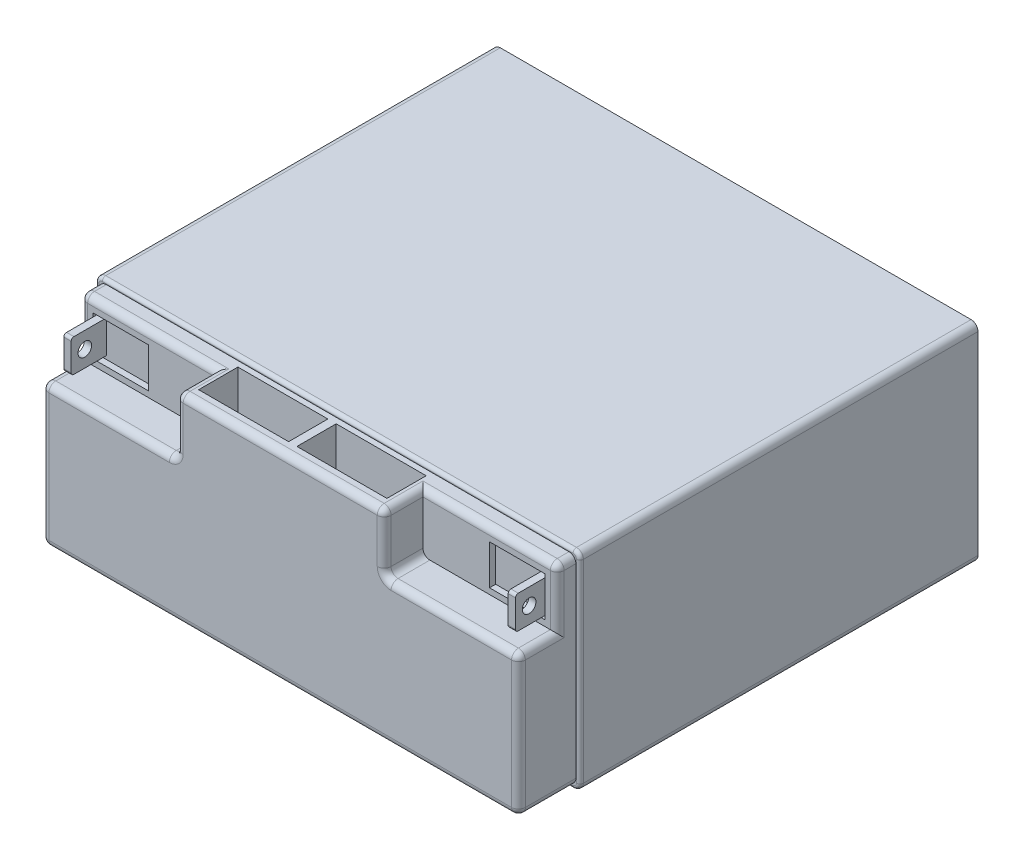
ISO-10303-21;
HEADER;
FILE_DESCRIPTION(('STEP AP214'),'2;1');
FILE_NAME('part.step','',(''),(''),'','','');
FILE_SCHEMA(('AUTOMOTIVE_DESIGN { 1 0 10303 214 1 1 1 1 }'));
ENDSEC;
DATA;
#1=APPLICATION_CONTEXT('core data for automotive mechanical design processes');
#2=APPLICATION_PROTOCOL_DEFINITION('international standard','automotive_design',2000,#1);
#3=PRODUCT_CONTEXT('',#1,'mechanical');
#4=PRODUCT('Part','Part','',(#3));
#5=PRODUCT_RELATED_PRODUCT_CATEGORY('part','',(#4));
#6=PRODUCT_DEFINITION_FORMATION('','',#4);
#7=PRODUCT_DEFINITION_CONTEXT('part definition',#1,'design');
#8=PRODUCT_DEFINITION('design','',#6,#7);
#9=PRODUCT_DEFINITION_SHAPE('','',#8);
#10=(LENGTH_UNIT() NAMED_UNIT(*) SI_UNIT(.MILLI.,.METRE.));
#11=(NAMED_UNIT(*) PLANE_ANGLE_UNIT() SI_UNIT($,.RADIAN.));
#12=(NAMED_UNIT(*) SI_UNIT($,.STERADIAN.) SOLID_ANGLE_UNIT());
#13=UNCERTAINTY_MEASURE_WITH_UNIT(LENGTH_MEASURE(1.E-05),#10,'distance_accuracy_value','');
#14=(GEOMETRIC_REPRESENTATION_CONTEXT(3) GLOBAL_UNCERTAINTY_ASSIGNED_CONTEXT((#13)) GLOBAL_UNIT_ASSIGNED_CONTEXT((#10,
#11,#12)) REPRESENTATION_CONTEXT('',''));
#15=CARTESIAN_POINT('',(0.,0.,0.));
#16=DIRECTION('',(0.,0.,1.));
#17=DIRECTION('',(1.,0.,0.));
#18=AXIS2_PLACEMENT_3D('',#15,#16,#17);
#19=CARTESIAN_POINT('',(143.209551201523,-8.82659600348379,152.908));
#20=DIRECTION('',(0.,0.,-1.));
#21=DIRECTION('',(-1.,0.,0.));
#22=AXIS2_PLACEMENT_3D('',#19,#20,#21);
#23=PLANE('',#22);
#24=DIRECTION('',(-1.,0.,0.));
#25=VECTOR('',#24,1.);
#26=CARTESIAN_POINT('',(143.209551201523,-8.82659600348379,152.908));
#27=LINE('',#26,#25);
#28=CARTESIAN_POINT('',(140.669551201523,-8.82659600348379,152.908));
#29=VERTEX_POINT('',#28);
#30=CARTESIAN_POINT('',(96.4735512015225,-8.82659600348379,152.908));
#31=VERTEX_POINT('',#30);
#32=EDGE_CURVE('E722',#29,#31,#27,.T.);
#33=ORIENTED_EDGE('',*,*,#32,.F.);
#34=DIRECTION('',(0.,1.,0.));
#35=VECTOR('',#34,1.);
#36=CARTESIAN_POINT('',(140.669551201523,-8.82659600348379,152.908));
#37=LINE('',#36,#35);
#38=CARTESIAN_POINT('',(140.669551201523,9.96940399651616,152.908));
#39=VERTEX_POINT('',#38);
#40=EDGE_CURVE('E854',#29,#39,#37,.T.);
#41=ORIENTED_EDGE('',*,*,#40,.T.);
#42=DIRECTION('',(-1.,0.,0.));
#43=VECTOR('',#42,1.);
#44=CARTESIAN_POINT('',(143.209551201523,9.96940399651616,152.908));
#45=LINE('',#44,#43);
#46=CARTESIAN_POINT('',(93.9335512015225,9.96940399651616,152.908));
#47=VERTEX_POINT('',#46);
#48=EDGE_CURVE('E852',#39,#47,#45,.T.);
#49=ORIENTED_EDGE('',*,*,#48,.T.);
#50=DIRECTION('',(0.,1.,0.));
#51=VECTOR('',#50,1.);
#52=CARTESIAN_POINT('',(93.9335512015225,-8.82659600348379,152.908));
#53=LINE('',#52,#51);
#54=CARTESIAN_POINT('',(93.9335512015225,-6.28659600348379,152.908));
#55=VERTEX_POINT('',#54);
#56=EDGE_CURVE('E725',#55,#47,#53,.T.);
#57=ORIENTED_EDGE('',*,*,#56,.F.);
#58=CARTESIAN_POINT('',(96.4735512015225,-6.28659600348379,152.908));
#59=DIRECTION('',(0.,0.,-1.));
#60=DIRECTION('',(-1.,0.,0.));
#61=AXIS2_PLACEMENT_3D('',#58,#59,#60);
#62=CIRCLE('',#61,2.54);
#63=EDGE_CURVE('E850',#55,#31,#62,.F.);
#64=ORIENTED_EDGE('',*,*,#63,.T.);
#65=EDGE_LOOP('',(#33,#41,#49,#57,#64));
#66=FACE_BOUND('',#65,.T.);
#67=DIRECTION('',(0.,1.,0.));
#68=VECTOR('',#67,1.);
#69=CARTESIAN_POINT('',(138.646478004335,6.63262311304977,152.908));
#70=LINE('',#69,#68);
#71=CARTESIAN_POINT('',(138.646478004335,-5.36737688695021,152.908));
#72=VERTEX_POINT('',#71);
#73=CARTESIAN_POINT('',(138.646478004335,6.63262311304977,152.908));
#74=VERTEX_POINT('',#73);
#75=EDGE_CURVE('E694',#72,#74,#70,.T.);
#76=ORIENTED_EDGE('',*,*,#75,.F.);
#77=DIRECTION('',(0.,1.,0.));
#78=VECTOR('',#77,1.);
#79=CARTESIAN_POINT('',(138.646478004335,-6.67758471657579,152.908));
#80=LINE('',#79,#78);
#81=CARTESIAN_POINT('',(138.646478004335,-6.67758471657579,152.908));
#82=VERTEX_POINT('',#81);
#83=EDGE_CURVE('E646',#82,#72,#80,.T.);
#84=ORIENTED_EDGE('',*,*,#83,.F.);
#85=DIRECTION('',(1.,0.,0.));
#86=VECTOR('',#85,1.);
#87=CARTESIAN_POINT('',(118.361039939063,-6.67758471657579,152.908));
#88=LINE('',#87,#86);
#89=CARTESIAN_POINT('',(118.361039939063,-6.67758471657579,152.908));
#90=VERTEX_POINT('',#89);
#91=EDGE_CURVE('E657',#90,#82,#88,.T.);
#92=ORIENTED_EDGE('',*,*,#91,.F.);
#93=DIRECTION('',(0.,-1.,0.));
#94=VECTOR('',#93,1.);
#95=CARTESIAN_POINT('',(118.361039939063,7.94283094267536,152.908));
#96=LINE('',#95,#94);
#97=CARTESIAN_POINT('',(118.361039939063,7.94283094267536,152.908));
#98=VERTEX_POINT('',#97);
#99=EDGE_CURVE('E687',#98,#90,#96,.T.);
#100=ORIENTED_EDGE('',*,*,#99,.F.);
#101=DIRECTION('',(-1.,0.,0.));
#102=VECTOR('',#101,1.);
#103=CARTESIAN_POINT('',(138.646478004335,7.94283094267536,152.908));
#104=LINE('',#103,#102);
#105=CARTESIAN_POINT('',(138.646478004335,7.94283094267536,152.908));
#106=VERTEX_POINT('',#105);
#107=EDGE_CURVE('E684',#106,#98,#104,.T.);
#108=ORIENTED_EDGE('',*,*,#107,.F.);
#109=DIRECTION('',(0.,1.,0.));
#110=VECTOR('',#109,1.);
#111=CARTESIAN_POINT('',(138.646478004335,6.63262311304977,152.908));
#112=LINE('',#111,#110);
#113=EDGE_CURVE('E681',#74,#106,#112,.T.);
#114=ORIENTED_EDGE('',*,*,#113,.F.);
#115=EDGE_LOOP('',(#76,#84,#92,#100,#108,#114));
#116=FACE_BOUND('',#115,.T.);
#117=ADVANCED_FACE('F36',(#66,#116),#23,.F.);
#118=CARTESIAN_POINT('',(17.6403117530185,12.5094039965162,152.908));
#119=DIRECTION('',(0.,0.,-1.));
#120=DIRECTION('',(-1.,0.,0.));
#121=AXIS2_PLACEMENT_3D('',#118,#119,#120);
#122=PLANE('',#121);
#123=DIRECTION('',(-1.,0.,0.));
#124=VECTOR('',#123,1.);
#125=CARTESIAN_POINT('',(17.6403117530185,9.96940399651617,152.908));
#126=LINE('',#125,#124);
#127=CARTESIAN_POINT('',(17.6403117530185,9.96940399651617,152.908));
#128=VERTEX_POINT('',#127);
#129=CARTESIAN_POINT('',(-29.0956882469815,9.96940399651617,152.908));
#130=VERTEX_POINT('',#129);
#131=EDGE_CURVE('E912',#128,#130,#126,.T.);
#132=ORIENTED_EDGE('',*,*,#131,.T.);
#133=DIRECTION('',(0.,-1.,0.));
#134=VECTOR('',#133,1.);
#135=CARTESIAN_POINT('',(-29.0956882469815,12.5094039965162,152.908));
#136=LINE('',#135,#134);
#137=CARTESIAN_POINT('',(-29.0956882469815,-8.82659600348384,152.908));
#138=VERTEX_POINT('',#137);
#139=EDGE_CURVE('E914',#130,#138,#136,.T.);
#140=ORIENTED_EDGE('',*,*,#139,.T.);
#141=DIRECTION('',(-1.,0.,0.));
#142=VECTOR('',#141,1.);
#143=CARTESIAN_POINT('',(17.6403117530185,-8.82659600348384,152.908));
#144=LINE('',#143,#142);
#145=CARTESIAN_POINT('',(15.1003117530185,-8.82659600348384,152.908));
#146=VERTEX_POINT('',#145);
#147=EDGE_CURVE('E801',#146,#138,#144,.T.);
#148=ORIENTED_EDGE('',*,*,#147,.F.);
#149=CARTESIAN_POINT('',(15.1003117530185,-6.28659600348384,152.908));
#150=DIRECTION('',(0.,0.,-1.));
#151=DIRECTION('',(-1.,0.,0.));
#152=AXIS2_PLACEMENT_3D('',#149,#150,#151);
#153=CIRCLE('',#152,2.54);
#154=CARTESIAN_POINT('',(17.6403117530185,-6.28659600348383,152.908));
#155=VERTEX_POINT('',#154);
#156=EDGE_CURVE('E910',#146,#155,#153,.F.);
#157=ORIENTED_EDGE('',*,*,#156,.T.);
#158=DIRECTION('',(0.,-1.,0.));
#159=VECTOR('',#158,1.);
#160=CARTESIAN_POINT('',(17.6403117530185,12.5094039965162,152.908));
#161=LINE('',#160,#159);
#162=EDGE_CURVE('E798',#128,#155,#161,.T.);
#163=ORIENTED_EDGE('',*,*,#162,.F.);
#164=EDGE_LOOP('',(#132,#140,#148,#157,#163));
#165=FACE_BOUND('',#164,.T.);
#166=DIRECTION('',(0.,-1.,0.));
#167=VECTOR('',#166,1.);
#168=CARTESIAN_POINT('',(-27.0726150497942,-5.36737688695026,152.908));
#169=LINE('',#168,#167);
#170=CARTESIAN_POINT('',(-27.0726150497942,6.63262311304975,152.908));
#171=VERTEX_POINT('',#170);
#172=CARTESIAN_POINT('',(-27.0726150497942,-5.36737688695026,152.908));
#173=VERTEX_POINT('',#172);
#174=EDGE_CURVE('E770',#171,#173,#169,.T.);
#175=ORIENTED_EDGE('',*,*,#174,.F.);
#176=DIRECTION('',(0.,-1.,0.));
#177=VECTOR('',#176,1.);
#178=CARTESIAN_POINT('',(-27.0726150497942,7.94283094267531,152.908));
#179=LINE('',#178,#177);
#180=CARTESIAN_POINT('',(-27.0726150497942,7.94283094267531,152.908));
#181=VERTEX_POINT('',#180);
#182=EDGE_CURVE('E728',#181,#171,#179,.T.);
#183=ORIENTED_EDGE('',*,*,#182,.F.);
#184=DIRECTION('',(-1.,0.,0.));
#185=VECTOR('',#184,1.);
#186=CARTESIAN_POINT('',(-6.78717698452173,7.94283094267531,152.908));
#187=LINE('',#186,#185);
#188=CARTESIAN_POINT('',(-6.78717698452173,7.94283094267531,152.908));
#189=VERTEX_POINT('',#188);
#190=EDGE_CURVE('E733',#189,#181,#187,.T.);
#191=ORIENTED_EDGE('',*,*,#190,.F.);
#192=DIRECTION('',(0.,1.,0.));
#193=VECTOR('',#192,1.);
#194=CARTESIAN_POINT('',(-6.78717698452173,-6.67758471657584,152.908));
#195=LINE('',#194,#193);
#196=CARTESIAN_POINT('',(-6.78717698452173,-6.67758471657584,152.908));
#197=VERTEX_POINT('',#196);
#198=EDGE_CURVE('E763',#197,#189,#195,.T.);
#199=ORIENTED_EDGE('',*,*,#198,.F.);
#200=DIRECTION('',(1.,0.,0.));
#201=VECTOR('',#200,1.);
#202=CARTESIAN_POINT('',(-27.0726150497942,-6.67758471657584,152.908));
#203=LINE('',#202,#201);
#204=CARTESIAN_POINT('',(-27.0726150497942,-6.67758471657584,152.908));
#205=VERTEX_POINT('',#204);
#206=EDGE_CURVE('E760',#205,#197,#203,.T.);
#207=ORIENTED_EDGE('',*,*,#206,.F.);
#208=DIRECTION('',(0.,-1.,0.));
#209=VECTOR('',#208,1.);
#210=CARTESIAN_POINT('',(-27.0726150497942,-5.36737688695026,152.908));
#211=LINE('',#210,#209);
#212=EDGE_CURVE('E757',#173,#205,#211,.T.);
#213=ORIENTED_EDGE('',*,*,#212,.F.);
#214=EDGE_LOOP('',(#175,#183,#191,#199,#207,#213));
#215=FACE_BOUND('',#214,.T.);
#216=ADVANCED_FACE('F1231',(#165,#215),#122,.F.);
#217=CARTESIAN_POINT('',(144.686931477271,13.9867842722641,146.05));
#218=DIRECTION('',(0.,0.,1.));
#219=DIRECTION('',(1.,0.,0.));
#220=AXIS2_PLACEMENT_3D('',#217,#218,#219);
#221=PLANE('',#220);
#222=CARTESIAN_POINT('',(-30.5730685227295,11.4467842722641,146.05));
#223=DIRECTION('',(0.,0.,1.));
#224=DIRECTION('',(1.,0.,0.));
#225=AXIS2_PLACEMENT_3D('',#222,#223,#224);
#226=CIRCLE('',#225,1.27);
#227=CARTESIAN_POINT('',(-30.5730685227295,12.7167842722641,146.05));
#228=VERTEX_POINT('',#227);
#229=CARTESIAN_POINT('',(-31.8430685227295,11.4467842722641,146.05));
#230=VERTEX_POINT('',#229);
#231=EDGE_CURVE('E1118',#228,#230,#226,.T.);
#232=ORIENTED_EDGE('',*,*,#231,.T.);
#233=DIRECTION('',(0.,-1.,0.));
#234=VECTOR('',#233,1.);
#235=CARTESIAN_POINT('',(-31.8430685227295,13.9867842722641,146.05));
#236=LINE('',#235,#234);
#237=CARTESIAN_POINT('',(-31.8430685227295,-59.6732157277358,146.05));
#238=VERTEX_POINT('',#237);
#239=EDGE_CURVE('E1120',#230,#238,#236,.T.);
#240=ORIENTED_EDGE('',*,*,#239,.T.);
#241=CARTESIAN_POINT('',(-30.5730685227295,-59.6732157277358,146.05));
#242=DIRECTION('',(0.,0.,1.));
#243=DIRECTION('',(1.,0.,0.));
#244=AXIS2_PLACEMENT_3D('',#241,#242,#243);
#245=CIRCLE('',#244,1.27);
#246=CARTESIAN_POINT('',(-30.5730685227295,-60.9432157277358,146.05));
#247=VERTEX_POINT('',#246);
#248=EDGE_CURVE('E1116',#238,#247,#245,.T.);
#249=ORIENTED_EDGE('',*,*,#248,.T.);
#250=DIRECTION('',(-1.,0.,0.));
#251=VECTOR('',#250,1.);
#252=CARTESIAN_POINT('',(144.686931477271,-60.9432157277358,146.05));
#253=LINE('',#252,#251);
#254=CARTESIAN_POINT('',(142.146931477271,-60.9432157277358,146.05));
#255=VERTEX_POINT('',#254);
#256=EDGE_CURVE('E1112',#247,#255,#253,.F.);
#257=ORIENTED_EDGE('',*,*,#256,.T.);
#258=CARTESIAN_POINT('',(142.146931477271,-59.6732157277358,146.05));
#259=DIRECTION('',(0.,0.,1.));
#260=DIRECTION('',(1.,0.,0.));
#261=AXIS2_PLACEMENT_3D('',#258,#259,#260);
#262=CIRCLE('',#261,1.27);
#263=CARTESIAN_POINT('',(143.416931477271,-59.6732157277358,146.05));
#264=VERTEX_POINT('',#263);
#265=EDGE_CURVE('E1108',#255,#264,#262,.T.);
#266=ORIENTED_EDGE('',*,*,#265,.T.);
#267=DIRECTION('',(0.,-1.,0.));
#268=VECTOR('',#267,1.);
#269=CARTESIAN_POINT('',(143.416931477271,13.9867842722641,146.05));
#270=LINE('',#269,#268);
#271=CARTESIAN_POINT('',(143.416931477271,11.4467842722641,146.05));
#272=VERTEX_POINT('',#271);
#273=EDGE_CURVE('E1106',#264,#272,#270,.F.);
#274=ORIENTED_EDGE('',*,*,#273,.T.);
#275=CARTESIAN_POINT('',(142.146931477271,11.4467842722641,146.05));
#276=DIRECTION('',(0.,0.,1.));
#277=DIRECTION('',(1.,0.,0.));
#278=AXIS2_PLACEMENT_3D('',#275,#276,#277);
#279=CIRCLE('',#278,1.27);
#280=CARTESIAN_POINT('',(142.146931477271,12.7167842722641,146.05));
#281=VERTEX_POINT('',#280);
#282=EDGE_CURVE('E1110',#272,#281,#279,.T.);
#283=ORIENTED_EDGE('',*,*,#282,.T.);
#284=DIRECTION('',(-1.,0.,0.));
#285=VECTOR('',#284,1.);
#286=CARTESIAN_POINT('',(-30.5730685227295,12.7167842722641,146.05));
#287=LINE('',#286,#285);
#288=EDGE_CURVE('E1114',#281,#228,#287,.T.);
#289=ORIENTED_EDGE('',*,*,#288,.T.);
#290=EDGE_LOOP('',(#232,#240,#249,#257,#266,#274,#283,#289));
#291=FACE_BOUND('',#290,.T.);
#292=DIRECTION('',(-1.,0.,0.));
#293=VECTOR('',#292,1.);
#294=CARTESIAN_POINT('',(-31.6356882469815,12.5094039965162,146.05));
#295=LINE('',#294,#293);
#296=CARTESIAN_POINT('',(140.669551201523,12.5094039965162,146.05));
#297=VERTEX_POINT('',#296);
#298=CARTESIAN_POINT('',(-29.0956882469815,12.5094039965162,146.05));
#299=VERTEX_POINT('',#298);
#300=EDGE_CURVE('E807',#297,#299,#295,.T.);
#301=ORIENTED_EDGE('',*,*,#300,.F.);
#302=CARTESIAN_POINT('',(140.669551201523,9.96940399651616,146.05));
#303=DIRECTION('',(0.,0.,1.));
#304=DIRECTION('',(1.,0.,0.));
#305=AXIS2_PLACEMENT_3D('',#302,#303,#304);
#306=CIRCLE('',#305,2.54);
#307=CARTESIAN_POINT('',(143.209551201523,9.96940399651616,146.05));
#308=VERTEX_POINT('',#307);
#309=EDGE_CURVE('E964',#297,#308,#306,.F.);
#310=ORIENTED_EDGE('',*,*,#309,.T.);
#311=DIRECTION('',(0.,1.,0.));
#312=VECTOR('',#311,1.);
#313=CARTESIAN_POINT('',(143.209551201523,12.5094039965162,146.05));
#314=LINE('',#313,#312);
#315=CARTESIAN_POINT('',(143.209551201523,-58.1958354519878,146.05));
#316=VERTEX_POINT('',#315);
#317=EDGE_CURVE('E804',#316,#308,#314,.T.);
#318=ORIENTED_EDGE('',*,*,#317,.F.);
#319=CARTESIAN_POINT('',(140.669551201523,-58.1958354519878,146.05));
#320=DIRECTION('',(0.,0.,1.));
#321=DIRECTION('',(1.,0.,0.));
#322=AXIS2_PLACEMENT_3D('',#319,#320,#321);
#323=CIRCLE('',#322,2.54);
#324=CARTESIAN_POINT('',(140.669551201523,-60.7358354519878,146.05));
#325=VERTEX_POINT('',#324);
#326=EDGE_CURVE('E962',#316,#325,#323,.F.);
#327=ORIENTED_EDGE('',*,*,#326,.T.);
#328=DIRECTION('',(1.,0.,0.));
#329=VECTOR('',#328,1.);
#330=CARTESIAN_POINT('',(143.209551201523,-60.7358354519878,146.05));
#331=LINE('',#330,#329);
#332=CARTESIAN_POINT('',(-29.0956882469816,-60.7358354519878,146.05));
#333=VERTEX_POINT('',#332);
#334=EDGE_CURVE('E813',#333,#325,#331,.T.);
#335=ORIENTED_EDGE('',*,*,#334,.F.);
#336=CARTESIAN_POINT('',(-29.0956882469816,-58.1958354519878,146.05));
#337=DIRECTION('',(0.,0.,1.));
#338=DIRECTION('',(1.,0.,0.));
#339=AXIS2_PLACEMENT_3D('',#336,#337,#338);
#340=CIRCLE('',#339,2.54);
#341=CARTESIAN_POINT('',(-31.6356882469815,-58.1958354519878,146.05));
#342=VERTEX_POINT('',#341);
#343=EDGE_CURVE('E966',#333,#342,#340,.F.);
#344=ORIENTED_EDGE('',*,*,#343,.T.);
#345=DIRECTION('',(0.,-1.,0.));
#346=VECTOR('',#345,1.);
#347=CARTESIAN_POINT('',(-31.6356882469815,-60.7358354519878,146.05));
#348=LINE('',#347,#346);
#349=CARTESIAN_POINT('',(-31.6356882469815,9.96940399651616,146.05));
#350=VERTEX_POINT('',#349);
#351=EDGE_CURVE('E810',#350,#342,#348,.T.);
#352=ORIENTED_EDGE('',*,*,#351,.F.);
#353=CARTESIAN_POINT('',(-29.0956882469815,9.96940399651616,146.05));
#354=DIRECTION('',(0.,0.,1.));
#355=DIRECTION('',(1.,0.,0.));
#356=AXIS2_PLACEMENT_3D('',#353,#354,#355);
#357=CIRCLE('',#356,2.54);
#358=EDGE_CURVE('E968',#350,#299,#357,.F.);
#359=ORIENTED_EDGE('',*,*,#358,.T.);
#360=EDGE_LOOP('',(#301,#310,#318,#327,#335,#344,#352,#359));
#361=FACE_BOUND('',#360,.T.);
#362=ADVANCED_FACE('F1204',(#291,#361),#221,.T.);
#363=CARTESIAN_POINT('',(-33.1130685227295,13.9867842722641,146.05));
#364=DIRECTION('',(-1.,0.,0.));
#365=DIRECTION('',(0.,0.,1.));
#366=AXIS2_PLACEMENT_3D('',#363,#364,#365);
#367=PLANE('',#366);
#368=DIRECTION('',(0.,0.,-1.));
#369=VECTOR('',#368,1.);
#370=CARTESIAN_POINT('',(-33.1130685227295,-59.6732157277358,146.05));
#371=LINE('',#370,#369);
#372=CARTESIAN_POINT('',(-33.1130685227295,-59.6732157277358,0.));
#373=VERTEX_POINT('',#372);
#374=CARTESIAN_POINT('',(-33.1130685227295,-59.6732157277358,144.78));
#375=VERTEX_POINT('',#374);
#376=EDGE_CURVE('E935',#373,#375,#371,.F.);
#377=ORIENTED_EDGE('',*,*,#376,.T.);
#378=DIRECTION('',(0.,-1.,0.));
#379=VECTOR('',#378,1.);
#380=CARTESIAN_POINT('',(-33.1130685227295,13.9867842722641,144.78));
#381=LINE('',#380,#379);
#382=CARTESIAN_POINT('',(-33.1130685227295,11.4467842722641,144.78));
#383=VERTEX_POINT('',#382);
#384=EDGE_CURVE('E1123',#375,#383,#381,.F.);
#385=ORIENTED_EDGE('',*,*,#384,.T.);
#386=DIRECTION('',(0.,0.,-1.));
#387=VECTOR('',#386,1.);
#388=CARTESIAN_POINT('',(-33.1130685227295,11.4467842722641,0.));
#389=LINE('',#388,#387);
#390=CARTESIAN_POINT('',(-33.1130685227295,11.4467842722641,0.));
#391=VERTEX_POINT('',#390);
#392=EDGE_CURVE('E938',#383,#391,#389,.T.);
#393=ORIENTED_EDGE('',*,*,#392,.T.);
#394=DIRECTION('',(0.,-1.,0.));
#395=VECTOR('',#394,1.);
#396=CARTESIAN_POINT('',(-33.1130685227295,13.9867842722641,0.));
#397=LINE('',#396,#395);
#398=EDGE_CURVE('E820',#391,#373,#397,.T.);
#399=ORIENTED_EDGE('',*,*,#398,.T.);
#400=EDGE_LOOP('',(#377,#385,#393,#399));
#401=FACE_BOUND('',#400,.T.);
#402=ADVANCED_FACE('F1220',(#401),#367,.T.);
#403=CARTESIAN_POINT('',(144.686931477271,13.9867842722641,0.));
#404=DIRECTION('',(1.,0.,0.));
#405=DIRECTION('',(0.,0.,-1.));
#406=AXIS2_PLACEMENT_3D('',#403,#404,#405);
#407=PLANE('',#406);
#408=DIRECTION('',(0.,0.,1.));
#409=VECTOR('',#408,1.);
#410=CARTESIAN_POINT('',(144.686931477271,11.4467842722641,146.05));
#411=LINE('',#410,#409);
#412=CARTESIAN_POINT('',(144.686931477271,11.4467842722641,0.));
#413=VERTEX_POINT('',#412);
#414=CARTESIAN_POINT('',(144.686931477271,11.4467842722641,144.78));
#415=VERTEX_POINT('',#414);
#416=EDGE_CURVE('E958',#413,#415,#411,.T.);
#417=ORIENTED_EDGE('',*,*,#416,.T.);
#418=DIRECTION('',(0.,-1.,0.));
#419=VECTOR('',#418,1.);
#420=CARTESIAN_POINT('',(144.686931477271,13.9867842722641,144.78));
#421=LINE('',#420,#419);
#422=CARTESIAN_POINT('',(144.686931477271,-59.6732157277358,144.78));
#423=VERTEX_POINT('',#422);
#424=EDGE_CURVE('E11',#415,#423,#421,.T.);
#425=ORIENTED_EDGE('',*,*,#424,.T.);
#426=DIRECTION('',(0.,0.,1.));
#427=VECTOR('',#426,1.);
#428=CARTESIAN_POINT('',(144.686931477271,-59.6732157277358,0.));
#429=LINE('',#428,#427);
#430=CARTESIAN_POINT('',(144.686931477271,-59.6732157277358,0.));
#431=VERTEX_POINT('',#430);
#432=EDGE_CURVE('E960',#423,#431,#429,.F.);
#433=ORIENTED_EDGE('',*,*,#432,.T.);
#434=DIRECTION('',(0.,-1.,0.));
#435=VECTOR('',#434,1.);
#436=CARTESIAN_POINT('',(144.686931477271,13.9867842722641,0.));
#437=LINE('',#436,#435);
#438=EDGE_CURVE('E823',#413,#431,#437,.T.);
#439=ORIENTED_EDGE('',*,*,#438,.F.);
#440=EDGE_LOOP('',(#417,#425,#433,#439));
#441=FACE_BOUND('',#440,.T.);
#442=ADVANCED_FACE('F1182',(#441),#407,.T.);
#443=CARTESIAN_POINT('',(-33.1130685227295,13.9867842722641,0.));
#444=DIRECTION('',(0.,0.,-1.));
#445=DIRECTION('',(-1.,0.,0.));
#446=AXIS2_PLACEMENT_3D('',#443,#444,#445);
#447=PLANE('',#446);
#448=ORIENTED_EDGE('',*,*,#398,.F.);
#449=CARTESIAN_POINT('',(-30.5730685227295,11.4467842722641,0.));
#450=DIRECTION('',(0.,0.,-1.));
#451=DIRECTION('',(-1.,0.,0.));
#452=AXIS2_PLACEMENT_3D('',#449,#450,#451);
#453=CIRCLE('',#452,2.54);
#454=CARTESIAN_POINT('',(-30.5730685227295,13.9867842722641,0.));
#455=VERTEX_POINT('',#454);
#456=EDGE_CURVE('E946',#391,#455,#453,.T.);
#457=ORIENTED_EDGE('',*,*,#456,.T.);
#458=DIRECTION('',(1.,0.,0.));
#459=VECTOR('',#458,1.);
#460=CARTESIAN_POINT('',(-33.1130685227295,13.9867842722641,0.));
#461=LINE('',#460,#459);
#462=CARTESIAN_POINT('',(142.14693147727,13.9867842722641,0.));
#463=VERTEX_POINT('',#462);
#464=EDGE_CURVE('E817',#455,#463,#461,.T.);
#465=ORIENTED_EDGE('',*,*,#464,.T.);
#466=CARTESIAN_POINT('',(142.146931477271,11.4467842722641,0.));
#467=DIRECTION('',(0.,0.,-1.));
#468=DIRECTION('',(-1.,0.,0.));
#469=AXIS2_PLACEMENT_3D('',#466,#467,#468);
#470=CIRCLE('',#469,2.54);
#471=EDGE_CURVE('E940',#463,#413,#470,.T.);
#472=ORIENTED_EDGE('',*,*,#471,.T.);
#473=ORIENTED_EDGE('',*,*,#438,.T.);
#474=CARTESIAN_POINT('',(142.146931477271,-59.6732157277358,0.));
#475=DIRECTION('',(0.,0.,-1.));
#476=DIRECTION('',(-1.,0.,0.));
#477=AXIS2_PLACEMENT_3D('',#474,#475,#476);
#478=CIRCLE('',#477,2.54);
#479=CARTESIAN_POINT('',(142.14693147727,-62.2132157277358,0.));
#480=VERTEX_POINT('',#479);
#481=EDGE_CURVE('E944',#431,#480,#478,.T.);
#482=ORIENTED_EDGE('',*,*,#481,.T.);
#483=DIRECTION('',(1.,0.,0.));
#484=VECTOR('',#483,1.);
#485=CARTESIAN_POINT('',(-33.1130685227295,-62.2132157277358,0.));
#486=LINE('',#485,#484);
#487=CARTESIAN_POINT('',(-30.5730685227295,-62.2132157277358,0.));
#488=VERTEX_POINT('',#487);
#489=EDGE_CURVE('E816',#488,#480,#486,.T.);
#490=ORIENTED_EDGE('',*,*,#489,.F.);
#491=CARTESIAN_POINT('',(-30.5730685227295,-59.6732157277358,0.));
#492=DIRECTION('',(0.,0.,-1.));
#493=DIRECTION('',(-1.,0.,0.));
#494=AXIS2_PLACEMENT_3D('',#491,#492,#493);
#495=CIRCLE('',#494,2.54);
#496=EDGE_CURVE('E942',#488,#373,#495,.T.);
#497=ORIENTED_EDGE('',*,*,#496,.T.);
#498=EDGE_LOOP('',(#448,#457,#465,#472,#473,#482,#490,#497));
#499=FACE_BOUND('',#498,.T.);
#500=ADVANCED_FACE('F1179',(#499),#447,.T.);
#501=CARTESIAN_POINT('',(-33.1130685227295,13.9867842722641,0.));
#502=DIRECTION('',(0.,-1.,0.));
#503=DIRECTION('',(0.,0.,-1.));
#504=AXIS2_PLACEMENT_3D('',#501,#502,#503);
#505=PLANE('',#504);
#506=DIRECTION('',(0.,0.,-1.));
#507=VECTOR('',#506,1.);
#508=CARTESIAN_POINT('',(-30.5730685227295,13.9867842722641,146.05));
#509=LINE('',#508,#507);
#510=CARTESIAN_POINT('',(-30.5730685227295,13.9867842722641,144.78));
#511=VERTEX_POINT('',#510);
#512=EDGE_CURVE('E950',#455,#511,#509,.F.);
#513=ORIENTED_EDGE('',*,*,#512,.T.);
#514=DIRECTION('',(-1.,0.,0.));
#515=VECTOR('',#514,1.);
#516=CARTESIAN_POINT('',(142.146931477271,13.9867842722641,144.78));
#517=LINE('',#516,#515);
#518=CARTESIAN_POINT('',(142.146931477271,13.9867842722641,144.78));
#519=VERTEX_POINT('',#518);
#520=EDGE_CURVE('E1130',#511,#519,#517,.F.);
#521=ORIENTED_EDGE('',*,*,#520,.T.);
#522=DIRECTION('',(0.,0.,1.));
#523=VECTOR('',#522,1.);
#524=CARTESIAN_POINT('',(142.146931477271,13.9867842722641,0.));
#525=LINE('',#524,#523);
#526=EDGE_CURVE('E948',#519,#463,#525,.F.);
#527=ORIENTED_EDGE('',*,*,#526,.T.);
#528=ORIENTED_EDGE('',*,*,#464,.F.);
#529=EDGE_LOOP('',(#513,#521,#527,#528));
#530=FACE_BOUND('',#529,.T.);
#531=ADVANCED_FACE('F1186',(#530),#505,.F.);
#532=CARTESIAN_POINT('',(-33.1130685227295,-62.2132157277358,0.));
#533=DIRECTION('',(0.,-1.,0.));
#534=DIRECTION('',(0.,0.,-1.));
#535=AXIS2_PLACEMENT_3D('',#532,#533,#534);
#536=PLANE('',#535);
#537=DIRECTION('',(0.,0.,1.));
#538=VECTOR('',#537,1.);
#539=CARTESIAN_POINT('',(142.146931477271,-62.2132157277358,0.));
#540=LINE('',#539,#538);
#541=CARTESIAN_POINT('',(142.146931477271,-62.2132157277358,144.78));
#542=VERTEX_POINT('',#541);
#543=EDGE_CURVE('E955',#480,#542,#540,.T.);
#544=ORIENTED_EDGE('',*,*,#543,.T.);
#545=DIRECTION('',(-1.,0.,0.));
#546=VECTOR('',#545,1.);
#547=CARTESIAN_POINT('',(-33.1130685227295,-62.2132157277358,144.78));
#548=LINE('',#547,#546);
#549=CARTESIAN_POINT('',(-30.5730685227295,-62.2132157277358,144.78));
#550=VERTEX_POINT('',#549);
#551=EDGE_CURVE('E1132',#542,#550,#548,.T.);
#552=ORIENTED_EDGE('',*,*,#551,.T.);
#553=DIRECTION('',(0.,0.,-1.));
#554=VECTOR('',#553,1.);
#555=CARTESIAN_POINT('',(-30.5730685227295,-62.2132157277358,0.));
#556=LINE('',#555,#554);
#557=EDGE_CURVE('E953',#550,#488,#556,.T.);
#558=ORIENTED_EDGE('',*,*,#557,.T.);
#559=ORIENTED_EDGE('',*,*,#489,.T.);
#560=EDGE_LOOP('',(#544,#552,#558,#559));
#561=FACE_BOUND('',#560,.T.);
#562=ADVANCED_FACE('F1173',(#561),#536,.T.);
#563=CARTESIAN_POINT('',(143.209551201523,12.5094039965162,167.132));
#564=DIRECTION('',(-1.,0.,0.));
#565=DIRECTION('',(0.,0.,1.));
#566=AXIS2_PLACEMENT_3D('',#563,#564,#565);
#567=PLANE('',#566);
#568=ORIENTED_EDGE('',*,*,#317,.T.);
#569=DIRECTION('',(0.,0.,-1.));
#570=VECTOR('',#569,1.);
#571=CARTESIAN_POINT('',(143.209551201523,9.96940399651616,167.132));
#572=LINE('',#571,#570);
#573=CARTESIAN_POINT('',(143.209551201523,9.96940399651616,150.368));
#574=VERTEX_POINT('',#573);
#575=EDGE_CURVE('E842',#308,#574,#572,.F.);
#576=ORIENTED_EDGE('',*,*,#575,.T.);
#577=DIRECTION('',(0.,1.,0.));
#578=VECTOR('',#577,1.);
#579=CARTESIAN_POINT('',(143.209551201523,12.5094039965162,150.368));
#580=LINE('',#579,#578);
#581=CARTESIAN_POINT('',(143.209551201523,-11.3665960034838,150.368));
#582=VERTEX_POINT('',#581);
#583=EDGE_CURVE('E837',#574,#582,#580,.F.);
#584=ORIENTED_EDGE('',*,*,#583,.T.);
#585=DIRECTION('',(0.,0.,-1.));
#586=VECTOR('',#585,1.);
#587=CARTESIAN_POINT('',(143.209551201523,-11.3665960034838,167.132));
#588=LINE('',#587,#586);
#589=CARTESIAN_POINT('',(143.209551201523,-11.3665960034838,164.592));
#590=VERTEX_POINT('',#589);
#591=EDGE_CURVE('E826',#582,#590,#588,.F.);
#592=ORIENTED_EDGE('',*,*,#591,.T.);
#593=DIRECTION('',(0.,1.,0.));
#594=VECTOR('',#593,1.);
#595=CARTESIAN_POINT('',(143.209551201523,12.5094039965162,164.592));
#596=LINE('',#595,#594);
#597=CARTESIAN_POINT('',(143.209551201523,-58.1958354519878,164.592));
#598=VERTEX_POINT('',#597);
#599=EDGE_CURVE('E835',#590,#598,#596,.F.);
#600=ORIENTED_EDGE('',*,*,#599,.T.);
#601=DIRECTION('',(0.,0.,-1.));
#602=VECTOR('',#601,1.);
#603=CARTESIAN_POINT('',(143.209551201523,-58.1958354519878,167.132));
#604=LINE('',#603,#602);
#605=EDGE_CURVE('E839',#598,#316,#604,.T.);
#606=ORIENTED_EDGE('',*,*,#605,.T.);
#607=EDGE_LOOP('',(#568,#576,#584,#592,#600,#606));
#608=FACE_BOUND('',#607,.T.);
#609=ADVANCED_FACE('F1312',(#608),#567,.F.);
#610=CARTESIAN_POINT('',(-31.6356882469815,12.5094039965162,167.132));
#611=DIRECTION('',(0.,-1.,0.));
#612=DIRECTION('',(1.,0.,0.));
#613=AXIS2_PLACEMENT_3D('',#610,#611,#612);
#614=PLANE('',#613);
#615=DIRECTION('',(-1.,0.,0.));
#616=VECTOR('',#615,1.);
#617=CARTESIAN_POINT('',(54.2629314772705,12.5094039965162,148.113824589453));
#618=LINE('',#617,#616);
#619=CARTESIAN_POINT('',(54.2629314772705,12.5094039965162,148.113824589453));
#620=VERTEX_POINT('',#619);
#621=CARTESIAN_POINT('',(21.2429314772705,12.5094039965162,148.113824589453));
#622=VERTEX_POINT('',#621);
#623=EDGE_CURVE('E604',#620,#622,#618,.T.);
#624=ORIENTED_EDGE('',*,*,#623,.F.);
#625=DIRECTION('',(0.,0.,-1.));
#626=VECTOR('',#625,1.);
#627=CARTESIAN_POINT('',(54.2629314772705,12.5094039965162,162.513476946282));
#628=LINE('',#627,#626);
#629=CARTESIAN_POINT('',(54.2629314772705,12.5094039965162,162.513476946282));
#630=VERTEX_POINT('',#629);
#631=EDGE_CURVE('E582',#630,#620,#628,.T.);
#632=ORIENTED_EDGE('',*,*,#631,.F.);
#633=DIRECTION('',(1.,0.,0.));
#634=VECTOR('',#633,1.);
#635=CARTESIAN_POINT('',(21.2429314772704,12.5094039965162,162.513476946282));
#636=LINE('',#635,#634);
#637=CARTESIAN_POINT('',(21.2429314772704,12.5094039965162,162.513476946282));
#638=VERTEX_POINT('',#637);
#639=EDGE_CURVE('E593',#638,#630,#636,.T.);
#640=ORIENTED_EDGE('',*,*,#639,.F.);
#641=DIRECTION('',(0.,0.,1.));
#642=VECTOR('',#641,1.);
#643=CARTESIAN_POINT('',(21.2429314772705,12.5094039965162,148.113824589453));
#644=LINE('',#643,#642);
#645=EDGE_CURVE('E607',#622,#638,#644,.T.);
#646=ORIENTED_EDGE('',*,*,#645,.F.);
#647=EDGE_LOOP('',(#624,#632,#640,#646));
#648=FACE_BOUND('',#647,.T.);
#649=DIRECTION('',(-1.,0.,0.));
#650=VECTOR('',#649,1.);
#651=CARTESIAN_POINT('',(90.3309314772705,12.5094039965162,148.113824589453));
#652=LINE('',#651,#650);
#653=CARTESIAN_POINT('',(90.3309314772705,12.5094039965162,148.113824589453));
#654=VERTEX_POINT('',#653);
#655=CARTESIAN_POINT('',(57.3109314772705,12.5094039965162,148.113824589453));
#656=VERTEX_POINT('',#655);
#657=EDGE_CURVE('E636',#654,#656,#652,.T.);
#658=ORIENTED_EDGE('',*,*,#657,.F.);
#659=DIRECTION('',(0.,0.,-1.));
#660=VECTOR('',#659,1.);
#661=CARTESIAN_POINT('',(90.3309314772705,12.5094039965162,162.513476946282));
#662=LINE('',#661,#660);
#663=CARTESIAN_POINT('',(90.3309314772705,12.5094039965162,162.513476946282));
#664=VERTEX_POINT('',#663);
#665=EDGE_CURVE('E614',#664,#654,#662,.T.);
#666=ORIENTED_EDGE('',*,*,#665,.F.);
#667=DIRECTION('',(1.,0.,0.));
#668=VECTOR('',#667,1.);
#669=CARTESIAN_POINT('',(57.3109314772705,12.5094039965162,162.513476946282));
#670=LINE('',#669,#668);
#671=CARTESIAN_POINT('',(57.3109314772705,12.5094039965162,162.513476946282));
#672=VERTEX_POINT('',#671);
#673=EDGE_CURVE('E625',#672,#664,#670,.T.);
#674=ORIENTED_EDGE('',*,*,#673,.F.);
#675=DIRECTION('',(0.,0.,1.));
#676=VECTOR('',#675,1.);
#677=CARTESIAN_POINT('',(57.3109314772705,12.5094039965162,148.113824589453));
#678=LINE('',#677,#676);
#679=EDGE_CURVE('E639',#656,#672,#678,.T.);
#680=ORIENTED_EDGE('',*,*,#679,.F.);
#681=EDGE_LOOP('',(#658,#666,#674,#680));
#682=FACE_BOUND('',#681,.T.);
#683=DIRECTION('',(-1.,0.,0.));
#684=VECTOR('',#683,1.);
#685=CARTESIAN_POINT('',(-31.6356882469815,12.5094039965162,150.368));
#686=LINE('',#685,#684);
#687=CARTESIAN_POINT('',(91.3935512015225,12.5094039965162,150.368));
#688=VERTEX_POINT('',#687);
#689=CARTESIAN_POINT('',(140.669551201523,12.5094039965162,150.368));
#690=VERTEX_POINT('',#689);
#691=EDGE_CURVE('E867',#688,#690,#686,.F.);
#692=ORIENTED_EDGE('',*,*,#691,.T.);
#693=DIRECTION('',(0.,0.,-1.));
#694=VECTOR('',#693,1.);
#695=CARTESIAN_POINT('',(140.669551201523,12.5094039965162,167.132));
#696=LINE('',#695,#694);
#697=EDGE_CURVE('E869',#690,#297,#696,.T.);
#698=ORIENTED_EDGE('',*,*,#697,.T.);
#699=ORIENTED_EDGE('',*,*,#300,.T.);
#700=DIRECTION('',(0.,0.,-1.));
#701=VECTOR('',#700,1.);
#702=CARTESIAN_POINT('',(-29.0956882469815,12.5094039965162,167.132));
#703=LINE('',#702,#701);
#704=CARTESIAN_POINT('',(-29.0956882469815,12.5094039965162,150.368));
#705=VERTEX_POINT('',#704);
#706=EDGE_CURVE('E865',#299,#705,#703,.F.);
#707=ORIENTED_EDGE('',*,*,#706,.T.);
#708=DIRECTION('',(-1.,0.,0.));
#709=VECTOR('',#708,1.);
#710=CARTESIAN_POINT('',(-31.6356882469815,12.5094039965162,150.368));
#711=LINE('',#710,#709);
#712=CARTESIAN_POINT('',(20.1803117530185,12.5094039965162,150.368));
#713=VERTEX_POINT('',#712);
#714=EDGE_CURVE('E861',#705,#713,#711,.F.);
#715=ORIENTED_EDGE('',*,*,#714,.T.);
#716=DIRECTION('',(0.,0.,-1.));
#717=VECTOR('',#716,1.);
#718=CARTESIAN_POINT('',(20.1803117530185,12.5094039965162,167.132));
#719=LINE('',#718,#717);
#720=CARTESIAN_POINT('',(20.1803117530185,12.5094039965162,164.592));
#721=VERTEX_POINT('',#720);
#722=EDGE_CURVE('E857',#713,#721,#719,.F.);
#723=ORIENTED_EDGE('',*,*,#722,.T.);
#724=DIRECTION('',(-1.,0.,0.));
#725=VECTOR('',#724,1.);
#726=CARTESIAN_POINT('',(-31.6356882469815,12.5094039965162,164.592));
#727=LINE('',#726,#725);
#728=CARTESIAN_POINT('',(91.3935512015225,12.5094039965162,164.592));
#729=VERTEX_POINT('',#728);
#730=EDGE_CURVE('E859',#721,#729,#727,.F.);
#731=ORIENTED_EDGE('',*,*,#730,.T.);
#732=DIRECTION('',(0.,0.,1.));
#733=VECTOR('',#732,1.);
#734=CARTESIAN_POINT('',(91.3935512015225,12.5094039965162,167.132));
#735=LINE('',#734,#733);
#736=EDGE_CURVE('E863',#729,#688,#735,.F.);
#737=ORIENTED_EDGE('',*,*,#736,.T.);
#738=EDGE_LOOP('',(#692,#698,#699,#707,#715,#723,#731,#737));
#739=FACE_BOUND('',#738,.T.);
#740=ADVANCED_FACE('F1308',(#648,#682,#739),#614,.F.);
#741=CARTESIAN_POINT('',(-31.6356882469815,-60.7358354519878,167.132));
#742=DIRECTION('',(1.,0.,0.));
#743=DIRECTION('',(0.,0.,-1.));
#744=AXIS2_PLACEMENT_3D('',#741,#742,#743);
#745=PLANE('',#744);
#746=ORIENTED_EDGE('',*,*,#351,.T.);
#747=DIRECTION('',(0.,0.,-1.));
#748=VECTOR('',#747,1.);
#749=CARTESIAN_POINT('',(-31.6356882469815,-58.1958354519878,167.132));
#750=LINE('',#749,#748);
#751=CARTESIAN_POINT('',(-31.6356882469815,-58.1958354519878,164.592));
#752=VERTEX_POINT('',#751);
#753=EDGE_CURVE('E879',#342,#752,#750,.F.);
#754=ORIENTED_EDGE('',*,*,#753,.T.);
#755=DIRECTION('',(0.,-1.,0.));
#756=VECTOR('',#755,1.);
#757=CARTESIAN_POINT('',(-31.6356882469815,-60.7358354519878,164.592));
#758=LINE('',#757,#756);
#759=CARTESIAN_POINT('',(-31.6356882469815,-11.3665960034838,164.592));
#760=VERTEX_POINT('',#759);
#761=EDGE_CURVE('E871',#752,#760,#758,.F.);
#762=ORIENTED_EDGE('',*,*,#761,.T.);
#763=DIRECTION('',(0.,0.,1.));
#764=VECTOR('',#763,1.);
#765=CARTESIAN_POINT('',(-31.6356882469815,-11.3665960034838,167.132));
#766=LINE('',#765,#764);
#767=CARTESIAN_POINT('',(-31.6356882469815,-11.3665960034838,150.368));
#768=VERTEX_POINT('',#767);
#769=EDGE_CURVE('E873',#760,#768,#766,.F.);
#770=ORIENTED_EDGE('',*,*,#769,.T.);
#771=DIRECTION('',(0.,-1.,0.));
#772=VECTOR('',#771,1.);
#773=CARTESIAN_POINT('',(-31.6356882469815,-60.7358354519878,150.368));
#774=LINE('',#773,#772);
#775=CARTESIAN_POINT('',(-31.6356882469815,9.96940399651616,150.368));
#776=VERTEX_POINT('',#775);
#777=EDGE_CURVE('E875',#768,#776,#774,.F.);
#778=ORIENTED_EDGE('',*,*,#777,.T.);
#779=DIRECTION('',(0.,0.,-1.));
#780=VECTOR('',#779,1.);
#781=CARTESIAN_POINT('',(-31.6356882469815,9.96940399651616,167.132));
#782=LINE('',#781,#780);
#783=EDGE_CURVE('E877',#776,#350,#782,.T.);
#784=ORIENTED_EDGE('',*,*,#783,.T.);
#785=EDGE_LOOP('',(#746,#754,#762,#770,#778,#784));
#786=FACE_BOUND('',#785,.T.);
#787=ADVANCED_FACE('F1304',(#786),#745,.F.);
#788=CARTESIAN_POINT('',(143.209551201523,-60.7358354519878,167.132));
#789=DIRECTION('',(0.,1.,0.));
#790=DIRECTION('',(0.,0.,1.));
#791=AXIS2_PLACEMENT_3D('',#788,#789,#790);
#792=PLANE('',#791);
#793=ORIENTED_EDGE('',*,*,#334,.T.);
#794=DIRECTION('',(0.,0.,-1.));
#795=VECTOR('',#794,1.);
#796=CARTESIAN_POINT('',(140.669551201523,-60.7358354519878,167.132));
#797=LINE('',#796,#795);
#798=CARTESIAN_POINT('',(140.669551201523,-60.7358354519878,164.592));
#799=VERTEX_POINT('',#798);
#800=EDGE_CURVE('E848',#325,#799,#797,.F.);
#801=ORIENTED_EDGE('',*,*,#800,.T.);
#802=DIRECTION('',(1.,0.,0.));
#803=VECTOR('',#802,1.);
#804=CARTESIAN_POINT('',(143.209551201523,-60.7358354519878,164.592));
#805=LINE('',#804,#803);
#806=CARTESIAN_POINT('',(-29.0956882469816,-60.7358354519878,164.592));
#807=VERTEX_POINT('',#806);
#808=EDGE_CURVE('E844',#799,#807,#805,.F.);
#809=ORIENTED_EDGE('',*,*,#808,.T.);
#810=DIRECTION('',(0.,0.,-1.));
#811=VECTOR('',#810,1.);
#812=CARTESIAN_POINT('',(-29.0956882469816,-60.7358354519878,167.132));
#813=LINE('',#812,#811);
#814=EDGE_CURVE('E846',#807,#333,#813,.T.);
#815=ORIENTED_EDGE('',*,*,#814,.T.);
#816=EDGE_LOOP('',(#793,#801,#809,#815));
#817=FACE_BOUND('',#816,.T.);
#818=DIRECTION('',(0.,0.,-1.));
#819=VECTOR('',#818,1.);
#820=CARTESIAN_POINT('',(-8.77568824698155,-60.7358354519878,162.843381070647));
#821=LINE('',#820,#819);
#822=CARTESIAN_POINT('',(-8.77568824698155,-60.7358354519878,162.843381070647));
#823=VERTEX_POINT('',#822);
#824=CARTESIAN_POINT('',(-8.77568824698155,-60.7358354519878,147.642096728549));
#825=VERTEX_POINT('',#824);
#826=EDGE_CURVE('E547',#823,#825,#821,.T.);
#827=ORIENTED_EDGE('',*,*,#826,.F.);
#828=DIRECTION('',(-1.,0.,0.));
#829=VECTOR('',#828,1.);
#830=CARTESIAN_POINT('',(54.7243117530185,-60.7358354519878,162.843381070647));
#831=LINE('',#830,#829);
#832=CARTESIAN_POINT('',(54.7243117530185,-60.7358354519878,162.843381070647));
#833=VERTEX_POINT('',#832);
#834=EDGE_CURVE('E518',#833,#823,#831,.T.);
#835=ORIENTED_EDGE('',*,*,#834,.F.);
#836=DIRECTION('',(0.,0.,1.));
#837=VECTOR('',#836,1.);
#838=CARTESIAN_POINT('',(54.7243117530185,-60.7358354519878,147.642096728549));
#839=LINE('',#838,#837);
#840=CARTESIAN_POINT('',(54.7243117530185,-60.7358354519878,147.642096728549));
#841=VERTEX_POINT('',#840);
#842=EDGE_CURVE('E535',#841,#833,#839,.T.);
#843=ORIENTED_EDGE('',*,*,#842,.F.);
#844=DIRECTION('',(1.,0.,0.));
#845=VECTOR('',#844,1.);
#846=CARTESIAN_POINT('',(-8.77568824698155,-60.7358354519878,147.642096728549));
#847=LINE('',#846,#845);
#848=EDGE_CURVE('E538',#825,#841,#847,.T.);
#849=ORIENTED_EDGE('',*,*,#848,.F.);
#850=EDGE_LOOP('',(#827,#835,#843,#849));
#851=FACE_BOUND('',#850,.T.);
#852=DIRECTION('',(0.,0.,-1.));
#853=VECTOR('',#852,1.);
#854=CARTESIAN_POINT('',(56.8495512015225,-60.7358354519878,162.843381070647));
#855=LINE('',#854,#853);
#856=CARTESIAN_POINT('',(56.8495512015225,-60.7358354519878,162.843381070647));
#857=VERTEX_POINT('',#856);
#858=CARTESIAN_POINT('',(56.8495512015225,-60.7358354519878,147.642096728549));
#859=VERTEX_POINT('',#858);
#860=EDGE_CURVE('E572',#857,#859,#855,.T.);
#861=ORIENTED_EDGE('',*,*,#860,.F.);
#862=DIRECTION('',(-1.,0.,0.));
#863=VECTOR('',#862,1.);
#864=CARTESIAN_POINT('',(120.349551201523,-60.7358354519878,162.843381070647));
#865=LINE('',#864,#863);
#866=CARTESIAN_POINT('',(120.349551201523,-60.7358354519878,162.843381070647));
#867=VERTEX_POINT('',#866);
#868=EDGE_CURVE('E553',#867,#857,#865,.T.);
#869=ORIENTED_EDGE('',*,*,#868,.F.);
#870=DIRECTION('',(0.,0.,1.));
#871=VECTOR('',#870,1.);
#872=CARTESIAN_POINT('',(120.349551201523,-60.7358354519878,147.642096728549));
#873=LINE('',#872,#871);
#874=CARTESIAN_POINT('',(120.349551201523,-60.7358354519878,147.642096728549));
#875=VERTEX_POINT('',#874);
#876=EDGE_CURVE('E561',#875,#867,#873,.T.);
#877=ORIENTED_EDGE('',*,*,#876,.F.);
#878=DIRECTION('',(1.,0.,0.));
#879=VECTOR('',#878,1.);
#880=CARTESIAN_POINT('',(56.8495512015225,-60.7358354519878,147.642096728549));
#881=LINE('',#880,#879);
#882=EDGE_CURVE('E575',#859,#875,#881,.T.);
#883=ORIENTED_EDGE('',*,*,#882,.F.);
#884=EDGE_LOOP('',(#861,#869,#877,#883));
#885=FACE_BOUND('',#884,.T.);
#886=ADVANCED_FACE('F1300',(#817,#851,#885),#792,.F.);
#887=CARTESIAN_POINT('',(143.209551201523,-60.7358354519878,167.132));
#888=DIRECTION('',(0.,0.,-1.));
#889=DIRECTION('',(-1.,0.,0.));
#890=AXIS2_PLACEMENT_3D('',#887,#888,#889);
#891=PLANE('',#890);
#892=DIRECTION('',(0.,-1.,0.));
#893=VECTOR('',#892,1.);
#894=CARTESIAN_POINT('',(-29.0956882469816,-60.7358354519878,167.132));
#895=LINE('',#894,#893);
#896=CARTESIAN_POINT('',(-29.0956882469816,-11.3665960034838,167.132));
#897=VERTEX_POINT('',#896);
#898=CARTESIAN_POINT('',(-29.0956882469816,-58.1958354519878,167.132));
#899=VERTEX_POINT('',#898);
#900=EDGE_CURVE('E897',#897,#899,#895,.T.);
#901=ORIENTED_EDGE('',*,*,#900,.T.);
#902=DIRECTION('',(1.,0.,0.));
#903=VECTOR('',#902,1.);
#904=CARTESIAN_POINT('',(143.209551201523,-58.1958354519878,167.132));
#905=LINE('',#904,#903);
#906=CARTESIAN_POINT('',(140.669551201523,-58.1958354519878,167.132));
#907=VERTEX_POINT('',#906);
#908=EDGE_CURVE('E901',#899,#907,#905,.T.);
#909=ORIENTED_EDGE('',*,*,#908,.T.);
#910=DIRECTION('',(0.,1.,0.));
#911=VECTOR('',#910,1.);
#912=CARTESIAN_POINT('',(140.669551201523,-60.7358354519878,167.132));
#913=LINE('',#912,#911);
#914=CARTESIAN_POINT('',(140.669551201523,-11.3665960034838,167.132));
#915=VERTEX_POINT('',#914);
#916=EDGE_CURVE('E899',#907,#915,#913,.T.);
#917=ORIENTED_EDGE('',*,*,#916,.T.);
#918=DIRECTION('',(1.,0.,0.));
#919=VECTOR('',#918,1.);
#920=CARTESIAN_POINT('',(93.9335512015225,-11.3665960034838,167.132));
#921=LINE('',#920,#919);
#922=CARTESIAN_POINT('',(96.4735512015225,-11.3665960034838,167.132));
#923=VERTEX_POINT('',#922);
#924=EDGE_CURVE('E895',#915,#923,#921,.F.);
#925=ORIENTED_EDGE('',*,*,#924,.T.);
#926=CARTESIAN_POINT('',(96.4735512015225,-6.28659600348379,167.132));
#927=DIRECTION('',(0.,0.,-1.));
#928=DIRECTION('',(-1.,0.,0.));
#929=AXIS2_PLACEMENT_3D('',#926,#927,#928);
#930=CIRCLE('',#929,5.08);
#931=CARTESIAN_POINT('',(91.3935512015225,-6.28659600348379,167.132));
#932=VERTEX_POINT('',#931);
#933=EDGE_CURVE('E892',#932,#923,#930,.F.);
#934=ORIENTED_EDGE('',*,*,#933,.F.);
#935=DIRECTION('',(0.,1.,0.));
#936=VECTOR('',#935,1.);
#937=CARTESIAN_POINT('',(91.3935512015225,-60.7358354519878,167.132));
#938=LINE('',#937,#936);
#939=CARTESIAN_POINT('',(91.3935512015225,9.96940399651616,167.132));
#940=VERTEX_POINT('',#939);
#941=EDGE_CURVE('E885',#932,#940,#938,.T.);
#942=ORIENTED_EDGE('',*,*,#941,.T.);
#943=DIRECTION('',(-1.,0.,0.));
#944=VECTOR('',#943,1.);
#945=CARTESIAN_POINT('',(143.209551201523,9.96940399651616,167.132));
#946=LINE('',#945,#944);
#947=CARTESIAN_POINT('',(20.1803117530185,9.96940399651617,167.132));
#948=VERTEX_POINT('',#947);
#949=EDGE_CURVE('E881',#940,#948,#946,.T.);
#950=ORIENTED_EDGE('',*,*,#949,.T.);
#951=DIRECTION('',(0.,1.,0.));
#952=VECTOR('',#951,1.);
#953=CARTESIAN_POINT('',(20.1803117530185,-8.82659600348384,167.132));
#954=LINE('',#953,#952);
#955=CARTESIAN_POINT('',(20.1803117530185,-6.28659600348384,167.132));
#956=VERTEX_POINT('',#955);
#957=EDGE_CURVE('E883',#948,#956,#954,.F.);
#958=ORIENTED_EDGE('',*,*,#957,.T.);
#959=CARTESIAN_POINT('',(15.1003117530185,-6.28659600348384,167.132));
#960=DIRECTION('',(0.,0.,-1.));
#961=DIRECTION('',(-1.,0.,0.));
#962=AXIS2_PLACEMENT_3D('',#959,#960,#961);
#963=CIRCLE('',#962,5.08);
#964=CARTESIAN_POINT('',(15.1003117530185,-11.3665960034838,167.132));
#965=VERTEX_POINT('',#964);
#966=EDGE_CURVE('E887',#965,#956,#963,.F.);
#967=ORIENTED_EDGE('',*,*,#966,.F.);
#968=DIRECTION('',(-1.,0.,0.));
#969=VECTOR('',#968,1.);
#970=CARTESIAN_POINT('',(143.209551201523,-11.3665960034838,167.132));
#971=LINE('',#970,#969);
#972=EDGE_CURVE('E890',#965,#897,#971,.T.);
#973=ORIENTED_EDGE('',*,*,#972,.T.);
#974=EDGE_LOOP('',(#901,#909,#917,#925,#934,#942,#950,#958,#967,#973));
#975=FACE_BOUND('',#974,.T.);
#976=ADVANCED_FACE('F1295',(#975),#891,.F.);
#977=CARTESIAN_POINT('',(17.6403117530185,-8.82659600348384,152.908));
#978=DIRECTION('',(0.,-1.,0.));
#979=DIRECTION('',(0.,0.,-1.));
#980=AXIS2_PLACEMENT_3D('',#977,#978,#979);
#981=PLANE('',#980);
#982=ORIENTED_EDGE('',*,*,#147,.T.);
#983=DIRECTION('',(0.,0.,1.));
#984=VECTOR('',#983,1.);
#985=CARTESIAN_POINT('',(-29.0956882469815,-8.82659600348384,152.908));
#986=LINE('',#985,#984);
#987=CARTESIAN_POINT('',(-29.0956882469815,-8.82659600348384,164.592));
#988=VERTEX_POINT('',#987);
#989=EDGE_CURVE('E921',#138,#988,#986,.T.);
#990=ORIENTED_EDGE('',*,*,#989,.T.);
#991=DIRECTION('',(-1.,0.,0.));
#992=VECTOR('',#991,1.);
#993=CARTESIAN_POINT('',(17.6403117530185,-8.82659600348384,164.592));
#994=LINE('',#993,#992);
#995=CARTESIAN_POINT('',(15.1003117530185,-8.82659600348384,164.592));
#996=VERTEX_POINT('',#995);
#997=EDGE_CURVE('E919',#988,#996,#994,.F.);
#998=ORIENTED_EDGE('',*,*,#997,.T.);
#999=DIRECTION('',(0.,0.,1.));
#1000=VECTOR('',#999,1.);
#1001=CARTESIAN_POINT('',(15.1003117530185,-8.82659600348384,152.908));
#1002=LINE('',#1001,#1000);
#1003=EDGE_CURVE('E917',#996,#146,#1002,.F.);
#1004=ORIENTED_EDGE('',*,*,#1003,.T.);
#1005=EDGE_LOOP('',(#982,#990,#998,#1004));
#1006=FACE_BOUND('',#1005,.T.);
#1007=ADVANCED_FACE('F1292',(#1006),#981,.F.);
#1008=CARTESIAN_POINT('',(17.6403117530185,12.5094039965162,152.908));
#1009=DIRECTION('',(-1.,0.,0.));
#1010=DIRECTION('',(0.,0.,1.));
#1011=AXIS2_PLACEMENT_3D('',#1008,#1009,#1010);
#1012=PLANE('',#1011);
#1013=DIRECTION('',(0.,1.,0.));
#1014=VECTOR('',#1013,1.);
#1015=CARTESIAN_POINT('',(17.6403117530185,12.5094039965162,164.592));
#1016=LINE('',#1015,#1014);
#1017=CARTESIAN_POINT('',(17.6403117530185,-6.28659600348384,164.592));
#1018=VERTEX_POINT('',#1017);
#1019=CARTESIAN_POINT('',(17.6403117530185,9.96940399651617,164.592));
#1020=VERTEX_POINT('',#1019);
#1021=EDGE_CURVE('E931',#1018,#1020,#1016,.T.);
#1022=ORIENTED_EDGE('',*,*,#1021,.T.);
#1023=DIRECTION('',(0.,0.,-1.));
#1024=VECTOR('',#1023,1.);
#1025=CARTESIAN_POINT('',(17.6403117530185,9.96940399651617,152.908));
#1026=LINE('',#1025,#1024);
#1027=EDGE_CURVE('E933',#1020,#128,#1026,.T.);
#1028=ORIENTED_EDGE('',*,*,#1027,.T.);
#1029=ORIENTED_EDGE('',*,*,#162,.T.);
#1030=DIRECTION('',(0.,0.,1.));
#1031=VECTOR('',#1030,1.);
#1032=CARTESIAN_POINT('',(17.6403117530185,-6.28659600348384,152.908));
#1033=LINE('',#1032,#1031);
#1034=EDGE_CURVE('E929',#155,#1018,#1033,.T.);
#1035=ORIENTED_EDGE('',*,*,#1034,.T.);
#1036=EDGE_LOOP('',(#1022,#1028,#1029,#1035));
#1037=FACE_BOUND('',#1036,.T.);
#1038=ADVANCED_FACE('F1288',(#1037),#1012,.T.);
#1039=CARTESIAN_POINT('',(-24.379053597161,6.63262311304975,163.654));
#1040=DIRECTION('',(-1.,0.,0.));
#1041=DIRECTION('',(0.,0.,1.));
#1042=AXIS2_PLACEMENT_3D('',#1039,#1040,#1041);
#1043=PLANE('',#1042);
#1044=CARTESIAN_POINT('',(-24.379053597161,0.632623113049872,158.654));
#1045=DIRECTION('',(1.,0.,0.));
#1046=DIRECTION('',(0.,0.,-1.));
#1047=AXIS2_PLACEMENT_3D('',#1044,#1045,#1046);
#1048=CIRCLE('',#1047,2.49999999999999);
#1049=CARTESIAN_POINT('',(-24.379053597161,0.632623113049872,156.154));
#1050=VERTEX_POINT('',#1049);
#1051=EDGE_CURVE('E833',#1050,#1050,#1048,.T.);
#1052=ORIENTED_EDGE('',*,*,#1051,.F.);
#1053=EDGE_LOOP('',(#1052));
#1054=FACE_BOUND('',#1053,.T.);
#1055=DIRECTION('',(0.,1.,0.));
#1056=VECTOR('',#1055,1.);
#1057=CARTESIAN_POINT('',(-24.379053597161,6.63262311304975,163.654));
#1058=LINE('',#1057,#1056);
#1059=CARTESIAN_POINT('',(-24.379053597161,-4.36737688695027,163.654));
#1060=VERTEX_POINT('',#1059);
#1061=CARTESIAN_POINT('',(-24.379053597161,5.63262311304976,163.654));
#1062=VERTEX_POINT('',#1061);
#1063=EDGE_CURVE('E782',#1060,#1062,#1058,.T.);
#1064=ORIENTED_EDGE('',*,*,#1063,.F.);
#1065=CARTESIAN_POINT('',(-24.379053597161,-4.36737688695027,162.654));
#1066=DIRECTION('',(-1.,0.,0.));
#1067=DIRECTION('',(0.,0.,1.));
#1068=AXIS2_PLACEMENT_3D('',#1065,#1066,#1067);
#1069=CIRCLE('',#1068,0.999999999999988);
#1070=CARTESIAN_POINT('',(-24.379053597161,-5.36737688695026,162.654));
#1071=VERTEX_POINT('',#1070);
#1072=EDGE_CURVE('E1078',#1060,#1071,#1069,.F.);
#1073=ORIENTED_EDGE('',*,*,#1072,.T.);
#1074=DIRECTION('',(0.,0.,-1.));
#1075=VECTOR('',#1074,1.);
#1076=CARTESIAN_POINT('',(-24.379053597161,-5.36737688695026,163.654));
#1077=LINE('',#1076,#1075);
#1078=CARTESIAN_POINT('',(-24.379053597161,-5.36737688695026,150.654));
#1079=VERTEX_POINT('',#1078);
#1080=EDGE_CURVE('E788',#1071,#1079,#1077,.T.);
#1081=ORIENTED_EDGE('',*,*,#1080,.T.);
#1082=DIRECTION('',(0.,-1.,0.));
#1083=VECTOR('',#1082,1.);
#1084=CARTESIAN_POINT('',(-24.379053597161,6.63262311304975,150.654));
#1085=LINE('',#1084,#1083);
#1086=CARTESIAN_POINT('',(-24.379053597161,6.63262311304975,150.654));
#1087=VERTEX_POINT('',#1086);
#1088=EDGE_CURVE('E736',#1087,#1079,#1085,.T.);
#1089=ORIENTED_EDGE('',*,*,#1088,.F.);
#1090=DIRECTION('',(0.,0.,-1.));
#1091=VECTOR('',#1090,1.);
#1092=CARTESIAN_POINT('',(-24.379053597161,6.63262311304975,163.654));
#1093=LINE('',#1092,#1091);
#1094=CARTESIAN_POINT('',(-24.379053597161,6.63262311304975,162.654));
#1095=VERTEX_POINT('',#1094);
#1096=EDGE_CURVE('E796',#1095,#1087,#1093,.T.);
#1097=ORIENTED_EDGE('',*,*,#1096,.F.);
#1098=CARTESIAN_POINT('',(-24.379053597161,5.63262311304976,162.654));
#1099=DIRECTION('',(-1.,0.,0.));
#1100=DIRECTION('',(0.,0.,1.));
#1101=AXIS2_PLACEMENT_3D('',#1098,#1099,#1100);
#1102=CIRCLE('',#1101,0.999999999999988);
#1103=EDGE_CURVE('E1076',#1095,#1062,#1102,.F.);
#1104=ORIENTED_EDGE('',*,*,#1103,.T.);
#1105=EDGE_LOOP('',(#1064,#1073,#1081,#1089,#1097,#1104));
#1106=FACE_BOUND('',#1105,.T.);
#1107=ADVANCED_FACE('F1284',(#1054,#1106),#1043,.F.);
#1108=CARTESIAN_POINT('',(-27.0726150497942,6.63262311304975,163.654));
#1109=DIRECTION('',(0.,-1.,0.));
#1110=DIRECTION('',(1.,0.,0.));
#1111=AXIS2_PLACEMENT_3D('',#1108,#1109,#1110);
#1112=PLANE('',#1111);
#1113=DIRECTION('',(0.,0.,-1.));
#1114=VECTOR('',#1113,1.);
#1115=CARTESIAN_POINT('',(-27.0726150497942,6.63262311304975,163.654));
#1116=LINE('',#1115,#1114);
#1117=CARTESIAN_POINT('',(-27.0726150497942,6.63262311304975,162.654));
#1118=VERTEX_POINT('',#1117);
#1119=EDGE_CURVE('E794',#1118,#171,#1116,.T.);
#1120=ORIENTED_EDGE('',*,*,#1119,.F.);
#1121=DIRECTION('',(-1.,0.,0.));
#1122=VECTOR('',#1121,1.);
#1123=CARTESIAN_POINT('',(-27.0726150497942,6.63262311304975,162.654));
#1124=LINE('',#1123,#1122);
#1125=EDGE_CURVE('E1086',#1118,#1095,#1124,.F.);
#1126=ORIENTED_EDGE('',*,*,#1125,.T.);
#1127=ORIENTED_EDGE('',*,*,#1096,.T.);
#1128=DIRECTION('',(1.,0.,0.));
#1129=VECTOR('',#1128,1.);
#1130=CARTESIAN_POINT('',(-27.0726150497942,6.63262311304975,150.654));
#1131=LINE('',#1130,#1129);
#1132=CARTESIAN_POINT('',(-27.0726150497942,6.63262311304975,150.654));
#1133=VERTEX_POINT('',#1132);
#1134=EDGE_CURVE('E732',#1133,#1087,#1131,.T.);
#1135=ORIENTED_EDGE('',*,*,#1134,.F.);
#1136=DIRECTION('',(0.,0.,1.));
#1137=VECTOR('',#1136,1.);
#1138=CARTESIAN_POINT('',(-27.0726150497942,6.63262311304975,150.654));
#1139=LINE('',#1138,#1137);
#1140=EDGE_CURVE('E754',#1133,#171,#1139,.T.);
#1141=ORIENTED_EDGE('',*,*,#1140,.T.);
#1142=EDGE_LOOP('',(#1120,#1126,#1127,#1135,#1141));
#1143=FACE_BOUND('',#1142,.T.);
#1144=ADVANCED_FACE('F1280',(#1143),#1112,.F.);
#1145=CARTESIAN_POINT('',(-27.0726150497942,-5.36737688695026,163.654));
#1146=DIRECTION('',(1.,0.,0.));
#1147=DIRECTION('',(0.,0.,-1.));
#1148=AXIS2_PLACEMENT_3D('',#1145,#1146,#1147);
#1149=PLANE('',#1148);
#1150=CARTESIAN_POINT('',(-27.0726150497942,0.632623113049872,158.654));
#1151=DIRECTION('',(1.,0.,0.));
#1152=DIRECTION('',(0.,0.,-1.));
#1153=AXIS2_PLACEMENT_3D('',#1150,#1151,#1152);
#1154=CIRCLE('',#1153,2.49999999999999);
#1155=CARTESIAN_POINT('',(-27.0726150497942,0.632623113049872,156.154));
#1156=VERTEX_POINT('',#1155);
#1157=EDGE_CURVE('E829',#1156,#1156,#1154,.T.);
#1158=ORIENTED_EDGE('',*,*,#1157,.T.);
#1159=EDGE_LOOP('',(#1158));
#1160=FACE_BOUND('',#1159,.T.);
#1161=DIRECTION('',(0.,0.,-1.));
#1162=VECTOR('',#1161,1.);
#1163=CARTESIAN_POINT('',(-27.0726150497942,-5.36737688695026,163.654));
#1164=LINE('',#1163,#1162);
#1165=CARTESIAN_POINT('',(-27.0726150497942,-5.36737688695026,162.654));
#1166=VERTEX_POINT('',#1165);
#1167=EDGE_CURVE('E792',#1166,#173,#1164,.T.);
#1168=ORIENTED_EDGE('',*,*,#1167,.F.);
#1169=CARTESIAN_POINT('',(-27.0726150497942,-4.36737688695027,162.654));
#1170=DIRECTION('',(1.,0.,0.));
#1171=DIRECTION('',(0.,0.,-1.));
#1172=AXIS2_PLACEMENT_3D('',#1169,#1170,#1171);
#1173=CIRCLE('',#1172,0.999999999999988);
#1174=CARTESIAN_POINT('',(-27.0726150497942,-4.36737688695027,163.654));
#1175=VERTEX_POINT('',#1174);
#1176=EDGE_CURVE('E1084',#1166,#1175,#1173,.F.);
#1177=ORIENTED_EDGE('',*,*,#1176,.T.);
#1178=DIRECTION('',(0.,-1.,0.));
#1179=VECTOR('',#1178,1.);
#1180=CARTESIAN_POINT('',(-27.0726150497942,-5.36737688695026,163.654));
#1181=LINE('',#1180,#1179);
#1182=CARTESIAN_POINT('',(-27.0726150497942,5.63262311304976,163.654));
#1183=VERTEX_POINT('',#1182);
#1184=EDGE_CURVE('E785',#1183,#1175,#1181,.T.);
#1185=ORIENTED_EDGE('',*,*,#1184,.F.);
#1186=CARTESIAN_POINT('',(-27.0726150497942,5.63262311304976,162.654));
#1187=DIRECTION('',(1.,0.,0.));
#1188=DIRECTION('',(0.,0.,-1.));
#1189=AXIS2_PLACEMENT_3D('',#1186,#1187,#1188);
#1190=CIRCLE('',#1189,0.999999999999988);
#1191=EDGE_CURVE('E1082',#1183,#1118,#1190,.F.);
#1192=ORIENTED_EDGE('',*,*,#1191,.T.);
#1193=ORIENTED_EDGE('',*,*,#1119,.T.);
#1194=ORIENTED_EDGE('',*,*,#174,.T.);
#1195=EDGE_LOOP('',(#1168,#1177,#1185,#1192,#1193,#1194));
#1196=FACE_BOUND('',#1195,.T.);
#1197=ADVANCED_FACE('F1276',(#1160,#1196),#1149,.F.);
#1198=CARTESIAN_POINT('',(-24.379053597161,-5.36737688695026,163.654));
#1199=DIRECTION('',(0.,1.,0.));
#1200=DIRECTION('',(0.,0.,1.));
#1201=AXIS2_PLACEMENT_3D('',#1198,#1199,#1200);
#1202=PLANE('',#1201);
#1203=ORIENTED_EDGE('',*,*,#1080,.F.);
#1204=DIRECTION('',(1.,0.,0.));
#1205=VECTOR('',#1204,1.);
#1206=CARTESIAN_POINT('',(-24.379053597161,-5.36737688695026,162.654));
#1207=LINE('',#1206,#1205);
#1208=EDGE_CURVE('E1080',#1071,#1166,#1207,.F.);
#1209=ORIENTED_EDGE('',*,*,#1208,.T.);
#1210=ORIENTED_EDGE('',*,*,#1167,.T.);
#1211=DIRECTION('',(0.,0.,1.));
#1212=VECTOR('',#1211,1.);
#1213=CARTESIAN_POINT('',(-27.0726150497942,-5.36737688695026,150.654));
#1214=LINE('',#1213,#1212);
#1215=CARTESIAN_POINT('',(-27.0726150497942,-5.36737688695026,150.654));
#1216=VERTEX_POINT('',#1215);
#1217=EDGE_CURVE('E777',#1216,#173,#1214,.T.);
#1218=ORIENTED_EDGE('',*,*,#1217,.F.);
#1219=DIRECTION('',(-1.,0.,0.));
#1220=VECTOR('',#1219,1.);
#1221=CARTESIAN_POINT('',(-24.379053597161,-5.36737688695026,150.654));
#1222=LINE('',#1221,#1220);
#1223=EDGE_CURVE('E739',#1079,#1216,#1222,.T.);
#1224=ORIENTED_EDGE('',*,*,#1223,.F.);
#1225=EDGE_LOOP('',(#1203,#1209,#1210,#1218,#1224));
#1226=FACE_BOUND('',#1225,.T.);
#1227=ADVANCED_FACE('F1272',(#1226),#1202,.F.);
#1228=CARTESIAN_POINT('',(-24.379053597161,-5.36737688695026,163.654));
#1229=DIRECTION('',(0.,0.,-1.));
#1230=DIRECTION('',(-1.,0.,0.));
#1231=AXIS2_PLACEMENT_3D('',#1228,#1229,#1230);
#1232=PLANE('',#1231);
#1233=ORIENTED_EDGE('',*,*,#1184,.T.);
#1234=DIRECTION('',(1.,0.,0.));
#1235=VECTOR('',#1234,1.);
#1236=CARTESIAN_POINT('',(-24.379053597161,-4.36737688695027,163.654));
#1237=LINE('',#1236,#1235);
#1238=EDGE_CURVE('E1073',#1175,#1060,#1237,.T.);
#1239=ORIENTED_EDGE('',*,*,#1238,.T.);
#1240=ORIENTED_EDGE('',*,*,#1063,.T.);
#1241=DIRECTION('',(-1.,0.,0.));
#1242=VECTOR('',#1241,1.);
#1243=CARTESIAN_POINT('',(-24.379053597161,5.63262311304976,163.654));
#1244=LINE('',#1243,#1242);
#1245=EDGE_CURVE('E970',#1062,#1183,#1244,.T.);
#1246=ORIENTED_EDGE('',*,*,#1245,.T.);
#1247=EDGE_LOOP('',(#1233,#1239,#1240,#1246));
#1248=FACE_BOUND('',#1247,.T.);
#1249=ADVANCED_FACE('F1268',(#1248),#1232,.F.);
#1250=CARTESIAN_POINT('',(-27.0726150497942,7.94283094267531,150.654));
#1251=DIRECTION('',(-1.,0.,0.));
#1252=DIRECTION('',(0.,-1.,0.));
#1253=AXIS2_PLACEMENT_3D('',#1250,#1251,#1252);
#1254=PLANE('',#1253);
#1255=ORIENTED_EDGE('',*,*,#182,.T.);
#1256=ORIENTED_EDGE('',*,*,#1140,.F.);
#1257=DIRECTION('',(0.,-1.,0.));
#1258=VECTOR('',#1257,1.);
#1259=CARTESIAN_POINT('',(-27.0726150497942,7.94283094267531,150.654));
#1260=LINE('',#1259,#1258);
#1261=CARTESIAN_POINT('',(-27.0726150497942,7.94283094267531,150.654));
#1262=VERTEX_POINT('',#1261);
#1263=EDGE_CURVE('E729',#1262,#1133,#1260,.T.);
#1264=ORIENTED_EDGE('',*,*,#1263,.F.);
#1265=DIRECTION('',(0.,0.,1.));
#1266=VECTOR('',#1265,1.);
#1267=CARTESIAN_POINT('',(-27.0726150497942,7.94283094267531,150.654));
#1268=LINE('',#1267,#1266);
#1269=EDGE_CURVE('E768',#1262,#181,#1268,.T.);
#1270=ORIENTED_EDGE('',*,*,#1269,.T.);
#1271=EDGE_LOOP('',(#1255,#1256,#1264,#1270));
#1272=FACE_BOUND('',#1271,.T.);
#1273=ADVANCED_FACE('F1254',(#1272),#1254,.F.);
#1274=CARTESIAN_POINT('',(-6.78717698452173,7.94283094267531,150.654));
#1275=DIRECTION('',(0.,1.,0.));
#1276=DIRECTION('',(0.,0.,1.));
#1277=AXIS2_PLACEMENT_3D('',#1274,#1275,#1276);
#1278=PLANE('',#1277);
#1279=ORIENTED_EDGE('',*,*,#190,.T.);
#1280=ORIENTED_EDGE('',*,*,#1269,.F.);
#1281=DIRECTION('',(-1.,0.,0.));
#1282=VECTOR('',#1281,1.);
#1283=CARTESIAN_POINT('',(-6.78717698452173,7.94283094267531,150.654));
#1284=LINE('',#1283,#1282);
#1285=CARTESIAN_POINT('',(-6.78717698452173,7.94283094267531,150.654));
#1286=VERTEX_POINT('',#1285);
#1287=EDGE_CURVE('E751',#1286,#1262,#1284,.T.);
#1288=ORIENTED_EDGE('',*,*,#1287,.F.);
#1289=DIRECTION('',(0.,0.,1.));
#1290=VECTOR('',#1289,1.);
#1291=CARTESIAN_POINT('',(-6.78717698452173,7.94283094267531,150.654));
#1292=LINE('',#1291,#1290);
#1293=EDGE_CURVE('E771',#1286,#189,#1292,.T.);
#1294=ORIENTED_EDGE('',*,*,#1293,.T.);
#1295=EDGE_LOOP('',(#1279,#1280,#1288,#1294));
#1296=FACE_BOUND('',#1295,.T.);
#1297=ADVANCED_FACE('F1250',(#1296),#1278,.F.);
#1298=CARTESIAN_POINT('',(-6.78717698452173,-6.67758471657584,150.654));
#1299=DIRECTION('',(1.,0.,0.));
#1300=DIRECTION('',(0.,0.,-1.));
#1301=AXIS2_PLACEMENT_3D('',#1298,#1299,#1300);
#1302=PLANE('',#1301);
#1303=ORIENTED_EDGE('',*,*,#198,.T.);
#1304=ORIENTED_EDGE('',*,*,#1293,.F.);
#1305=DIRECTION('',(0.,1.,0.));
#1306=VECTOR('',#1305,1.);
#1307=CARTESIAN_POINT('',(-6.78717698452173,-6.67758471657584,150.654));
#1308=LINE('',#1307,#1306);
#1309=CARTESIAN_POINT('',(-6.78717698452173,-6.67758471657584,150.654));
#1310=VERTEX_POINT('',#1309);
#1311=EDGE_CURVE('E748',#1310,#1286,#1308,.T.);
#1312=ORIENTED_EDGE('',*,*,#1311,.F.);
#1313=DIRECTION('',(0.,0.,1.));
#1314=VECTOR('',#1313,1.);
#1315=CARTESIAN_POINT('',(-6.78717698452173,-6.67758471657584,150.654));
#1316=LINE('',#1315,#1314);
#1317=EDGE_CURVE('E773',#1310,#197,#1316,.T.);
#1318=ORIENTED_EDGE('',*,*,#1317,.T.);
#1319=EDGE_LOOP('',(#1303,#1304,#1312,#1318));
#1320=FACE_BOUND('',#1319,.T.);
#1321=ADVANCED_FACE('F1253',(#1320),#1302,.F.);
#1322=CARTESIAN_POINT('',(-27.0726150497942,-6.67758471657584,150.654));
#1323=DIRECTION('',(0.,-1.,0.));
#1324=DIRECTION('',(0.,0.,-1.));
#1325=AXIS2_PLACEMENT_3D('',#1322,#1323,#1324);
#1326=PLANE('',#1325);
#1327=ORIENTED_EDGE('',*,*,#206,.T.);
#1328=ORIENTED_EDGE('',*,*,#1317,.F.);
#1329=DIRECTION('',(1.,0.,0.));
#1330=VECTOR('',#1329,1.);
#1331=CARTESIAN_POINT('',(-27.0726150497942,-6.67758471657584,150.654));
#1332=LINE('',#1331,#1330);
#1333=CARTESIAN_POINT('',(-27.0726150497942,-6.67758471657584,150.654));
#1334=VERTEX_POINT('',#1333);
#1335=EDGE_CURVE('E745',#1334,#1310,#1332,.T.);
#1336=ORIENTED_EDGE('',*,*,#1335,.F.);
#1337=DIRECTION('',(0.,0.,1.));
#1338=VECTOR('',#1337,1.);
#1339=CARTESIAN_POINT('',(-27.0726150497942,-6.67758471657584,150.654));
#1340=LINE('',#1339,#1338);
#1341=EDGE_CURVE('E775',#1334,#205,#1340,.T.);
#1342=ORIENTED_EDGE('',*,*,#1341,.T.);
#1343=EDGE_LOOP('',(#1327,#1328,#1336,#1342));
#1344=FACE_BOUND('',#1343,.T.);
#1345=ADVANCED_FACE('F1258',(#1344),#1326,.F.);
#1346=CARTESIAN_POINT('',(-27.0726150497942,-5.36737688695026,150.654));
#1347=DIRECTION('',(-1.,0.,0.));
#1348=DIRECTION('',(0.,-1.,0.));
#1349=AXIS2_PLACEMENT_3D('',#1346,#1347,#1348);
#1350=PLANE('',#1349);
#1351=ORIENTED_EDGE('',*,*,#212,.T.);
#1352=ORIENTED_EDGE('',*,*,#1341,.F.);
#1353=DIRECTION('',(0.,-1.,0.));
#1354=VECTOR('',#1353,1.);
#1355=CARTESIAN_POINT('',(-27.0726150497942,-5.36737688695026,150.654));
#1356=LINE('',#1355,#1354);
#1357=EDGE_CURVE('E742',#1216,#1334,#1356,.T.);
#1358=ORIENTED_EDGE('',*,*,#1357,.F.);
#1359=ORIENTED_EDGE('',*,*,#1217,.T.);
#1360=EDGE_LOOP('',(#1351,#1352,#1358,#1359));
#1361=FACE_BOUND('',#1360,.T.);
#1362=ADVANCED_FACE('F1248',(#1361),#1350,.F.);
#1363=CARTESIAN_POINT('',(-27.0726150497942,6.63262311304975,150.654));
#1364=DIRECTION('',(0.,0.,1.));
#1365=DIRECTION('',(1.,0.,0.));
#1366=AXIS2_PLACEMENT_3D('',#1363,#1364,#1365);
#1367=PLANE('',#1366);
#1368=ORIENTED_EDGE('',*,*,#1263,.T.);
#1369=ORIENTED_EDGE('',*,*,#1134,.T.);
#1370=ORIENTED_EDGE('',*,*,#1088,.T.);
#1371=ORIENTED_EDGE('',*,*,#1223,.T.);
#1372=ORIENTED_EDGE('',*,*,#1357,.T.);
#1373=ORIENTED_EDGE('',*,*,#1335,.T.);
#1374=ORIENTED_EDGE('',*,*,#1311,.T.);
#1375=ORIENTED_EDGE('',*,*,#1287,.T.);
#1376=EDGE_LOOP('',(#1368,#1369,#1370,#1371,#1372,#1373,#1374,#1375));
#1377=FACE_BOUND('',#1376,.T.);
#1378=ADVANCED_FACE('F1245',(#1377),#1367,.T.);
#1379=CARTESIAN_POINT('',(93.9335512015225,-8.82659600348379,152.908));
#1380=DIRECTION('',(-1.,0.,0.));
#1381=DIRECTION('',(0.,-1.,0.));
#1382=AXIS2_PLACEMENT_3D('',#1379,#1380,#1381);
#1383=PLANE('',#1382);
#1384=ORIENTED_EDGE('',*,*,#56,.T.);
#1385=DIRECTION('',(0.,0.,1.));
#1386=VECTOR('',#1385,1.);
#1387=CARTESIAN_POINT('',(93.9335512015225,9.96940399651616,152.908));
#1388=LINE('',#1387,#1386);
#1389=CARTESIAN_POINT('',(93.9335512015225,9.96940399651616,164.592));
#1390=VERTEX_POINT('',#1389);
#1391=EDGE_CURVE('E927',#47,#1390,#1388,.T.);
#1392=ORIENTED_EDGE('',*,*,#1391,.T.);
#1393=DIRECTION('',(0.,1.,0.));
#1394=VECTOR('',#1393,1.);
#1395=CARTESIAN_POINT('',(93.9335512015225,-8.82659600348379,164.592));
#1396=LINE('',#1395,#1394);
#1397=CARTESIAN_POINT('',(93.9335512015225,-6.28659600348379,164.592));
#1398=VERTEX_POINT('',#1397);
#1399=EDGE_CURVE('E925',#1390,#1398,#1396,.F.);
#1400=ORIENTED_EDGE('',*,*,#1399,.T.);
#1401=DIRECTION('',(0.,0.,1.));
#1402=VECTOR('',#1401,1.);
#1403=CARTESIAN_POINT('',(93.9335512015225,-6.28659600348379,152.908));
#1404=LINE('',#1403,#1402);
#1405=EDGE_CURVE('E923',#1398,#55,#1404,.F.);
#1406=ORIENTED_EDGE('',*,*,#1405,.T.);
#1407=EDGE_LOOP('',(#1384,#1392,#1400,#1406));
#1408=FACE_BOUND('',#1407,.T.);
#1409=ADVANCED_FACE('F1243',(#1408),#1383,.F.);
#1410=CARTESIAN_POINT('',(143.209551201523,-8.82659600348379,152.908));
#1411=DIRECTION('',(0.,1.,0.));
#1412=DIRECTION('',(-1.,0.,0.));
#1413=AXIS2_PLACEMENT_3D('',#1410,#1411,#1412);
#1414=PLANE('',#1413);
#1415=DIRECTION('',(1.,0.,0.));
#1416=VECTOR('',#1415,1.);
#1417=CARTESIAN_POINT('',(143.209551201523,-8.82659600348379,164.592));
#1418=LINE('',#1417,#1416);
#1419=CARTESIAN_POINT('',(96.4735512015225,-8.82659600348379,164.592));
#1420=VERTEX_POINT('',#1419);
#1421=CARTESIAN_POINT('',(140.669551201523,-8.82659600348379,164.592));
#1422=VERTEX_POINT('',#1421);
#1423=EDGE_CURVE('E906',#1420,#1422,#1418,.T.);
#1424=ORIENTED_EDGE('',*,*,#1423,.T.);
#1425=DIRECTION('',(0.,0.,-1.));
#1426=VECTOR('',#1425,1.);
#1427=CARTESIAN_POINT('',(140.669551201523,-8.82659600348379,152.908));
#1428=LINE('',#1427,#1426);
#1429=EDGE_CURVE('E908',#1422,#29,#1428,.T.);
#1430=ORIENTED_EDGE('',*,*,#1429,.T.);
#1431=ORIENTED_EDGE('',*,*,#32,.T.);
#1432=DIRECTION('',(0.,0.,1.));
#1433=VECTOR('',#1432,1.);
#1434=CARTESIAN_POINT('',(96.4735512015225,-8.82659600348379,152.908));
#1435=LINE('',#1434,#1433);
#1436=EDGE_CURVE('E904',#31,#1420,#1435,.T.);
#1437=ORIENTED_EDGE('',*,*,#1436,.T.);
#1438=EDGE_LOOP('',(#1424,#1430,#1431,#1437));
#1439=FACE_BOUND('',#1438,.T.);
#1440=ADVANCED_FACE('F1556',(#1439),#1414,.T.);
#1441=CARTESIAN_POINT('',(138.646478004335,6.63262311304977,163.654));
#1442=DIRECTION('',(-1.,0.,0.));
#1443=DIRECTION('',(0.,0.,1.));
#1444=AXIS2_PLACEMENT_3D('',#1441,#1442,#1443);
#1445=PLANE('',#1444);
#1446=CARTESIAN_POINT('',(138.646478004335,0.63262311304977,158.654));
#1447=DIRECTION('',(-1.,0.,0.));
#1448=DIRECTION('',(0.,0.,1.));
#1449=AXIS2_PLACEMENT_3D('',#1446,#1447,#1448);
#1450=CIRCLE('',#1449,2.49999999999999);
#1451=CARTESIAN_POINT('',(138.646478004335,0.63262311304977,161.154));
#1452=VERTEX_POINT('',#1451);
#1453=EDGE_CURVE('E541',#1452,#1452,#1450,.T.);
#1454=ORIENTED_EDGE('',*,*,#1453,.T.);
#1455=EDGE_LOOP('',(#1454));
#1456=FACE_BOUND('',#1455,.T.);
#1457=DIRECTION('',(0.,0.,-1.));
#1458=VECTOR('',#1457,1.);
#1459=CARTESIAN_POINT('',(138.646478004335,6.63262311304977,163.654));
#1460=LINE('',#1459,#1458);
#1461=CARTESIAN_POINT('',(138.646478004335,6.63262311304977,162.654));
#1462=VERTEX_POINT('',#1461);
#1463=EDGE_CURVE('E720',#1462,#74,#1460,.T.);
#1464=ORIENTED_EDGE('',*,*,#1463,.F.);
#1465=CARTESIAN_POINT('',(138.646478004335,5.63262311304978,162.654));
#1466=DIRECTION('',(-1.,0.,0.));
#1467=DIRECTION('',(0.,0.,1.));
#1468=AXIS2_PLACEMENT_3D('',#1465,#1466,#1467);
#1469=CIRCLE('',#1468,0.999999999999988);
#1470=CARTESIAN_POINT('',(138.646478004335,5.63262311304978,163.654));
#1471=VERTEX_POINT('',#1470);
#1472=EDGE_CURVE('E1102',#1462,#1471,#1469,.F.);
#1473=ORIENTED_EDGE('',*,*,#1472,.T.);
#1474=DIRECTION('',(0.,1.,0.));
#1475=VECTOR('',#1474,1.);
#1476=CARTESIAN_POINT('',(138.646478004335,6.63262311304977,163.654));
#1477=LINE('',#1476,#1475);
#1478=CARTESIAN_POINT('',(138.646478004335,-4.36737688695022,163.654));
#1479=VERTEX_POINT('',#1478);
#1480=EDGE_CURVE('E706',#1479,#1471,#1477,.T.);
#1481=ORIENTED_EDGE('',*,*,#1480,.F.);
#1482=CARTESIAN_POINT('',(138.646478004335,-4.36737688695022,162.654));
#1483=DIRECTION('',(-1.,0.,0.));
#1484=DIRECTION('',(0.,0.,1.));
#1485=AXIS2_PLACEMENT_3D('',#1482,#1483,#1484);
#1486=CIRCLE('',#1485,0.999999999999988);
#1487=CARTESIAN_POINT('',(138.646478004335,-5.36737688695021,162.654));
#1488=VERTEX_POINT('',#1487);
#1489=EDGE_CURVE('E1100',#1479,#1488,#1486,.F.);
#1490=ORIENTED_EDGE('',*,*,#1489,.T.);
#1491=DIRECTION('',(0.,0.,-1.));
#1492=VECTOR('',#1491,1.);
#1493=CARTESIAN_POINT('',(138.646478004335,-5.36737688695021,163.654));
#1494=LINE('',#1493,#1492);
#1495=EDGE_CURVE('E712',#1488,#72,#1494,.T.);
#1496=ORIENTED_EDGE('',*,*,#1495,.T.);
#1497=ORIENTED_EDGE('',*,*,#75,.T.);
#1498=EDGE_LOOP('',(#1464,#1473,#1481,#1490,#1496,#1497));
#1499=FACE_BOUND('',#1498,.T.);
#1500=ADVANCED_FACE('F1512',(#1456,#1499),#1445,.F.);
#1501=CARTESIAN_POINT('',(135.952916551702,6.63262311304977,163.654));
#1502=DIRECTION('',(0.,-1.,0.));
#1503=DIRECTION('',(0.,0.,-1.));
#1504=AXIS2_PLACEMENT_3D('',#1501,#1502,#1503);
#1505=PLANE('',#1504);
#1506=DIRECTION('',(0.,0.,-1.));
#1507=VECTOR('',#1506,1.);
#1508=CARTESIAN_POINT('',(135.952916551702,6.63262311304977,163.654));
#1509=LINE('',#1508,#1507);
#1510=CARTESIAN_POINT('',(135.952916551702,6.63262311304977,162.654));
#1511=VERTEX_POINT('',#1510);
#1512=CARTESIAN_POINT('',(135.952916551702,6.63262311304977,150.654));
#1513=VERTEX_POINT('',#1512);
#1514=EDGE_CURVE('E718',#1511,#1513,#1509,.T.);
#1515=ORIENTED_EDGE('',*,*,#1514,.F.);
#1516=DIRECTION('',(-1.,0.,0.));
#1517=VECTOR('',#1516,1.);
#1518=CARTESIAN_POINT('',(135.952916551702,6.63262311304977,162.654));
#1519=LINE('',#1518,#1517);
#1520=EDGE_CURVE('E1098',#1511,#1462,#1519,.F.);
#1521=ORIENTED_EDGE('',*,*,#1520,.T.);
#1522=ORIENTED_EDGE('',*,*,#1463,.T.);
#1523=DIRECTION('',(0.,0.,1.));
#1524=VECTOR('',#1523,1.);
#1525=CARTESIAN_POINT('',(138.646478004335,6.63262311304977,150.654));
#1526=LINE('',#1525,#1524);
#1527=CARTESIAN_POINT('',(138.646478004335,6.63262311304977,150.654));
#1528=VERTEX_POINT('',#1527);
#1529=EDGE_CURVE('E701',#1528,#74,#1526,.T.);
#1530=ORIENTED_EDGE('',*,*,#1529,.F.);
#1531=DIRECTION('',(1.,0.,0.));
#1532=VECTOR('',#1531,1.);
#1533=CARTESIAN_POINT('',(135.952916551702,6.63262311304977,150.654));
#1534=LINE('',#1533,#1532);
#1535=EDGE_CURVE('E663',#1513,#1528,#1534,.T.);
#1536=ORIENTED_EDGE('',*,*,#1535,.F.);
#1537=EDGE_LOOP('',(#1515,#1521,#1522,#1530,#1536));
#1538=FACE_BOUND('',#1537,.T.);
#1539=ADVANCED_FACE('F1500',(#1538),#1505,.F.);
#1540=CARTESIAN_POINT('',(135.952916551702,-5.36737688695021,163.654));
#1541=DIRECTION('',(1.,0.,0.));
#1542=DIRECTION('',(0.,0.,-1.));
#1543=AXIS2_PLACEMENT_3D('',#1540,#1541,#1542);
#1544=PLANE('',#1543);
#1545=CARTESIAN_POINT('',(135.952916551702,0.63262311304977,158.654));
#1546=DIRECTION('',(-1.,0.,0.));
#1547=DIRECTION('',(0.,0.,1.));
#1548=AXIS2_PLACEMENT_3D('',#1545,#1546,#1547);
#1549=CIRCLE('',#1548,2.49999999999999);
#1550=CARTESIAN_POINT('',(135.952916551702,0.63262311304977,161.154));
#1551=VERTEX_POINT('',#1550);
#1552=EDGE_CURVE('E832',#1551,#1551,#1549,.T.);
#1553=ORIENTED_EDGE('',*,*,#1552,.F.);
#1554=EDGE_LOOP('',(#1553));
#1555=FACE_BOUND('',#1554,.T.);
#1556=DIRECTION('',(0.,-1.,0.));
#1557=VECTOR('',#1556,1.);
#1558=CARTESIAN_POINT('',(135.952916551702,-5.36737688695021,163.654));
#1559=LINE('',#1558,#1557);
#1560=CARTESIAN_POINT('',(135.952916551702,5.63262311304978,163.654));
#1561=VERTEX_POINT('',#1560);
#1562=CARTESIAN_POINT('',(135.952916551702,-4.36737688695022,163.654));
#1563=VERTEX_POINT('',#1562);
#1564=EDGE_CURVE('E709',#1561,#1563,#1559,.T.);
#1565=ORIENTED_EDGE('',*,*,#1564,.F.);
#1566=CARTESIAN_POINT('',(135.952916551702,5.63262311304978,162.654));
#1567=DIRECTION('',(1.,0.,0.));
#1568=DIRECTION('',(0.,0.,-1.));
#1569=AXIS2_PLACEMENT_3D('',#1566,#1567,#1568);
#1570=CIRCLE('',#1569,0.999999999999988);
#1571=EDGE_CURVE('E1096',#1561,#1511,#1570,.F.);
#1572=ORIENTED_EDGE('',*,*,#1571,.T.);
#1573=ORIENTED_EDGE('',*,*,#1514,.T.);
#1574=DIRECTION('',(0.,1.,0.));
#1575=VECTOR('',#1574,1.);
#1576=CARTESIAN_POINT('',(135.952916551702,-5.36737688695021,150.654));
#1577=LINE('',#1576,#1575);
#1578=CARTESIAN_POINT('',(135.952916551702,-5.36737688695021,150.654));
#1579=VERTEX_POINT('',#1578);
#1580=EDGE_CURVE('E660',#1579,#1513,#1577,.T.);
#1581=ORIENTED_EDGE('',*,*,#1580,.F.);
#1582=DIRECTION('',(0.,0.,-1.));
#1583=VECTOR('',#1582,1.);
#1584=CARTESIAN_POINT('',(135.952916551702,-5.36737688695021,163.654));
#1585=LINE('',#1584,#1583);
#1586=CARTESIAN_POINT('',(135.952916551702,-5.36737688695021,162.654));
#1587=VERTEX_POINT('',#1586);
#1588=EDGE_CURVE('E716',#1587,#1579,#1585,.T.);
#1589=ORIENTED_EDGE('',*,*,#1588,.F.);
#1590=CARTESIAN_POINT('',(135.952916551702,-4.36737688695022,162.654));
#1591=DIRECTION('',(1.,0.,0.));
#1592=DIRECTION('',(0.,0.,-1.));
#1593=AXIS2_PLACEMENT_3D('',#1590,#1591,#1592);
#1594=CIRCLE('',#1593,0.999999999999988);
#1595=EDGE_CURVE('E1094',#1587,#1563,#1594,.F.);
#1596=ORIENTED_EDGE('',*,*,#1595,.T.);
#1597=EDGE_LOOP('',(#1565,#1572,#1573,#1581,#1589,#1596));
#1598=FACE_BOUND('',#1597,.T.);
#1599=ADVANCED_FACE('F1489',(#1555,#1598),#1544,.F.);
#1600=CARTESIAN_POINT('',(138.646478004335,-5.36737688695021,163.654));
#1601=DIRECTION('',(0.,1.,0.));
#1602=DIRECTION('',(0.,0.,1.));
#1603=AXIS2_PLACEMENT_3D('',#1600,#1601,#1602);
#1604=PLANE('',#1603);
#1605=ORIENTED_EDGE('',*,*,#1495,.F.);
#1606=DIRECTION('',(1.,0.,0.));
#1607=VECTOR('',#1606,1.);
#1608=CARTESIAN_POINT('',(138.646478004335,-5.36737688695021,162.654));
#1609=LINE('',#1608,#1607);
#1610=EDGE_CURVE('E1104',#1488,#1587,#1609,.F.);
#1611=ORIENTED_EDGE('',*,*,#1610,.T.);
#1612=ORIENTED_EDGE('',*,*,#1588,.T.);
#1613=DIRECTION('',(-1.,0.,0.));
#1614=VECTOR('',#1613,1.);
#1615=CARTESIAN_POINT('',(138.646478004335,-5.36737688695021,150.654));
#1616=LINE('',#1615,#1614);
#1617=CARTESIAN_POINT('',(138.646478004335,-5.36737688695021,150.654));
#1618=VERTEX_POINT('',#1617);
#1619=EDGE_CURVE('E656',#1618,#1579,#1616,.T.);
#1620=ORIENTED_EDGE('',*,*,#1619,.F.);
#1621=DIRECTION('',(0.,0.,1.));
#1622=VECTOR('',#1621,1.);
#1623=CARTESIAN_POINT('',(138.646478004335,-5.36737688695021,150.654));
#1624=LINE('',#1623,#1622);
#1625=EDGE_CURVE('E678',#1618,#72,#1624,.T.);
#1626=ORIENTED_EDGE('',*,*,#1625,.T.);
#1627=EDGE_LOOP('',(#1605,#1611,#1612,#1620,#1626));
#1628=FACE_BOUND('',#1627,.T.);
#1629=ADVANCED_FACE('F1509',(#1628),#1604,.F.);
#1630=CARTESIAN_POINT('',(138.646478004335,-5.36737688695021,163.654));
#1631=DIRECTION('',(0.,0.,-1.));
#1632=DIRECTION('',(-1.,0.,0.));
#1633=AXIS2_PLACEMENT_3D('',#1630,#1631,#1632);
#1634=PLANE('',#1633);
#1635=ORIENTED_EDGE('',*,*,#1480,.T.);
#1636=DIRECTION('',(-1.,0.,0.));
#1637=VECTOR('',#1636,1.);
#1638=CARTESIAN_POINT('',(138.646478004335,5.63262311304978,163.654));
#1639=LINE('',#1638,#1637);
#1640=EDGE_CURVE('E1091',#1471,#1561,#1639,.T.);
#1641=ORIENTED_EDGE('',*,*,#1640,.T.);
#1642=ORIENTED_EDGE('',*,*,#1564,.T.);
#1643=DIRECTION('',(1.,0.,0.));
#1644=VECTOR('',#1643,1.);
#1645=CARTESIAN_POINT('',(138.646478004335,-4.36737688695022,163.654));
#1646=LINE('',#1645,#1644);
#1647=EDGE_CURVE('E1088',#1563,#1479,#1646,.T.);
#1648=ORIENTED_EDGE('',*,*,#1647,.T.);
#1649=EDGE_LOOP('',(#1635,#1641,#1642,#1648));
#1650=FACE_BOUND('',#1649,.T.);
#1651=ADVANCED_FACE('F1492',(#1650),#1634,.F.);
#1652=CARTESIAN_POINT('',(138.646478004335,-6.67758471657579,150.654));
#1653=DIRECTION('',(1.,0.,0.));
#1654=DIRECTION('',(0.,0.,-1.));
#1655=AXIS2_PLACEMENT_3D('',#1652,#1653,#1654);
#1656=PLANE('',#1655);
#1657=ORIENTED_EDGE('',*,*,#83,.T.);
#1658=ORIENTED_EDGE('',*,*,#1625,.F.);
#1659=DIRECTION('',(0.,1.,0.));
#1660=VECTOR('',#1659,1.);
#1661=CARTESIAN_POINT('',(138.646478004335,-6.67758471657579,150.654));
#1662=LINE('',#1661,#1660);
#1663=CARTESIAN_POINT('',(138.646478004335,-6.67758471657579,150.654));
#1664=VERTEX_POINT('',#1663);
#1665=EDGE_CURVE('E653',#1664,#1618,#1662,.T.);
#1666=ORIENTED_EDGE('',*,*,#1665,.F.);
#1667=DIRECTION('',(0.,0.,1.));
#1668=VECTOR('',#1667,1.);
#1669=CARTESIAN_POINT('',(138.646478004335,-6.67758471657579,150.654));
#1670=LINE('',#1669,#1668);
#1671=EDGE_CURVE('E692',#1664,#82,#1670,.T.);
#1672=ORIENTED_EDGE('',*,*,#1671,.T.);
#1673=EDGE_LOOP('',(#1657,#1658,#1666,#1672));
#1674=FACE_BOUND('',#1673,.T.);
#1675=ADVANCED_FACE('F1515',(#1674),#1656,.F.);
#1676=CARTESIAN_POINT('',(118.361039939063,-6.67758471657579,150.654));
#1677=DIRECTION('',(0.,-1.,0.));
#1678=DIRECTION('',(0.,0.,-1.));
#1679=AXIS2_PLACEMENT_3D('',#1676,#1677,#1678);
#1680=PLANE('',#1679);
#1681=ORIENTED_EDGE('',*,*,#91,.T.);
#1682=ORIENTED_EDGE('',*,*,#1671,.F.);
#1683=DIRECTION('',(1.,0.,0.));
#1684=VECTOR('',#1683,1.);
#1685=CARTESIAN_POINT('',(118.361039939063,-6.67758471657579,150.654));
#1686=LINE('',#1685,#1684);
#1687=CARTESIAN_POINT('',(118.361039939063,-6.67758471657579,150.654));
#1688=VERTEX_POINT('',#1687);
#1689=EDGE_CURVE('E675',#1688,#1664,#1686,.T.);
#1690=ORIENTED_EDGE('',*,*,#1689,.F.);
#1691=DIRECTION('',(0.,0.,1.));
#1692=VECTOR('',#1691,1.);
#1693=CARTESIAN_POINT('',(118.361039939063,-6.67758471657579,150.654));
#1694=LINE('',#1693,#1692);
#1695=EDGE_CURVE('E695',#1688,#90,#1694,.T.);
#1696=ORIENTED_EDGE('',*,*,#1695,.T.);
#1697=EDGE_LOOP('',(#1681,#1682,#1690,#1696));
#1698=FACE_BOUND('',#1697,.T.);
#1699=ADVANCED_FACE('F1530',(#1698),#1680,.F.);
#1700=CARTESIAN_POINT('',(118.361039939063,7.94283094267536,150.654));
#1701=DIRECTION('',(-1.,0.,0.));
#1702=DIRECTION('',(0.,0.,1.));
#1703=AXIS2_PLACEMENT_3D('',#1700,#1701,#1702);
#1704=PLANE('',#1703);
#1705=ORIENTED_EDGE('',*,*,#99,.T.);
#1706=ORIENTED_EDGE('',*,*,#1695,.F.);
#1707=DIRECTION('',(0.,-1.,0.));
#1708=VECTOR('',#1707,1.);
#1709=CARTESIAN_POINT('',(118.361039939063,7.94283094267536,150.654));
#1710=LINE('',#1709,#1708);
#1711=CARTESIAN_POINT('',(118.361039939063,7.94283094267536,150.654));
#1712=VERTEX_POINT('',#1711);
#1713=EDGE_CURVE('E672',#1712,#1688,#1710,.T.);
#1714=ORIENTED_EDGE('',*,*,#1713,.F.);
#1715=DIRECTION('',(0.,0.,1.));
#1716=VECTOR('',#1715,1.);
#1717=CARTESIAN_POINT('',(118.361039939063,7.94283094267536,150.654));
#1718=LINE('',#1717,#1716);
#1719=EDGE_CURVE('E697',#1712,#98,#1718,.T.);
#1720=ORIENTED_EDGE('',*,*,#1719,.T.);
#1721=EDGE_LOOP('',(#1705,#1706,#1714,#1720));
#1722=FACE_BOUND('',#1721,.T.);
#1723=ADVANCED_FACE('F1528',(#1722),#1704,.F.);
#1724=CARTESIAN_POINT('',(138.646478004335,7.94283094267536,150.654));
#1725=DIRECTION('',(0.,1.,0.));
#1726=DIRECTION('',(0.,0.,1.));
#1727=AXIS2_PLACEMENT_3D('',#1724,#1725,#1726);
#1728=PLANE('',#1727);
#1729=ORIENTED_EDGE('',*,*,#107,.T.);
#1730=ORIENTED_EDGE('',*,*,#1719,.F.);
#1731=DIRECTION('',(-1.,0.,0.));
#1732=VECTOR('',#1731,1.);
#1733=CARTESIAN_POINT('',(138.646478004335,7.94283094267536,150.654));
#1734=LINE('',#1733,#1732);
#1735=CARTESIAN_POINT('',(138.646478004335,7.94283094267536,150.654));
#1736=VERTEX_POINT('',#1735);
#1737=EDGE_CURVE('E669',#1736,#1712,#1734,.T.);
#1738=ORIENTED_EDGE('',*,*,#1737,.F.);
#1739=DIRECTION('',(0.,0.,1.));
#1740=VECTOR('',#1739,1.);
#1741=CARTESIAN_POINT('',(138.646478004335,7.94283094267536,150.654));
#1742=LINE('',#1741,#1740);
#1743=EDGE_CURVE('E699',#1736,#106,#1742,.T.);
#1744=ORIENTED_EDGE('',*,*,#1743,.T.);
#1745=EDGE_LOOP('',(#1729,#1730,#1738,#1744));
#1746=FACE_BOUND('',#1745,.T.);
#1747=ADVANCED_FACE('F1526',(#1746),#1728,.F.);
#1748=CARTESIAN_POINT('',(138.646478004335,6.63262311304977,150.654));
#1749=DIRECTION('',(1.,0.,0.));
#1750=DIRECTION('',(0.,0.,-1.));
#1751=AXIS2_PLACEMENT_3D('',#1748,#1749,#1750);
#1752=PLANE('',#1751);
#1753=ORIENTED_EDGE('',*,*,#113,.T.);
#1754=ORIENTED_EDGE('',*,*,#1743,.F.);
#1755=DIRECTION('',(0.,1.,0.));
#1756=VECTOR('',#1755,1.);
#1757=CARTESIAN_POINT('',(138.646478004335,6.63262311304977,150.654));
#1758=LINE('',#1757,#1756);
#1759=EDGE_CURVE('E666',#1528,#1736,#1758,.T.);
#1760=ORIENTED_EDGE('',*,*,#1759,.F.);
#1761=ORIENTED_EDGE('',*,*,#1529,.T.);
#1762=EDGE_LOOP('',(#1753,#1754,#1760,#1761));
#1763=FACE_BOUND('',#1762,.T.);
#1764=ADVANCED_FACE('F1521',(#1763),#1752,.F.);
#1765=CARTESIAN_POINT('',(138.646478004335,-5.36737688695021,150.654));
#1766=DIRECTION('',(0.,0.,1.));
#1767=DIRECTION('',(1.,0.,0.));
#1768=AXIS2_PLACEMENT_3D('',#1765,#1766,#1767);
#1769=PLANE('',#1768);
#1770=ORIENTED_EDGE('',*,*,#1665,.T.);
#1771=ORIENTED_EDGE('',*,*,#1619,.T.);
#1772=ORIENTED_EDGE('',*,*,#1580,.T.);
#1773=ORIENTED_EDGE('',*,*,#1535,.T.);
#1774=ORIENTED_EDGE('',*,*,#1759,.T.);
#1775=ORIENTED_EDGE('',*,*,#1737,.T.);
#1776=ORIENTED_EDGE('',*,*,#1713,.T.);
#1777=ORIENTED_EDGE('',*,*,#1689,.T.);
#1778=EDGE_LOOP('',(#1770,#1771,#1772,#1773,#1774,#1775,#1776,#1777));
#1779=FACE_BOUND('',#1778,.T.);
#1780=ADVANCED_FACE('F1504',(#1779),#1769,.T.);
#1781=CARTESIAN_POINT('',(90.3309314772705,-6.54059600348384,162.513476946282));
#1782=DIRECTION('',(1.,0.,0.));
#1783=DIRECTION('',(0.,1.,0.));
#1784=AXIS2_PLACEMENT_3D('',#1781,#1782,#1783);
#1785=PLANE('',#1784);
#1786=ORIENTED_EDGE('',*,*,#665,.T.);
#1787=DIRECTION('',(0.,1.,0.));
#1788=VECTOR('',#1787,1.);
#1789=CARTESIAN_POINT('',(90.3309314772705,-6.54059600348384,148.113824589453));
#1790=LINE('',#1789,#1788);
#1791=CARTESIAN_POINT('',(90.3309314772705,-6.54059600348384,148.113824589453));
#1792=VERTEX_POINT('',#1791);
#1793=EDGE_CURVE('E634',#1792,#654,#1790,.T.);
#1794=ORIENTED_EDGE('',*,*,#1793,.F.);
#1795=DIRECTION('',(0.,0.,-1.));
#1796=VECTOR('',#1795,1.);
#1797=CARTESIAN_POINT('',(90.3309314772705,-6.54059600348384,162.513476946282));
#1798=LINE('',#1797,#1796);
#1799=CARTESIAN_POINT('',(90.3309314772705,-6.54059600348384,162.513476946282));
#1800=VERTEX_POINT('',#1799);
#1801=EDGE_CURVE('E621',#1800,#1792,#1798,.T.);
#1802=ORIENTED_EDGE('',*,*,#1801,.F.);
#1803=DIRECTION('',(0.,1.,0.));
#1804=VECTOR('',#1803,1.);
#1805=CARTESIAN_POINT('',(90.3309314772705,-6.54059600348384,162.513476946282));
#1806=LINE('',#1805,#1804);
#1807=EDGE_CURVE('E644',#1800,#664,#1806,.T.);
#1808=ORIENTED_EDGE('',*,*,#1807,.T.);
#1809=EDGE_LOOP('',(#1786,#1794,#1802,#1808));
#1810=FACE_BOUND('',#1809,.T.);
#1811=ADVANCED_FACE('F1750',(#1810),#1785,.F.);
#1812=CARTESIAN_POINT('',(57.3109314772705,-6.54059600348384,162.513476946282));
#1813=DIRECTION('',(0.,0.,1.));
#1814=DIRECTION('',(1.,0.,0.));
#1815=AXIS2_PLACEMENT_3D('',#1812,#1813,#1814);
#1816=PLANE('',#1815);
#1817=ORIENTED_EDGE('',*,*,#673,.T.);
#1818=ORIENTED_EDGE('',*,*,#1807,.F.);
#1819=DIRECTION('',(1.,0.,0.));
#1820=VECTOR('',#1819,1.);
#1821=CARTESIAN_POINT('',(57.3109314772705,-6.54059600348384,162.513476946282));
#1822=LINE('',#1821,#1820);
#1823=CARTESIAN_POINT('',(57.3109314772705,-6.54059600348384,162.513476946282));
#1824=VERTEX_POINT('',#1823);
#1825=EDGE_CURVE('E631',#1824,#1800,#1822,.T.);
#1826=ORIENTED_EDGE('',*,*,#1825,.F.);
#1827=DIRECTION('',(0.,1.,0.));
#1828=VECTOR('',#1827,1.);
#1829=CARTESIAN_POINT('',(57.3109314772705,-6.54059600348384,162.513476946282));
#1830=LINE('',#1829,#1828);
#1831=EDGE_CURVE('E647',#1824,#672,#1830,.T.);
#1832=ORIENTED_EDGE('',*,*,#1831,.T.);
#1833=EDGE_LOOP('',(#1817,#1818,#1826,#1832));
#1834=FACE_BOUND('',#1833,.T.);
#1835=ADVANCED_FACE('F1746',(#1834),#1816,.F.);
#1836=CARTESIAN_POINT('',(57.3109314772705,-6.54059600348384,148.113824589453));
#1837=DIRECTION('',(-1.,0.,0.));
#1838=DIRECTION('',(0.,0.,1.));
#1839=AXIS2_PLACEMENT_3D('',#1836,#1837,#1838);
#1840=PLANE('',#1839);
#1841=ORIENTED_EDGE('',*,*,#679,.T.);
#1842=ORIENTED_EDGE('',*,*,#1831,.F.);
#1843=DIRECTION('',(0.,0.,1.));
#1844=VECTOR('',#1843,1.);
#1845=CARTESIAN_POINT('',(57.3109314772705,-6.54059600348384,148.113824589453));
#1846=LINE('',#1845,#1844);
#1847=CARTESIAN_POINT('',(57.3109314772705,-6.54059600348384,148.113824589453));
#1848=VERTEX_POINT('',#1847);
#1849=EDGE_CURVE('E628',#1848,#1824,#1846,.T.);
#1850=ORIENTED_EDGE('',*,*,#1849,.F.);
#1851=DIRECTION('',(0.,1.,0.));
#1852=VECTOR('',#1851,1.);
#1853=CARTESIAN_POINT('',(57.3109314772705,-6.54059600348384,148.113824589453));
#1854=LINE('',#1853,#1852);
#1855=EDGE_CURVE('E649',#1848,#656,#1854,.T.);
#1856=ORIENTED_EDGE('',*,*,#1855,.T.);
#1857=EDGE_LOOP('',(#1841,#1842,#1850,#1856));
#1858=FACE_BOUND('',#1857,.T.);
#1859=ADVANCED_FACE('F1749',(#1858),#1840,.F.);
#1860=CARTESIAN_POINT('',(90.3309314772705,-6.54059600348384,148.113824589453));
#1861=DIRECTION('',(0.,0.,-1.));
#1862=DIRECTION('',(-1.,0.,0.));
#1863=AXIS2_PLACEMENT_3D('',#1860,#1861,#1862);
#1864=PLANE('',#1863);
#1865=ORIENTED_EDGE('',*,*,#657,.T.);
#1866=ORIENTED_EDGE('',*,*,#1855,.F.);
#1867=DIRECTION('',(-1.,0.,0.));
#1868=VECTOR('',#1867,1.);
#1869=CARTESIAN_POINT('',(90.3309314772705,-6.54059600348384,148.113824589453));
#1870=LINE('',#1869,#1868);
#1871=EDGE_CURVE('E624',#1792,#1848,#1870,.T.);
#1872=ORIENTED_EDGE('',*,*,#1871,.F.);
#1873=ORIENTED_EDGE('',*,*,#1793,.T.);
#1874=EDGE_LOOP('',(#1865,#1866,#1872,#1873));
#1875=FACE_BOUND('',#1874,.T.);
#1876=ADVANCED_FACE('F1744',(#1875),#1864,.F.);
#1877=CARTESIAN_POINT('',(90.3309314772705,-6.54059600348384,148.113824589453));
#1878=DIRECTION('',(0.,1.,0.));
#1879=DIRECTION('',(0.,0.,1.));
#1880=AXIS2_PLACEMENT_3D('',#1877,#1878,#1879);
#1881=PLANE('',#1880);
#1882=ORIENTED_EDGE('',*,*,#1801,.T.);
#1883=ORIENTED_EDGE('',*,*,#1871,.T.);
#1884=ORIENTED_EDGE('',*,*,#1849,.T.);
#1885=ORIENTED_EDGE('',*,*,#1825,.T.);
#1886=EDGE_LOOP('',(#1882,#1883,#1884,#1885));
#1887=FACE_BOUND('',#1886,.T.);
#1888=ADVANCED_FACE('F1740',(#1887),#1881,.T.);
#1889=CARTESIAN_POINT('',(54.2629314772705,-6.54059600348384,162.513476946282));
#1890=DIRECTION('',(1.,0.,0.));
#1891=DIRECTION('',(0.,1.,0.));
#1892=AXIS2_PLACEMENT_3D('',#1889,#1890,#1891);
#1893=PLANE('',#1892);
#1894=ORIENTED_EDGE('',*,*,#631,.T.);
#1895=DIRECTION('',(0.,1.,0.));
#1896=VECTOR('',#1895,1.);
#1897=CARTESIAN_POINT('',(54.2629314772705,-6.54059600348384,148.113824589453));
#1898=LINE('',#1897,#1896);
#1899=CARTESIAN_POINT('',(54.2629314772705,-6.54059600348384,148.113824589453));
#1900=VERTEX_POINT('',#1899);
#1901=EDGE_CURVE('E602',#1900,#620,#1898,.T.);
#1902=ORIENTED_EDGE('',*,*,#1901,.F.);
#1903=DIRECTION('',(0.,0.,-1.));
#1904=VECTOR('',#1903,1.);
#1905=CARTESIAN_POINT('',(54.2629314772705,-6.54059600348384,162.513476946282));
#1906=LINE('',#1905,#1904);
#1907=CARTESIAN_POINT('',(54.2629314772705,-6.54059600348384,162.513476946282));
#1908=VERTEX_POINT('',#1907);
#1909=EDGE_CURVE('E589',#1908,#1900,#1906,.T.);
#1910=ORIENTED_EDGE('',*,*,#1909,.F.);
#1911=DIRECTION('',(0.,1.,0.));
#1912=VECTOR('',#1911,1.);
#1913=CARTESIAN_POINT('',(54.2629314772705,-6.54059600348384,162.513476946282));
#1914=LINE('',#1913,#1912);
#1915=EDGE_CURVE('E612',#1908,#630,#1914,.T.);
#1916=ORIENTED_EDGE('',*,*,#1915,.T.);
#1917=EDGE_LOOP('',(#1894,#1902,#1910,#1916));
#1918=FACE_BOUND('',#1917,.T.);
#1919=ADVANCED_FACE('F1730',(#1918),#1893,.F.);
#1920=CARTESIAN_POINT('',(21.2429314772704,-6.54059600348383,162.513476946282));
#1921=DIRECTION('',(0.,0.,1.));
#1922=DIRECTION('',(1.,0.,0.));
#1923=AXIS2_PLACEMENT_3D('',#1920,#1921,#1922);
#1924=PLANE('',#1923);
#1925=ORIENTED_EDGE('',*,*,#639,.T.);
#1926=ORIENTED_EDGE('',*,*,#1915,.F.);
#1927=DIRECTION('',(1.,0.,0.));
#1928=VECTOR('',#1927,1.);
#1929=CARTESIAN_POINT('',(21.2429314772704,-6.54059600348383,162.513476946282));
#1930=LINE('',#1929,#1928);
#1931=CARTESIAN_POINT('',(21.2429314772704,-6.54059600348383,162.513476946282));
#1932=VERTEX_POINT('',#1931);
#1933=EDGE_CURVE('E599',#1932,#1908,#1930,.T.);
#1934=ORIENTED_EDGE('',*,*,#1933,.F.);
#1935=DIRECTION('',(0.,1.,0.));
#1936=VECTOR('',#1935,1.);
#1937=CARTESIAN_POINT('',(21.2429314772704,-6.54059600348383,162.513476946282));
#1938=LINE('',#1937,#1936);
#1939=EDGE_CURVE('E615',#1932,#638,#1938,.T.);
#1940=ORIENTED_EDGE('',*,*,#1939,.T.);
#1941=EDGE_LOOP('',(#1925,#1926,#1934,#1940));
#1942=FACE_BOUND('',#1941,.T.);
#1943=ADVANCED_FACE('F1726',(#1942),#1924,.F.);
#1944=CARTESIAN_POINT('',(21.2429314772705,-6.54059600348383,148.113824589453));
#1945=DIRECTION('',(-1.,0.,0.));
#1946=DIRECTION('',(0.,0.,1.));
#1947=AXIS2_PLACEMENT_3D('',#1944,#1945,#1946);
#1948=PLANE('',#1947);
#1949=ORIENTED_EDGE('',*,*,#645,.T.);
#1950=ORIENTED_EDGE('',*,*,#1939,.F.);
#1951=DIRECTION('',(0.,0.,1.));
#1952=VECTOR('',#1951,1.);
#1953=CARTESIAN_POINT('',(21.2429314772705,-6.54059600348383,148.113824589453));
#1954=LINE('',#1953,#1952);
#1955=CARTESIAN_POINT('',(21.2429314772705,-6.54059600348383,148.113824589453));
#1956=VERTEX_POINT('',#1955);
#1957=EDGE_CURVE('E596',#1956,#1932,#1954,.T.);
#1958=ORIENTED_EDGE('',*,*,#1957,.F.);
#1959=DIRECTION('',(0.,1.,0.));
#1960=VECTOR('',#1959,1.);
#1961=CARTESIAN_POINT('',(21.2429314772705,-6.54059600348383,148.113824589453));
#1962=LINE('',#1961,#1960);
#1963=EDGE_CURVE('E617',#1956,#622,#1962,.T.);
#1964=ORIENTED_EDGE('',*,*,#1963,.T.);
#1965=EDGE_LOOP('',(#1949,#1950,#1958,#1964));
#1966=FACE_BOUND('',#1965,.T.);
#1967=ADVANCED_FACE('F1729',(#1966),#1948,.F.);
#1968=CARTESIAN_POINT('',(54.2629314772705,-6.54059600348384,148.113824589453));
#1969=DIRECTION('',(0.,0.,-1.));
#1970=DIRECTION('',(-1.,0.,0.));
#1971=AXIS2_PLACEMENT_3D('',#1968,#1969,#1970);
#1972=PLANE('',#1971);
#1973=ORIENTED_EDGE('',*,*,#623,.T.);
#1974=ORIENTED_EDGE('',*,*,#1963,.F.);
#1975=DIRECTION('',(-1.,0.,0.));
#1976=VECTOR('',#1975,1.);
#1977=CARTESIAN_POINT('',(54.2629314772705,-6.54059600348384,148.113824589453));
#1978=LINE('',#1977,#1976);
#1979=EDGE_CURVE('E592',#1900,#1956,#1978,.T.);
#1980=ORIENTED_EDGE('',*,*,#1979,.F.);
#1981=ORIENTED_EDGE('',*,*,#1901,.T.);
#1982=EDGE_LOOP('',(#1973,#1974,#1980,#1981));
#1983=FACE_BOUND('',#1982,.T.);
#1984=ADVANCED_FACE('F1724',(#1983),#1972,.F.);
#1985=CARTESIAN_POINT('',(54.2629314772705,-6.54059600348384,148.113824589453));
#1986=DIRECTION('',(0.,1.,0.));
#1987=DIRECTION('',(-1.,0.,0.));
#1988=AXIS2_PLACEMENT_3D('',#1985,#1986,#1987);
#1989=PLANE('',#1988);
#1990=ORIENTED_EDGE('',*,*,#1909,.T.);
#1991=ORIENTED_EDGE('',*,*,#1979,.T.);
#1992=ORIENTED_EDGE('',*,*,#1957,.T.);
#1993=ORIENTED_EDGE('',*,*,#1933,.T.);
#1994=EDGE_LOOP('',(#1990,#1991,#1992,#1993));
#1995=FACE_BOUND('',#1994,.T.);
#1996=ADVANCED_FACE('F1721',(#1995),#1989,.T.);
#1997=CARTESIAN_POINT('',(120.349551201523,-41.1778354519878,162.843381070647));
#1998=DIRECTION('',(0.,0.,1.));
#1999=DIRECTION('',(1.,0.,0.));
#2000=AXIS2_PLACEMENT_3D('',#1997,#1998,#1999);
#2001=PLANE('',#2000);
#2002=ORIENTED_EDGE('',*,*,#868,.T.);
#2003=DIRECTION('',(0.,-1.,0.));
#2004=VECTOR('',#2003,1.);
#2005=CARTESIAN_POINT('',(56.8495512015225,-41.1778354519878,162.843381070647));
#2006=LINE('',#2005,#2004);
#2007=CARTESIAN_POINT('',(56.8495512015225,-41.1778354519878,162.843381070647));
#2008=VERTEX_POINT('',#2007);
#2009=EDGE_CURVE('E570',#2008,#857,#2006,.T.);
#2010=ORIENTED_EDGE('',*,*,#2009,.F.);
#2011=DIRECTION('',(-1.,0.,0.));
#2012=VECTOR('',#2011,1.);
#2013=CARTESIAN_POINT('',(120.349551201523,-41.1778354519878,162.843381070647));
#2014=LINE('',#2013,#2012);
#2015=CARTESIAN_POINT('',(120.349551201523,-41.1778354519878,162.843381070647));
#2016=VERTEX_POINT('',#2015);
#2017=EDGE_CURVE('E557',#2016,#2008,#2014,.T.);
#2018=ORIENTED_EDGE('',*,*,#2017,.F.);
#2019=DIRECTION('',(0.,-1.,0.));
#2020=VECTOR('',#2019,1.);
#2021=CARTESIAN_POINT('',(120.349551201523,-41.1778354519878,162.843381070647));
#2022=LINE('',#2021,#2020);
#2023=EDGE_CURVE('E580',#2016,#867,#2022,.T.);
#2024=ORIENTED_EDGE('',*,*,#2023,.T.);
#2025=EDGE_LOOP('',(#2002,#2010,#2018,#2024));
#2026=FACE_BOUND('',#2025,.T.);
#2027=ADVANCED_FACE('F1696',(#2026),#2001,.F.);
#2028=CARTESIAN_POINT('',(120.349551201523,-41.1778354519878,147.642096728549));
#2029=DIRECTION('',(1.,0.,0.));
#2030=DIRECTION('',(0.,0.,-1.));
#2031=AXIS2_PLACEMENT_3D('',#2028,#2029,#2030);
#2032=PLANE('',#2031);
#2033=ORIENTED_EDGE('',*,*,#876,.T.);
#2034=ORIENTED_EDGE('',*,*,#2023,.F.);
#2035=DIRECTION('',(0.,0.,1.));
#2036=VECTOR('',#2035,1.);
#2037=CARTESIAN_POINT('',(120.349551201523,-41.1778354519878,147.642096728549));
#2038=LINE('',#2037,#2036);
#2039=CARTESIAN_POINT('',(120.349551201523,-41.1778354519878,147.642096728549));
#2040=VERTEX_POINT('',#2039);
#2041=EDGE_CURVE('E567',#2040,#2016,#2038,.T.);
#2042=ORIENTED_EDGE('',*,*,#2041,.F.);
#2043=DIRECTION('',(0.,-1.,0.));
#2044=VECTOR('',#2043,1.);
#2045=CARTESIAN_POINT('',(120.349551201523,-41.1778354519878,147.642096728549));
#2046=LINE('',#2045,#2044);
#2047=EDGE_CURVE('E583',#2040,#875,#2046,.T.);
#2048=ORIENTED_EDGE('',*,*,#2047,.T.);
#2049=EDGE_LOOP('',(#2033,#2034,#2042,#2048));
#2050=FACE_BOUND('',#2049,.T.);
#2051=ADVANCED_FACE('F1699',(#2050),#2032,.F.);
#2052=CARTESIAN_POINT('',(56.8495512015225,-41.1778354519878,147.642096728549));
#2053=DIRECTION('',(0.,0.,-1.));
#2054=DIRECTION('',(-1.,0.,0.));
#2055=AXIS2_PLACEMENT_3D('',#2052,#2053,#2054);
#2056=PLANE('',#2055);
#2057=ORIENTED_EDGE('',*,*,#882,.T.);
#2058=ORIENTED_EDGE('',*,*,#2047,.F.);
#2059=DIRECTION('',(1.,0.,0.));
#2060=VECTOR('',#2059,1.);
#2061=CARTESIAN_POINT('',(56.8495512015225,-41.1778354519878,147.642096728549));
#2062=LINE('',#2061,#2060);
#2063=CARTESIAN_POINT('',(56.8495512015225,-41.1778354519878,147.642096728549));
#2064=VERTEX_POINT('',#2063);
#2065=EDGE_CURVE('E564',#2064,#2040,#2062,.T.);
#2066=ORIENTED_EDGE('',*,*,#2065,.F.);
#2067=DIRECTION('',(0.,-1.,0.));
#2068=VECTOR('',#2067,1.);
#2069=CARTESIAN_POINT('',(56.8495512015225,-41.1778354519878,147.642096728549));
#2070=LINE('',#2069,#2068);
#2071=EDGE_CURVE('E585',#2064,#859,#2070,.T.);
#2072=ORIENTED_EDGE('',*,*,#2071,.T.);
#2073=EDGE_LOOP('',(#2057,#2058,#2066,#2072));
#2074=FACE_BOUND('',#2073,.T.);
#2075=ADVANCED_FACE('F1701',(#2074),#2056,.F.);
#2076=CARTESIAN_POINT('',(56.8495512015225,-41.1778354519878,162.843381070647));
#2077=DIRECTION('',(-1.,0.,0.));
#2078=DIRECTION('',(0.,0.,1.));
#2079=AXIS2_PLACEMENT_3D('',#2076,#2077,#2078);
#2080=PLANE('',#2079);
#2081=ORIENTED_EDGE('',*,*,#860,.T.);
#2082=ORIENTED_EDGE('',*,*,#2071,.F.);
#2083=DIRECTION('',(0.,0.,-1.));
#2084=VECTOR('',#2083,1.);
#2085=CARTESIAN_POINT('',(56.8495512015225,-41.1778354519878,162.843381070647));
#2086=LINE('',#2085,#2084);
#2087=EDGE_CURVE('E560',#2008,#2064,#2086,.T.);
#2088=ORIENTED_EDGE('',*,*,#2087,.F.);
#2089=ORIENTED_EDGE('',*,*,#2009,.T.);
#2090=EDGE_LOOP('',(#2081,#2082,#2088,#2089));
#2091=FACE_BOUND('',#2090,.T.);
#2092=ADVANCED_FACE('F1691',(#2091),#2080,.F.);
#2093=CARTESIAN_POINT('',(56.8495512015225,-41.1778354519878,162.843381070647));
#2094=DIRECTION('',(0.,-1.,0.));
#2095=DIRECTION('',(0.,0.,-1.));
#2096=AXIS2_PLACEMENT_3D('',#2093,#2094,#2095);
#2097=PLANE('',#2096);
#2098=ORIENTED_EDGE('',*,*,#2017,.T.);
#2099=ORIENTED_EDGE('',*,*,#2087,.T.);
#2100=ORIENTED_EDGE('',*,*,#2065,.T.);
#2101=ORIENTED_EDGE('',*,*,#2041,.T.);
#2102=EDGE_LOOP('',(#2098,#2099,#2100,#2101));
#2103=FACE_BOUND('',#2102,.T.);
#2104=ADVANCED_FACE('F1703',(#2103),#2097,.T.);
#2105=CARTESIAN_POINT('',(54.7243117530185,-41.1778354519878,162.843381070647));
#2106=DIRECTION('',(0.,0.,1.));
#2107=DIRECTION('',(1.,0.,0.));
#2108=AXIS2_PLACEMENT_3D('',#2105,#2106,#2107);
#2109=PLANE('',#2108);
#2110=ORIENTED_EDGE('',*,*,#834,.T.);
#2111=DIRECTION('',(0.,-1.,0.));
#2112=VECTOR('',#2111,1.);
#2113=CARTESIAN_POINT('',(-8.77568824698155,-41.1778354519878,162.843381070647));
#2114=LINE('',#2113,#2112);
#2115=CARTESIAN_POINT('',(-8.77568824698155,-41.1778354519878,162.843381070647));
#2116=VERTEX_POINT('',#2115);
#2117=EDGE_CURVE('E511',#2116,#823,#2114,.T.);
#2118=ORIENTED_EDGE('',*,*,#2117,.F.);
#2119=DIRECTION('',(-1.,0.,0.));
#2120=VECTOR('',#2119,1.);
#2121=CARTESIAN_POINT('',(54.7243117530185,-41.1778354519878,162.843381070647));
#2122=LINE('',#2121,#2120);
#2123=CARTESIAN_POINT('',(54.7243117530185,-41.1778354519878,162.843381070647));
#2124=VERTEX_POINT('',#2123);
#2125=EDGE_CURVE('E515',#2124,#2116,#2122,.T.);
#2126=ORIENTED_EDGE('',*,*,#2125,.F.);
#2127=DIRECTION('',(0.,-1.,0.));
#2128=VECTOR('',#2127,1.);
#2129=CARTESIAN_POINT('',(54.7243117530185,-41.1778354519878,162.843381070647));
#2130=LINE('',#2129,#2128);
#2131=EDGE_CURVE('E551',#2124,#833,#2130,.T.);
#2132=ORIENTED_EDGE('',*,*,#2131,.T.);
#2133=EDGE_LOOP('',(#2110,#2118,#2126,#2132));
#2134=FACE_BOUND('',#2133,.T.);
#2135=ADVANCED_FACE('F513',(#2134),#2109,.F.);
#2136=CARTESIAN_POINT('',(54.7243117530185,-41.1778354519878,147.642096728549));
#2137=DIRECTION('',(1.,0.,0.));
#2138=DIRECTION('',(0.,0.,-1.));
#2139=AXIS2_PLACEMENT_3D('',#2136,#2137,#2138);
#2140=PLANE('',#2139);
#2141=ORIENTED_EDGE('',*,*,#842,.T.);
#2142=ORIENTED_EDGE('',*,*,#2131,.F.);
#2143=DIRECTION('',(0.,0.,1.));
#2144=VECTOR('',#2143,1.);
#2145=CARTESIAN_POINT('',(54.7243117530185,-41.1778354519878,147.642096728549));
#2146=LINE('',#2145,#2144);
#2147=CARTESIAN_POINT('',(54.7243117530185,-41.1778354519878,147.642096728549));
#2148=VERTEX_POINT('',#2147);
#2149=EDGE_CURVE('E523',#2148,#2124,#2146,.T.);
#2150=ORIENTED_EDGE('',*,*,#2149,.F.);
#2151=DIRECTION('',(0.,-1.,0.));
#2152=VECTOR('',#2151,1.);
#2153=CARTESIAN_POINT('',(54.7243117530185,-41.1778354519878,147.642096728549));
#2154=LINE('',#2153,#2152);
#2155=EDGE_CURVE('E554',#2148,#841,#2154,.T.);
#2156=ORIENTED_EDGE('',*,*,#2155,.T.);
#2157=EDGE_LOOP('',(#2141,#2142,#2150,#2156));
#2158=FACE_BOUND('',#2157,.T.);
#2159=ADVANCED_FACE('F1710',(#2158),#2140,.F.);
#2160=CARTESIAN_POINT('',(-8.77568824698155,-41.1778354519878,147.642096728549));
#2161=DIRECTION('',(0.,0.,-1.));
#2162=DIRECTION('',(-1.,0.,0.));
#2163=AXIS2_PLACEMENT_3D('',#2160,#2161,#2162);
#2164=PLANE('',#2163);
#2165=ORIENTED_EDGE('',*,*,#848,.T.);
#2166=ORIENTED_EDGE('',*,*,#2155,.F.);
#2167=DIRECTION('',(1.,0.,0.));
#2168=VECTOR('',#2167,1.);
#2169=CARTESIAN_POINT('',(-8.77568824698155,-41.1778354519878,147.642096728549));
#2170=LINE('',#2169,#2168);
#2171=CARTESIAN_POINT('',(-8.77568824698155,-41.1778354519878,147.642096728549));
#2172=VERTEX_POINT('',#2171);
#2173=EDGE_CURVE('E531',#2172,#2148,#2170,.T.);
#2174=ORIENTED_EDGE('',*,*,#2173,.F.);
#2175=DIRECTION('',(0.,-1.,0.));
#2176=VECTOR('',#2175,1.);
#2177=CARTESIAN_POINT('',(-8.77568824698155,-41.1778354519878,147.642096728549));
#2178=LINE('',#2177,#2176);
#2179=EDGE_CURVE('E522',#2172,#825,#2178,.T.);
#2180=ORIENTED_EDGE('',*,*,#2179,.T.);
#2181=EDGE_LOOP('',(#2165,#2166,#2174,#2180));
#2182=FACE_BOUND('',#2181,.T.);
#2183=ADVANCED_FACE('F1887',(#2182),#2164,.F.);
#2184=CARTESIAN_POINT('',(-8.77568824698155,-41.1778354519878,162.843381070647));
#2185=DIRECTION('',(-1.,0.,0.));
#2186=DIRECTION('',(0.,0.,1.));
#2187=AXIS2_PLACEMENT_3D('',#2184,#2185,#2186);
#2188=PLANE('',#2187);
#2189=ORIENTED_EDGE('',*,*,#826,.T.);
#2190=ORIENTED_EDGE('',*,*,#2179,.F.);
#2191=DIRECTION('',(0.,0.,-1.));
#2192=VECTOR('',#2191,1.);
#2193=CARTESIAN_POINT('',(-8.77568824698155,-41.1778354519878,162.843381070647));
#2194=LINE('',#2193,#2192);
#2195=EDGE_CURVE('E526',#2116,#2172,#2194,.T.);
#2196=ORIENTED_EDGE('',*,*,#2195,.F.);
#2197=ORIENTED_EDGE('',*,*,#2117,.T.);
#2198=EDGE_LOOP('',(#2189,#2190,#2196,#2197));
#2199=FACE_BOUND('',#2198,.T.);
#2200=ADVANCED_FACE('F527',(#2199),#2188,.F.);
#2201=CARTESIAN_POINT('',(-8.77568824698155,-41.1778354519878,162.843381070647));
#2202=DIRECTION('',(0.,-1.,0.));
#2203=DIRECTION('',(0.,0.,-1.));
#2204=AXIS2_PLACEMENT_3D('',#2201,#2202,#2203);
#2205=PLANE('',#2204);
#2206=ORIENTED_EDGE('',*,*,#2125,.T.);
#2207=ORIENTED_EDGE('',*,*,#2195,.T.);
#2208=ORIENTED_EDGE('',*,*,#2173,.T.);
#2209=ORIENTED_EDGE('',*,*,#2149,.T.);
#2210=EDGE_LOOP('',(#2206,#2207,#2208,#2209));
#2211=FACE_BOUND('',#2210,.T.);
#2212=ADVANCED_FACE('F533',(#2211),#2205,.T.);
#2213=CARTESIAN_POINT('',(135.952916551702,0.63262311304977,158.654));
#2214=DIRECTION('',(-1.,0.,0.));
#2215=DIRECTION('',(0.,0.,1.));
#2216=AXIS2_PLACEMENT_3D('',#2213,#2214,#2215);
#2217=CYLINDRICAL_SURFACE('',#2216,2.49999999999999);
#2218=ORIENTED_EDGE('',*,*,#1552,.T.);
#2219=EDGE_LOOP('',(#2218));
#2220=FACE_BOUND('',#2219,.T.);
#2221=ORIENTED_EDGE('',*,*,#1453,.F.);
#2222=EDGE_LOOP('',(#2221));
#2223=FACE_BOUND('',#2222,.T.);
#2224=ADVANCED_FACE('F1910',(#2220,#2223),#2217,.F.);
#2225=CARTESIAN_POINT('',(-24.379053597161,0.632623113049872,158.654));
#2226=DIRECTION('',(1.,0.,0.));
#2227=DIRECTION('',(0.,0.,-1.));
#2228=AXIS2_PLACEMENT_3D('',#2225,#2226,#2227);
#2229=CYLINDRICAL_SURFACE('',#2228,2.49999999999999);
#2230=ORIENTED_EDGE('',*,*,#1051,.T.);
#2231=EDGE_LOOP('',(#2230));
#2232=FACE_BOUND('',#2231,.T.);
#2233=ORIENTED_EDGE('',*,*,#1157,.F.);
#2234=EDGE_LOOP('',(#2233));
#2235=FACE_BOUND('',#2234,.T.);
#2236=ADVANCED_FACE('F1456',(#2232,#2235),#2229,.F.);
#2237=CARTESIAN_POINT('',(20.1803117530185,9.96940399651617,152.908));
#2238=DIRECTION('',(0.,0.,1.));
#2239=DIRECTION('',(1.,0.,0.));
#2240=AXIS2_PLACEMENT_3D('',#2237,#2238,#2239);
#2241=CYLINDRICAL_SURFACE('',#2240,2.54);
#2242=CARTESIAN_POINT('',(20.1803117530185,9.96940399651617,164.592));
#2243=DIRECTION('',(0.,0.,1.));
#2244=DIRECTION('',(1.,0.,0.));
#2245=AXIS2_PLACEMENT_3D('',#2242,#2243,#2244);
#2246=CIRCLE('',#2245,2.54);
#2247=EDGE_CURVE('E1065',#721,#1020,#2246,.T.);
#2248=ORIENTED_EDGE('',*,*,#2247,.F.);
#2249=ORIENTED_EDGE('',*,*,#722,.F.);
#2250=CARTESIAN_POINT('',(20.1803117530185,9.96940399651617,150.368));
#2251=DIRECTION('',(-0.707106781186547,0.,-0.707106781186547));
#2252=DIRECTION('',(-0.707106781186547,0.,0.707106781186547));
#2253=AXIS2_PLACEMENT_3D('',#2250,#2251,#2252);
#2254=ELLIPSE('',#2253,3.59210244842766,2.54);
#2255=EDGE_CURVE('E1068',#128,#713,#2254,.T.);
#2256=ORIENTED_EDGE('',*,*,#2255,.F.);
#2257=ORIENTED_EDGE('',*,*,#1027,.F.);
#2258=EDGE_LOOP('',(#2248,#2249,#2256,#2257));
#2259=FACE_BOUND('',#2258,.T.);
#2260=ADVANCED_FACE('F1452',(#2259),#2241,.T.);
#2261=CARTESIAN_POINT('',(-29.0956882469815,9.96940399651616,167.132));
#2262=DIRECTION('',(0.,0.,-1.));
#2263=DIRECTION('',(-1.,0.,0.));
#2264=AXIS2_PLACEMENT_3D('',#2261,#2262,#2263);
#2265=CYLINDRICAL_SURFACE('',#2264,2.54);
#2266=ORIENTED_EDGE('',*,*,#358,.F.);
#2267=ORIENTED_EDGE('',*,*,#783,.F.);
#2268=CARTESIAN_POINT('',(-29.0956882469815,9.96940399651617,150.368));
#2269=DIRECTION('',(0.,0.,1.));
#2270=DIRECTION('',(1.,0.,0.));
#2271=AXIS2_PLACEMENT_3D('',#2268,#2269,#2270);
#2272=CIRCLE('',#2271,2.54);
#2273=EDGE_CURVE('E1062',#705,#776,#2272,.T.);
#2274=ORIENTED_EDGE('',*,*,#2273,.F.);
#2275=ORIENTED_EDGE('',*,*,#706,.F.);
#2276=EDGE_LOOP('',(#2266,#2267,#2274,#2275));
#2277=FACE_BOUND('',#2276,.T.);
#2278=ADVANCED_FACE('F1448',(#2277),#2265,.T.);
#2279=CARTESIAN_POINT('',(17.6403117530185,9.96940399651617,150.368));
#2280=DIRECTION('',(-1.,0.,0.));
#2281=DIRECTION('',(0.,-1.,0.));
#2282=AXIS2_PLACEMENT_3D('',#2279,#2280,#2281);
#2283=CYLINDRICAL_SURFACE('',#2282,2.54);
#2284=ORIENTED_EDGE('',*,*,#2255,.T.);
#2285=ORIENTED_EDGE('',*,*,#714,.F.);
#2286=CARTESIAN_POINT('',(-29.0956882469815,9.96940399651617,150.368));
#2287=DIRECTION('',(-1.,0.,0.));
#2288=DIRECTION('',(0.,0.,1.));
#2289=AXIS2_PLACEMENT_3D('',#2286,#2287,#2288);
#2290=CIRCLE('',#2289,2.54);
#2291=EDGE_CURVE('E1059',#130,#705,#2290,.T.);
#2292=ORIENTED_EDGE('',*,*,#2291,.F.);
#2293=ORIENTED_EDGE('',*,*,#131,.F.);
#2294=EDGE_LOOP('',(#2284,#2285,#2292,#2293));
#2295=FACE_BOUND('',#2294,.T.);
#2296=ADVANCED_FACE('F1444',(#2295),#2283,.T.);
#2297=CARTESIAN_POINT('',(20.1803117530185,9.96940399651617,164.592));
#2298=DIRECTION('',(0.,0.,1.));
#2299=DIRECTION('',(1.,0.,0.));
#2300=AXIS2_PLACEMENT_3D('',#2297,#2298,#2299);
#2301=SPHERICAL_SURFACE('',#2300,2.54);
#2302=CARTESIAN_POINT('',(20.1803117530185,9.96940399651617,164.592));
#2303=DIRECTION('',(-1.,0.,0.));
#2304=DIRECTION('',(0.,0.,1.));
#2305=AXIS2_PLACEMENT_3D('',#2302,#2303,#2304);
#2306=CIRCLE('',#2305,2.54);
#2307=EDGE_CURVE('E1053',#721,#948,#2306,.F.);
#2308=ORIENTED_EDGE('',*,*,#2307,.F.);
#2309=ORIENTED_EDGE('',*,*,#2247,.T.);
#2310=CARTESIAN_POINT('',(20.1803117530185,9.96940399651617,164.592));
#2311=DIRECTION('',(0.,1.,0.));
#2312=DIRECTION('',(0.,0.,1.));
#2313=AXIS2_PLACEMENT_3D('',#2310,#2311,#2312);
#2314=CIRCLE('',#2313,2.54);
#2315=EDGE_CURVE('E1056',#948,#1020,#2314,.F.);
#2316=ORIENTED_EDGE('',*,*,#2315,.F.);
#2317=EDGE_LOOP('',(#2308,#2309,#2316));
#2318=FACE_BOUND('',#2317,.T.);
#2319=ADVANCED_FACE('F1440',(#2318),#2301,.T.);
#2320=CARTESIAN_POINT('',(-29.0956882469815,9.96940399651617,150.368));
#2321=DIRECTION('',(0.,0.,1.));
#2322=DIRECTION('',(1.,0.,0.));
#2323=AXIS2_PLACEMENT_3D('',#2320,#2321,#2322);
#2324=SPHERICAL_SURFACE('',#2323,2.54);
#2325=ORIENTED_EDGE('',*,*,#2291,.T.);
#2326=ORIENTED_EDGE('',*,*,#2273,.T.);
#2327=CARTESIAN_POINT('',(-29.0956882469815,9.96940399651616,150.368));
#2328=DIRECTION('',(0.,1.,0.));
#2329=DIRECTION('',(0.,0.,1.));
#2330=AXIS2_PLACEMENT_3D('',#2327,#2328,#2329);
#2331=CIRCLE('',#2330,2.54);
#2332=EDGE_CURVE('E1050',#130,#776,#2331,.F.);
#2333=ORIENTED_EDGE('',*,*,#2332,.F.);
#2334=EDGE_LOOP('',(#2325,#2326,#2333));
#2335=FACE_BOUND('',#2334,.T.);
#2336=ADVANCED_FACE('F1436',(#2335),#2324,.T.);
#2337=CARTESIAN_POINT('',(15.1003117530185,-6.28659600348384,152.908));
#2338=DIRECTION('',(0.,0.,1.));
#2339=DIRECTION('',(0.,-1.,0.));
#2340=AXIS2_PLACEMENT_3D('',#2337,#2338,#2339);
#2341=CYLINDRICAL_SURFACE('',#2340,2.54);
#2342=ORIENTED_EDGE('',*,*,#156,.F.);
#2343=ORIENTED_EDGE('',*,*,#1003,.F.);
#2344=CARTESIAN_POINT('',(15.1003117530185,-6.28659600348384,164.592));
#2345=DIRECTION('',(0.,0.,-1.));
#2346=DIRECTION('',(-1.,0.,0.));
#2347=AXIS2_PLACEMENT_3D('',#2344,#2345,#2346);
#2348=CIRCLE('',#2347,2.54);
#2349=EDGE_CURVE('E1047',#1018,#996,#2348,.T.);
#2350=ORIENTED_EDGE('',*,*,#2349,.F.);
#2351=ORIENTED_EDGE('',*,*,#1034,.F.);
#2352=EDGE_LOOP('',(#2342,#2343,#2350,#2351));
#2353=FACE_BOUND('',#2352,.T.);
#2354=ADVANCED_FACE('F1432',(#2353),#2341,.F.);
#2355=CARTESIAN_POINT('',(20.1803117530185,12.5094039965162,164.592));
#2356=DIRECTION('',(0.,-1.,0.));
#2357=DIRECTION('',(0.,0.,-1.));
#2358=AXIS2_PLACEMENT_3D('',#2355,#2356,#2357);
#2359=CYLINDRICAL_SURFACE('',#2358,2.54);
#2360=ORIENTED_EDGE('',*,*,#2315,.T.);
#2361=ORIENTED_EDGE('',*,*,#1021,.F.);
#2362=CARTESIAN_POINT('',(20.1803117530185,-6.28659600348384,164.592));
#2363=DIRECTION('',(0.,-1.,0.));
#2364=DIRECTION('',(0.,0.,-1.));
#2365=AXIS2_PLACEMENT_3D('',#2362,#2363,#2364);
#2366=CIRCLE('',#2365,2.54);
#2367=EDGE_CURVE('E1044',#956,#1018,#2366,.T.);
#2368=ORIENTED_EDGE('',*,*,#2367,.F.);
#2369=ORIENTED_EDGE('',*,*,#957,.F.);
#2370=EDGE_LOOP('',(#2360,#2361,#2368,#2369));
#2371=FACE_BOUND('',#2370,.T.);
#2372=ADVANCED_FACE('F1428',(#2371),#2359,.T.);
#2373=CARTESIAN_POINT('',(143.209551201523,9.96940399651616,164.592));
#2374=DIRECTION('',(-1.,0.,0.));
#2375=DIRECTION('',(0.,-1.,0.));
#2376=AXIS2_PLACEMENT_3D('',#2373,#2374,#2375);
#2377=CYLINDRICAL_SURFACE('',#2376,2.54);
#2378=ORIENTED_EDGE('',*,*,#2307,.T.);
#2379=ORIENTED_EDGE('',*,*,#949,.F.);
#2380=CARTESIAN_POINT('',(91.3935512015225,9.96940399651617,164.592));
#2381=DIRECTION('',(1.,0.,0.));
#2382=DIRECTION('',(0.,0.,-1.));
#2383=AXIS2_PLACEMENT_3D('',#2380,#2381,#2382);
#2384=CIRCLE('',#2383,2.54);
#2385=EDGE_CURVE('E1041',#729,#940,#2384,.T.);
#2386=ORIENTED_EDGE('',*,*,#2385,.F.);
#2387=ORIENTED_EDGE('',*,*,#730,.F.);
#2388=EDGE_LOOP('',(#2378,#2379,#2386,#2387));
#2389=FACE_BOUND('',#2388,.T.);
#2390=ADVANCED_FACE('F1424',(#2389),#2377,.T.);
#2391=CARTESIAN_POINT('',(91.3935512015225,9.96940399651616,152.908));
#2392=DIRECTION('',(0.,0.,1.));
#2393=DIRECTION('',(1.,0.,0.));
#2394=AXIS2_PLACEMENT_3D('',#2391,#2392,#2393);
#2395=CYLINDRICAL_SURFACE('',#2394,2.54);
#2396=CARTESIAN_POINT('',(91.3935512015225,9.96940399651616,150.368));
#2397=DIRECTION('',(-0.707106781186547,0.,0.707106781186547));
#2398=DIRECTION('',(-0.707106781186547,0.,-0.707106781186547));
#2399=AXIS2_PLACEMENT_3D('',#2396,#2397,#2398);
#2400=ELLIPSE('',#2399,3.59210244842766,2.54);
#2401=EDGE_CURVE('E1035',#688,#47,#2400,.F.);
#2402=ORIENTED_EDGE('',*,*,#2401,.F.);
#2403=ORIENTED_EDGE('',*,*,#736,.F.);
#2404=CARTESIAN_POINT('',(91.3935512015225,9.96940399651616,164.592));
#2405=DIRECTION('',(0.,0.,1.));
#2406=DIRECTION('',(1.,0.,0.));
#2407=AXIS2_PLACEMENT_3D('',#2404,#2405,#2406);
#2408=CIRCLE('',#2407,2.54);
#2409=EDGE_CURVE('E1038',#1390,#729,#2408,.T.);
#2410=ORIENTED_EDGE('',*,*,#2409,.F.);
#2411=ORIENTED_EDGE('',*,*,#1391,.F.);
#2412=EDGE_LOOP('',(#2402,#2403,#2410,#2411));
#2413=FACE_BOUND('',#2412,.T.);
#2414=ADVANCED_FACE('F1420',(#2413),#2395,.T.);
#2415=CARTESIAN_POINT('',(-29.0956882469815,12.5094039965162,150.368));
#2416=DIRECTION('',(0.,-1.,0.));
#2417=DIRECTION('',(0.,0.,-1.));
#2418=AXIS2_PLACEMENT_3D('',#2415,#2416,#2417);
#2419=CYLINDRICAL_SURFACE('',#2418,2.54);
#2420=ORIENTED_EDGE('',*,*,#2332,.T.);
#2421=ORIENTED_EDGE('',*,*,#777,.F.);
#2422=CARTESIAN_POINT('',(-29.0956882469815,-11.3665960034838,150.368));
#2423=DIRECTION('',(0.,-0.707106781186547,0.707106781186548));
#2424=DIRECTION('',(0.,-0.707106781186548,-0.707106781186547));
#2425=AXIS2_PLACEMENT_3D('',#2422,#2423,#2424);
#2426=ELLIPSE('',#2425,3.59210244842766,2.54);
#2427=EDGE_CURVE('E1032',#138,#768,#2426,.T.);
#2428=ORIENTED_EDGE('',*,*,#2427,.F.);
#2429=ORIENTED_EDGE('',*,*,#139,.F.);
#2430=EDGE_LOOP('',(#2420,#2421,#2428,#2429));
#2431=FACE_BOUND('',#2430,.T.);
#2432=ADVANCED_FACE('F1416',(#2431),#2419,.T.);
#2433=CARTESIAN_POINT('',(15.1003117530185,-6.28659600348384,164.592));
#2434=DIRECTION('',(0.,0.,-1.));
#2435=DIRECTION('',(-1.,0.,0.));
#2436=AXIS2_PLACEMENT_3D('',#2433,#2434,#2435);
#2437=TOROIDAL_SURFACE('',#2436,5.08,2.54);
#2438=ORIENTED_EDGE('',*,*,#2367,.T.);
#2439=ORIENTED_EDGE('',*,*,#2349,.T.);
#2440=CARTESIAN_POINT('',(15.1003117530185,-11.3665960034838,164.592));
#2441=DIRECTION('',(1.,0.,0.));
#2442=DIRECTION('',(0.,0.,-1.));
#2443=AXIS2_PLACEMENT_3D('',#2440,#2441,#2442);
#2444=CIRCLE('',#2443,2.54);
#2445=EDGE_CURVE('E1029',#965,#996,#2444,.F.);
#2446=ORIENTED_EDGE('',*,*,#2445,.F.);
#2447=ORIENTED_EDGE('',*,*,#966,.T.);
#2448=EDGE_LOOP('',(#2438,#2439,#2446,#2447));
#2449=FACE_BOUND('',#2448,.T.);
#2450=ADVANCED_FACE('F1412',(#2449),#2437,.T.);
#2451=CARTESIAN_POINT('',(91.3935512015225,9.96940399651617,164.592));
#2452=DIRECTION('',(0.,0.,1.));
#2453=DIRECTION('',(1.,0.,0.));
#2454=AXIS2_PLACEMENT_3D('',#2451,#2452,#2453);
#2455=SPHERICAL_SURFACE('',#2454,2.54);
#2456=ORIENTED_EDGE('',*,*,#2409,.T.);
#2457=ORIENTED_EDGE('',*,*,#2385,.T.);
#2458=CARTESIAN_POINT('',(91.3935512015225,9.96940399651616,164.592));
#2459=DIRECTION('',(0.,1.,0.));
#2460=DIRECTION('',(-1.,0.,0.));
#2461=AXIS2_PLACEMENT_3D('',#2458,#2459,#2460);
#2462=CIRCLE('',#2461,2.54);
#2463=EDGE_CURVE('E1026',#1390,#940,#2462,.F.);
#2464=ORIENTED_EDGE('',*,*,#2463,.F.);
#2465=EDGE_LOOP('',(#2456,#2457,#2464));
#2466=FACE_BOUND('',#2465,.T.);
#2467=ADVANCED_FACE('F1408',(#2466),#2455,.T.);
#2468=CARTESIAN_POINT('',(143.209551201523,9.96940399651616,150.368));
#2469=DIRECTION('',(-1.,0.,0.));
#2470=DIRECTION('',(0.,-1.,0.));
#2471=AXIS2_PLACEMENT_3D('',#2468,#2469,#2470);
#2472=CYLINDRICAL_SURFACE('',#2471,2.54);
#2473=ORIENTED_EDGE('',*,*,#2401,.T.);
#2474=ORIENTED_EDGE('',*,*,#48,.F.);
#2475=CARTESIAN_POINT('',(140.669551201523,9.96940399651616,150.368));
#2476=DIRECTION('',(1.,0.,0.));
#2477=DIRECTION('',(0.,0.,-1.));
#2478=AXIS2_PLACEMENT_3D('',#2475,#2476,#2477);
#2479=CIRCLE('',#2478,2.54);
#2480=EDGE_CURVE('E1023',#690,#39,#2479,.T.);
#2481=ORIENTED_EDGE('',*,*,#2480,.F.);
#2482=ORIENTED_EDGE('',*,*,#691,.F.);
#2483=EDGE_LOOP('',(#2473,#2474,#2481,#2482));
#2484=FACE_BOUND('',#2483,.T.);
#2485=ADVANCED_FACE('F1404',(#2484),#2472,.T.);
#2486=CARTESIAN_POINT('',(140.669551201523,9.96940399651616,167.132));
#2487=DIRECTION('',(0.,0.,-1.));
#2488=DIRECTION('',(-1.,0.,0.));
#2489=AXIS2_PLACEMENT_3D('',#2486,#2487,#2488);
#2490=CYLINDRICAL_SURFACE('',#2489,2.54);
#2491=ORIENTED_EDGE('',*,*,#309,.F.);
#2492=ORIENTED_EDGE('',*,*,#697,.F.);
#2493=CARTESIAN_POINT('',(140.669551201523,9.96940399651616,150.368));
#2494=DIRECTION('',(0.,0.,1.));
#2495=DIRECTION('',(1.,0.,0.));
#2496=AXIS2_PLACEMENT_3D('',#2493,#2494,#2495);
#2497=CIRCLE('',#2496,2.54);
#2498=EDGE_CURVE('E1020',#574,#690,#2497,.T.);
#2499=ORIENTED_EDGE('',*,*,#2498,.F.);
#2500=ORIENTED_EDGE('',*,*,#575,.F.);
#2501=EDGE_LOOP('',(#2491,#2492,#2499,#2500));
#2502=FACE_BOUND('',#2501,.T.);
#2503=ADVANCED_FACE('F1400',(#2502),#2490,.T.);
#2504=CARTESIAN_POINT('',(-29.0956882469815,-11.3665960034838,152.908));
#2505=DIRECTION('',(0.,0.,1.));
#2506=DIRECTION('',(0.,-1.,0.));
#2507=AXIS2_PLACEMENT_3D('',#2504,#2505,#2506);
#2508=CYLINDRICAL_SURFACE('',#2507,2.54);
#2509=ORIENTED_EDGE('',*,*,#2427,.T.);
#2510=ORIENTED_EDGE('',*,*,#769,.F.);
#2511=CARTESIAN_POINT('',(-29.0956882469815,-11.3665960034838,164.592));
#2512=DIRECTION('',(0.,0.,1.));
#2513=DIRECTION('',(1.,0.,0.));
#2514=AXIS2_PLACEMENT_3D('',#2511,#2512,#2513);
#2515=CIRCLE('',#2514,2.54);
#2516=EDGE_CURVE('E1017',#988,#760,#2515,.T.);
#2517=ORIENTED_EDGE('',*,*,#2516,.F.);
#2518=ORIENTED_EDGE('',*,*,#989,.F.);
#2519=EDGE_LOOP('',(#2509,#2510,#2517,#2518));
#2520=FACE_BOUND('',#2519,.T.);
#2521=ADVANCED_FACE('F1396',(#2520),#2508,.T.);
#2522=CARTESIAN_POINT('',(143.209551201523,-11.3665960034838,164.592));
#2523=DIRECTION('',(-1.,0.,0.));
#2524=DIRECTION('',(0.,0.,1.));
#2525=AXIS2_PLACEMENT_3D('',#2522,#2523,#2524);
#2526=CYLINDRICAL_SURFACE('',#2525,2.54);
#2527=ORIENTED_EDGE('',*,*,#2445,.T.);
#2528=ORIENTED_EDGE('',*,*,#997,.F.);
#2529=CARTESIAN_POINT('',(-29.0956882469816,-11.3665960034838,164.592));
#2530=DIRECTION('',(-1.,0.,0.));
#2531=DIRECTION('',(0.,-1.,0.));
#2532=AXIS2_PLACEMENT_3D('',#2529,#2530,#2531);
#2533=CIRCLE('',#2532,2.54);
#2534=EDGE_CURVE('E1014',#897,#988,#2533,.T.);
#2535=ORIENTED_EDGE('',*,*,#2534,.F.);
#2536=ORIENTED_EDGE('',*,*,#972,.F.);
#2537=EDGE_LOOP('',(#2527,#2528,#2535,#2536));
#2538=FACE_BOUND('',#2537,.T.);
#2539=ADVANCED_FACE('F1392',(#2538),#2526,.T.);
#2540=CARTESIAN_POINT('',(91.3935512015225,-60.7358354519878,164.592));
#2541=DIRECTION('',(0.,1.,0.));
#2542=DIRECTION('',(-1.,0.,0.));
#2543=AXIS2_PLACEMENT_3D('',#2540,#2541,#2542);
#2544=CYLINDRICAL_SURFACE('',#2543,2.54);
#2545=ORIENTED_EDGE('',*,*,#2463,.T.);
#2546=ORIENTED_EDGE('',*,*,#941,.F.);
#2547=CARTESIAN_POINT('',(91.3935512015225,-6.28659600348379,164.592));
#2548=DIRECTION('',(0.,-1.,0.));
#2549=DIRECTION('',(0.,0.,-1.));
#2550=AXIS2_PLACEMENT_3D('',#2547,#2548,#2549);
#2551=CIRCLE('',#2550,2.54);
#2552=EDGE_CURVE('E1011',#1398,#932,#2551,.T.);
#2553=ORIENTED_EDGE('',*,*,#2552,.F.);
#2554=ORIENTED_EDGE('',*,*,#1399,.F.);
#2555=EDGE_LOOP('',(#2545,#2546,#2553,#2554));
#2556=FACE_BOUND('',#2555,.T.);
#2557=ADVANCED_FACE('F1388',(#2556),#2544,.T.);
#2558=CARTESIAN_POINT('',(96.4735512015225,-6.28659600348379,152.908));
#2559=DIRECTION('',(0.,0.,1.));
#2560=DIRECTION('',(1.,0.,0.));
#2561=AXIS2_PLACEMENT_3D('',#2558,#2559,#2560);
#2562=CYLINDRICAL_SURFACE('',#2561,2.54);
#2563=ORIENTED_EDGE('',*,*,#63,.F.);
#2564=ORIENTED_EDGE('',*,*,#1405,.F.);
#2565=CARTESIAN_POINT('',(96.4735512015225,-6.28659600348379,164.592));
#2566=DIRECTION('',(0.,0.,-1.));
#2567=DIRECTION('',(-1.,0.,0.));
#2568=AXIS2_PLACEMENT_3D('',#2565,#2566,#2567);
#2569=CIRCLE('',#2568,2.54);
#2570=EDGE_CURVE('E1008',#1420,#1398,#2569,.T.);
#2571=ORIENTED_EDGE('',*,*,#2570,.F.);
#2572=ORIENTED_EDGE('',*,*,#1436,.F.);
#2573=EDGE_LOOP('',(#2563,#2564,#2571,#2572));
#2574=FACE_BOUND('',#2573,.T.);
#2575=ADVANCED_FACE('F1384',(#2574),#2562,.F.);
#2576=CARTESIAN_POINT('',(140.669551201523,9.96940399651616,150.368));
#2577=DIRECTION('',(0.,0.,1.));
#2578=DIRECTION('',(1.,0.,0.));
#2579=AXIS2_PLACEMENT_3D('',#2576,#2577,#2578);
#2580=SPHERICAL_SURFACE('',#2579,2.54);
#2581=ORIENTED_EDGE('',*,*,#2498,.T.);
#2582=ORIENTED_EDGE('',*,*,#2480,.T.);
#2583=CARTESIAN_POINT('',(140.669551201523,9.96940399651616,150.368));
#2584=DIRECTION('',(0.,1.,0.));
#2585=DIRECTION('',(0.,0.,1.));
#2586=AXIS2_PLACEMENT_3D('',#2583,#2584,#2585);
#2587=CIRCLE('',#2586,2.54);
#2588=EDGE_CURVE('E1006',#574,#39,#2587,.F.);
#2589=ORIENTED_EDGE('',*,*,#2588,.F.);
#2590=EDGE_LOOP('',(#2581,#2582,#2589));
#2591=FACE_BOUND('',#2590,.T.);
#2592=ADVANCED_FACE('F1380',(#2591),#2580,.T.);
#2593=CARTESIAN_POINT('',(-29.0956882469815,-11.3665960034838,164.592));
#2594=DIRECTION('',(0.,0.,1.));
#2595=DIRECTION('',(1.,0.,0.));
#2596=AXIS2_PLACEMENT_3D('',#2593,#2594,#2595);
#2597=SPHERICAL_SURFACE('',#2596,2.54);
#2598=ORIENTED_EDGE('',*,*,#2534,.T.);
#2599=ORIENTED_EDGE('',*,*,#2516,.T.);
#2600=CARTESIAN_POINT('',(-29.0956882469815,-11.3665960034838,164.592));
#2601=DIRECTION('',(0.,1.,0.));
#2602=DIRECTION('',(0.,0.,1.));
#2603=AXIS2_PLACEMENT_3D('',#2600,#2601,#2602);
#2604=CIRCLE('',#2603,2.54);
#2605=EDGE_CURVE('E1003',#897,#760,#2604,.F.);
#2606=ORIENTED_EDGE('',*,*,#2605,.F.);
#2607=EDGE_LOOP('',(#2598,#2599,#2606));
#2608=FACE_BOUND('',#2607,.T.);
#2609=ADVANCED_FACE('F1376',(#2608),#2597,.T.);
#2610=CARTESIAN_POINT('',(96.4735512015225,-6.28659600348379,164.592));
#2611=DIRECTION('',(0.,0.,-1.));
#2612=DIRECTION('',(-1.,0.,0.));
#2613=AXIS2_PLACEMENT_3D('',#2610,#2611,#2612);
#2614=TOROIDAL_SURFACE('',#2613,5.08,2.54);
#2615=ORIENTED_EDGE('',*,*,#2552,.T.);
#2616=ORIENTED_EDGE('',*,*,#933,.T.);
#2617=CARTESIAN_POINT('',(96.4735512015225,-11.3665960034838,164.592));
#2618=DIRECTION('',(-1.,0.,0.));
#2619=DIRECTION('',(0.,0.,1.));
#2620=AXIS2_PLACEMENT_3D('',#2617,#2618,#2619);
#2621=CIRCLE('',#2620,2.54);
#2622=EDGE_CURVE('E1000',#1420,#923,#2621,.F.);
#2623=ORIENTED_EDGE('',*,*,#2622,.F.);
#2624=ORIENTED_EDGE('',*,*,#2570,.T.);
#2625=EDGE_LOOP('',(#2615,#2616,#2623,#2624));
#2626=FACE_BOUND('',#2625,.T.);
#2627=ADVANCED_FACE('F1372',(#2626),#2614,.T.);
#2628=CARTESIAN_POINT('',(140.669551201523,-8.82659600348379,150.368));
#2629=DIRECTION('',(0.,1.,0.));
#2630=DIRECTION('',(0.,0.,1.));
#2631=AXIS2_PLACEMENT_3D('',#2628,#2629,#2630);
#2632=CYLINDRICAL_SURFACE('',#2631,2.54);
#2633=ORIENTED_EDGE('',*,*,#2588,.T.);
#2634=ORIENTED_EDGE('',*,*,#40,.F.);
#2635=CARTESIAN_POINT('',(140.669551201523,-11.3665960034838,150.368));
#2636=DIRECTION('',(0.,0.707106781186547,-0.707106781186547));
#2637=DIRECTION('',(0.,0.707106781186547,0.707106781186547));
#2638=AXIS2_PLACEMENT_3D('',#2635,#2636,#2637);
#2639=ELLIPSE('',#2638,3.59210244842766,2.54);
#2640=EDGE_CURVE('E997',#582,#29,#2639,.F.);
#2641=ORIENTED_EDGE('',*,*,#2640,.F.);
#2642=ORIENTED_EDGE('',*,*,#583,.F.);
#2643=EDGE_LOOP('',(#2633,#2634,#2641,#2642));
#2644=FACE_BOUND('',#2643,.T.);
#2645=ADVANCED_FACE('F1368',(#2644),#2632,.T.);
#2646=CARTESIAN_POINT('',(-29.0956882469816,-58.1958354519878,167.132));
#2647=DIRECTION('',(0.,0.,-1.));
#2648=DIRECTION('',(-1.,0.,0.));
#2649=AXIS2_PLACEMENT_3D('',#2646,#2647,#2648);
#2650=CYLINDRICAL_SURFACE('',#2649,2.54);
#2651=ORIENTED_EDGE('',*,*,#343,.F.);
#2652=ORIENTED_EDGE('',*,*,#814,.F.);
#2653=CARTESIAN_POINT('',(-29.0956882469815,-58.1958354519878,164.592));
#2654=DIRECTION('',(0.,0.,1.));
#2655=DIRECTION('',(1.,0.,0.));
#2656=AXIS2_PLACEMENT_3D('',#2653,#2654,#2655);
#2657=CIRCLE('',#2656,2.54);
#2658=EDGE_CURVE('E994',#752,#807,#2657,.T.);
#2659=ORIENTED_EDGE('',*,*,#2658,.F.);
#2660=ORIENTED_EDGE('',*,*,#753,.F.);
#2661=EDGE_LOOP('',(#2651,#2652,#2659,#2660));
#2662=FACE_BOUND('',#2661,.T.);
#2663=ADVANCED_FACE('F1364',(#2662),#2650,.T.);
#2664=CARTESIAN_POINT('',(-29.0956882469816,-60.7358354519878,164.592));
#2665=DIRECTION('',(0.,-1.,0.));
#2666=DIRECTION('',(0.,0.,-1.));
#2667=AXIS2_PLACEMENT_3D('',#2664,#2665,#2666);
#2668=CYLINDRICAL_SURFACE('',#2667,2.54);
#2669=ORIENTED_EDGE('',*,*,#2605,.T.);
#2670=ORIENTED_EDGE('',*,*,#761,.F.);
#2671=CARTESIAN_POINT('',(-29.0956882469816,-58.1958354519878,164.592));
#2672=DIRECTION('',(0.,-1.,0.));
#2673=DIRECTION('',(0.,0.,-1.));
#2674=AXIS2_PLACEMENT_3D('',#2671,#2672,#2673);
#2675=CIRCLE('',#2674,2.54);
#2676=EDGE_CURVE('E991',#899,#752,#2675,.T.);
#2677=ORIENTED_EDGE('',*,*,#2676,.F.);
#2678=ORIENTED_EDGE('',*,*,#900,.F.);
#2679=EDGE_LOOP('',(#2669,#2670,#2677,#2678));
#2680=FACE_BOUND('',#2679,.T.);
#2681=ADVANCED_FACE('F1360',(#2680),#2668,.T.);
#2682=CARTESIAN_POINT('',(143.209551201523,-11.3665960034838,164.592));
#2683=DIRECTION('',(-1.,0.,0.));
#2684=DIRECTION('',(0.,-1.,0.));
#2685=AXIS2_PLACEMENT_3D('',#2682,#2683,#2684);
#2686=CYLINDRICAL_SURFACE('',#2685,2.54);
#2687=ORIENTED_EDGE('',*,*,#2622,.T.);
#2688=ORIENTED_EDGE('',*,*,#924,.F.);
#2689=CARTESIAN_POINT('',(140.669551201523,-11.3665960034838,164.592));
#2690=DIRECTION('',(1.,0.,0.));
#2691=DIRECTION('',(0.,0.,-1.));
#2692=AXIS2_PLACEMENT_3D('',#2689,#2690,#2691);
#2693=CIRCLE('',#2692,2.54);
#2694=EDGE_CURVE('E988',#1422,#915,#2693,.T.);
#2695=ORIENTED_EDGE('',*,*,#2694,.F.);
#2696=ORIENTED_EDGE('',*,*,#1423,.F.);
#2697=EDGE_LOOP('',(#2687,#2688,#2695,#2696));
#2698=FACE_BOUND('',#2697,.T.);
#2699=ADVANCED_FACE('F1356',(#2698),#2686,.T.);
#2700=CARTESIAN_POINT('',(140.669551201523,-11.3665960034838,152.908));
#2701=DIRECTION('',(0.,0.,1.));
#2702=DIRECTION('',(1.,0.,0.));
#2703=AXIS2_PLACEMENT_3D('',#2700,#2701,#2702);
#2704=CYLINDRICAL_SURFACE('',#2703,2.54);
#2705=ORIENTED_EDGE('',*,*,#2640,.T.);
#2706=ORIENTED_EDGE('',*,*,#1429,.F.);
#2707=CARTESIAN_POINT('',(140.669551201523,-11.3665960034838,164.592));
#2708=DIRECTION('',(0.,0.,1.));
#2709=DIRECTION('',(1.,0.,0.));
#2710=AXIS2_PLACEMENT_3D('',#2707,#2708,#2709);
#2711=CIRCLE('',#2710,2.54);
#2712=EDGE_CURVE('E985',#590,#1422,#2711,.T.);
#2713=ORIENTED_EDGE('',*,*,#2712,.F.);
#2714=ORIENTED_EDGE('',*,*,#591,.F.);
#2715=EDGE_LOOP('',(#2705,#2706,#2713,#2714));
#2716=FACE_BOUND('',#2715,.T.);
#2717=ADVANCED_FACE('F1352',(#2716),#2704,.T.);
#2718=CARTESIAN_POINT('',(-29.0956882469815,-58.1958354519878,164.592));
#2719=DIRECTION('',(0.,0.,1.));
#2720=DIRECTION('',(1.,0.,0.));
#2721=AXIS2_PLACEMENT_3D('',#2718,#2719,#2720);
#2722=SPHERICAL_SURFACE('',#2721,2.54);
#2723=ORIENTED_EDGE('',*,*,#2676,.T.);
#2724=ORIENTED_EDGE('',*,*,#2658,.T.);
#2725=CARTESIAN_POINT('',(-29.0956882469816,-58.1958354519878,164.592));
#2726=DIRECTION('',(-1.,0.,0.));
#2727=DIRECTION('',(0.,0.,1.));
#2728=AXIS2_PLACEMENT_3D('',#2725,#2726,#2727);
#2729=CIRCLE('',#2728,2.54);
#2730=EDGE_CURVE('E982',#899,#807,#2729,.F.);
#2731=ORIENTED_EDGE('',*,*,#2730,.F.);
#2732=EDGE_LOOP('',(#2723,#2724,#2731));
#2733=FACE_BOUND('',#2732,.T.);
#2734=ADVANCED_FACE('F1348',(#2733),#2722,.T.);
#2735=CARTESIAN_POINT('',(140.669551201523,-11.3665960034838,164.592));
#2736=DIRECTION('',(0.,0.,1.));
#2737=DIRECTION('',(1.,0.,0.));
#2738=AXIS2_PLACEMENT_3D('',#2735,#2736,#2737);
#2739=SPHERICAL_SURFACE('',#2738,2.54);
#2740=ORIENTED_EDGE('',*,*,#2712,.T.);
#2741=ORIENTED_EDGE('',*,*,#2694,.T.);
#2742=CARTESIAN_POINT('',(140.669551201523,-11.3665960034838,164.592));
#2743=DIRECTION('',(0.,1.,0.));
#2744=DIRECTION('',(0.,0.,1.));
#2745=AXIS2_PLACEMENT_3D('',#2742,#2743,#2744);
#2746=CIRCLE('',#2745,2.54);
#2747=EDGE_CURVE('E979',#590,#915,#2746,.F.);
#2748=ORIENTED_EDGE('',*,*,#2747,.F.);
#2749=EDGE_LOOP('',(#2740,#2741,#2748));
#2750=FACE_BOUND('',#2749,.T.);
#2751=ADVANCED_FACE('F1344',(#2750),#2739,.T.);
#2752=CARTESIAN_POINT('',(143.209551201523,-58.1958354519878,164.592));
#2753=DIRECTION('',(1.,0.,0.));
#2754=DIRECTION('',(0.,0.,-1.));
#2755=AXIS2_PLACEMENT_3D('',#2752,#2753,#2754);
#2756=CYLINDRICAL_SURFACE('',#2755,2.54);
#2757=ORIENTED_EDGE('',*,*,#2730,.T.);
#2758=ORIENTED_EDGE('',*,*,#808,.F.);
#2759=CARTESIAN_POINT('',(140.669551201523,-58.1958354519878,164.592));
#2760=DIRECTION('',(1.,0.,0.));
#2761=DIRECTION('',(0.,0.,-1.));
#2762=AXIS2_PLACEMENT_3D('',#2759,#2760,#2761);
#2763=CIRCLE('',#2762,2.54);
#2764=EDGE_CURVE('E976',#907,#799,#2763,.T.);
#2765=ORIENTED_EDGE('',*,*,#2764,.F.);
#2766=ORIENTED_EDGE('',*,*,#908,.F.);
#2767=EDGE_LOOP('',(#2757,#2758,#2765,#2766));
#2768=FACE_BOUND('',#2767,.T.);
#2769=ADVANCED_FACE('F1340',(#2768),#2756,.T.);
#2770=CARTESIAN_POINT('',(140.669551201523,-60.7358354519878,164.592));
#2771=DIRECTION('',(0.,1.,0.));
#2772=DIRECTION('',(0.,0.,1.));
#2773=AXIS2_PLACEMENT_3D('',#2770,#2771,#2772);
#2774=CYLINDRICAL_SURFACE('',#2773,2.54);
#2775=ORIENTED_EDGE('',*,*,#2747,.T.);
#2776=ORIENTED_EDGE('',*,*,#916,.F.);
#2777=CARTESIAN_POINT('',(140.669551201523,-58.1958354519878,164.592));
#2778=DIRECTION('',(0.,-1.,0.));
#2779=DIRECTION('',(0.,0.,-1.));
#2780=AXIS2_PLACEMENT_3D('',#2777,#2778,#2779);
#2781=CIRCLE('',#2780,2.54);
#2782=EDGE_CURVE('E974',#598,#907,#2781,.T.);
#2783=ORIENTED_EDGE('',*,*,#2782,.F.);
#2784=ORIENTED_EDGE('',*,*,#599,.F.);
#2785=EDGE_LOOP('',(#2775,#2776,#2783,#2784));
#2786=FACE_BOUND('',#2785,.T.);
#2787=ADVANCED_FACE('F1336',(#2786),#2774,.T.);
#2788=CARTESIAN_POINT('',(140.669551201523,-58.1958354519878,164.592));
#2789=DIRECTION('',(0.,0.,1.));
#2790=DIRECTION('',(1.,0.,0.));
#2791=AXIS2_PLACEMENT_3D('',#2788,#2789,#2790);
#2792=SPHERICAL_SURFACE('',#2791,2.54);
#2793=ORIENTED_EDGE('',*,*,#2782,.T.);
#2794=ORIENTED_EDGE('',*,*,#2764,.T.);
#2795=CARTESIAN_POINT('',(140.669551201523,-58.1958354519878,164.592));
#2796=DIRECTION('',(0.,0.,1.));
#2797=DIRECTION('',(1.,0.,0.));
#2798=AXIS2_PLACEMENT_3D('',#2795,#2796,#2797);
#2799=CIRCLE('',#2798,2.54);
#2800=EDGE_CURVE('E971',#598,#799,#2799,.F.);
#2801=ORIENTED_EDGE('',*,*,#2800,.F.);
#2802=EDGE_LOOP('',(#2793,#2794,#2801));
#2803=FACE_BOUND('',#2802,.T.);
#2804=ADVANCED_FACE('F1332',(#2803),#2792,.T.);
#2805=CARTESIAN_POINT('',(140.669551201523,-58.1958354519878,167.132));
#2806=DIRECTION('',(0.,0.,-1.));
#2807=DIRECTION('',(-1.,0.,0.));
#2808=AXIS2_PLACEMENT_3D('',#2805,#2806,#2807);
#2809=CYLINDRICAL_SURFACE('',#2808,2.54);
#2810=ORIENTED_EDGE('',*,*,#2800,.T.);
#2811=ORIENTED_EDGE('',*,*,#800,.F.);
#2812=ORIENTED_EDGE('',*,*,#326,.F.);
#2813=ORIENTED_EDGE('',*,*,#605,.F.);
#2814=EDGE_LOOP('',(#2810,#2811,#2812,#2813));
#2815=FACE_BOUND('',#2814,.T.);
#2816=ADVANCED_FACE('F1329',(#2815),#2809,.T.);
#2817=CARTESIAN_POINT('',(-30.5730685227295,11.4467842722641,146.05));
#2818=DIRECTION('',(0.,0.,1.));
#2819=DIRECTION('',(1.,0.,0.));
#2820=AXIS2_PLACEMENT_3D('',#2817,#2818,#2819);
#2821=CYLINDRICAL_SURFACE('',#2820,2.54);
#2822=ORIENTED_EDGE('',*,*,#392,.F.);
#2823=CARTESIAN_POINT('',(-30.5730685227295,11.4467842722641,144.78));
#2824=DIRECTION('',(0.,0.,1.));
#2825=DIRECTION('',(1.,0.,0.));
#2826=AXIS2_PLACEMENT_3D('',#2823,#2824,#2825);
#2827=CIRCLE('',#2826,2.54);
#2828=EDGE_CURVE('E1126',#383,#511,#2827,.F.);
#2829=ORIENTED_EDGE('',*,*,#2828,.T.);
#2830=ORIENTED_EDGE('',*,*,#512,.F.);
#2831=ORIENTED_EDGE('',*,*,#456,.F.);
#2832=EDGE_LOOP('',(#2822,#2829,#2830,#2831));
#2833=FACE_BOUND('',#2832,.T.);
#2834=ADVANCED_FACE('F1192',(#2833),#2821,.T.);
#2835=CARTESIAN_POINT('',(142.146931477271,-59.6732157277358,0.));
#2836=DIRECTION('',(0.,0.,1.));
#2837=DIRECTION('',(1.,0.,0.));
#2838=AXIS2_PLACEMENT_3D('',#2835,#2836,#2837);
#2839=CYLINDRICAL_SURFACE('',#2838,2.54);
#2840=ORIENTED_EDGE('',*,*,#432,.F.);
#2841=CARTESIAN_POINT('',(142.146931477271,-59.6732157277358,144.78));
#2842=DIRECTION('',(0.,0.,1.));
#2843=DIRECTION('',(1.,0.,0.));
#2844=AXIS2_PLACEMENT_3D('',#2841,#2842,#2843);
#2845=CIRCLE('',#2844,2.54);
#2846=EDGE_CURVE('E45',#423,#542,#2845,.F.);
#2847=ORIENTED_EDGE('',*,*,#2846,.T.);
#2848=ORIENTED_EDGE('',*,*,#543,.F.);
#2849=ORIENTED_EDGE('',*,*,#481,.F.);
#2850=EDGE_LOOP('',(#2840,#2847,#2848,#2849));
#2851=FACE_BOUND('',#2850,.T.);
#2852=ADVANCED_FACE('F1170',(#2851),#2839,.T.);
#2853=CARTESIAN_POINT('',(-30.5730685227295,-59.6732157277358,0.));
#2854=DIRECTION('',(0.,0.,-1.));
#2855=DIRECTION('',(-1.,0.,0.));
#2856=AXIS2_PLACEMENT_3D('',#2853,#2854,#2855);
#2857=CYLINDRICAL_SURFACE('',#2856,2.54);
#2858=ORIENTED_EDGE('',*,*,#557,.F.);
#2859=CARTESIAN_POINT('',(-30.5730685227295,-59.6732157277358,144.78));
#2860=DIRECTION('',(0.,0.,1.));
#2861=DIRECTION('',(1.,0.,0.));
#2862=AXIS2_PLACEMENT_3D('',#2859,#2860,#2861);
#2863=CIRCLE('',#2862,2.54);
#2864=EDGE_CURVE('E1128',#550,#375,#2863,.F.);
#2865=ORIENTED_EDGE('',*,*,#2864,.T.);
#2866=ORIENTED_EDGE('',*,*,#376,.F.);
#2867=ORIENTED_EDGE('',*,*,#496,.F.);
#2868=EDGE_LOOP('',(#2858,#2865,#2866,#2867));
#2869=FACE_BOUND('',#2868,.T.);
#2870=ADVANCED_FACE('F1217',(#2869),#2857,.T.);
#2871=CARTESIAN_POINT('',(142.146931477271,11.4467842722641,0.));
#2872=DIRECTION('',(0.,0.,-1.));
#2873=DIRECTION('',(-1.,0.,0.));
#2874=AXIS2_PLACEMENT_3D('',#2871,#2872,#2873);
#2875=CYLINDRICAL_SURFACE('',#2874,2.54);
#2876=ORIENTED_EDGE('',*,*,#526,.F.);
#2877=CARTESIAN_POINT('',(142.146931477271,11.4467842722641,144.78));
#2878=DIRECTION('',(0.,0.,1.));
#2879=DIRECTION('',(1.,0.,0.));
#2880=AXIS2_PLACEMENT_3D('',#2877,#2878,#2879);
#2881=CIRCLE('',#2880,2.54);
#2882=EDGE_CURVE('E59',#519,#415,#2881,.F.);
#2883=ORIENTED_EDGE('',*,*,#2882,.T.);
#2884=ORIENTED_EDGE('',*,*,#416,.F.);
#2885=ORIENTED_EDGE('',*,*,#471,.F.);
#2886=EDGE_LOOP('',(#2876,#2883,#2884,#2885));
#2887=FACE_BOUND('',#2886,.T.);
#2888=ADVANCED_FACE('F1183',(#2887),#2875,.T.);
#2889=CARTESIAN_POINT('',(-24.379053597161,-4.36737688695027,162.654));
#2890=DIRECTION('',(1.,0.,0.));
#2891=DIRECTION('',(0.,0.,-1.));
#2892=AXIS2_PLACEMENT_3D('',#2889,#2890,#2891);
#2893=CYLINDRICAL_SURFACE('',#2892,0.999999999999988);
#2894=ORIENTED_EDGE('',*,*,#1176,.F.);
#2895=ORIENTED_EDGE('',*,*,#1208,.F.);
#2896=ORIENTED_EDGE('',*,*,#1072,.F.);
#2897=ORIENTED_EDGE('',*,*,#1238,.F.);
#2898=EDGE_LOOP('',(#2894,#2895,#2896,#2897));
#2899=FACE_BOUND('',#2898,.T.);
#2900=ADVANCED_FACE('F1466',(#2899),#2893,.T.);
#2901=CARTESIAN_POINT('',(-24.379053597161,5.63262311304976,162.654));
#2902=DIRECTION('',(-1.,0.,0.));
#2903=DIRECTION('',(0.,-1.,0.));
#2904=AXIS2_PLACEMENT_3D('',#2901,#2902,#2903);
#2905=CYLINDRICAL_SURFACE('',#2904,0.999999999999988);
#2906=ORIENTED_EDGE('',*,*,#1103,.F.);
#2907=ORIENTED_EDGE('',*,*,#1125,.F.);
#2908=ORIENTED_EDGE('',*,*,#1191,.F.);
#2909=ORIENTED_EDGE('',*,*,#1245,.F.);
#2910=EDGE_LOOP('',(#2906,#2907,#2908,#2909));
#2911=FACE_BOUND('',#2910,.T.);
#2912=ADVANCED_FACE('F1469',(#2911),#2905,.T.);
#2913=CARTESIAN_POINT('',(138.646478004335,5.63262311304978,162.654));
#2914=DIRECTION('',(-1.,0.,0.));
#2915=DIRECTION('',(0.,0.,1.));
#2916=AXIS2_PLACEMENT_3D('',#2913,#2914,#2915);
#2917=CYLINDRICAL_SURFACE('',#2916,0.999999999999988);
#2918=ORIENTED_EDGE('',*,*,#1472,.F.);
#2919=ORIENTED_EDGE('',*,*,#1520,.F.);
#2920=ORIENTED_EDGE('',*,*,#1571,.F.);
#2921=ORIENTED_EDGE('',*,*,#1640,.F.);
#2922=EDGE_LOOP('',(#2918,#2919,#2920,#2921));
#2923=FACE_BOUND('',#2922,.T.);
#2924=ADVANCED_FACE('F1473',(#2923),#2917,.T.);
#2925=CARTESIAN_POINT('',(138.646478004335,-4.36737688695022,162.654));
#2926=DIRECTION('',(1.,0.,0.));
#2927=DIRECTION('',(0.,0.,-1.));
#2928=AXIS2_PLACEMENT_3D('',#2925,#2926,#2927);
#2929=CYLINDRICAL_SURFACE('',#2928,0.999999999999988);
#2930=ORIENTED_EDGE('',*,*,#1595,.F.);
#2931=ORIENTED_EDGE('',*,*,#1610,.F.);
#2932=ORIENTED_EDGE('',*,*,#1489,.F.);
#2933=ORIENTED_EDGE('',*,*,#1647,.F.);
#2934=EDGE_LOOP('',(#2930,#2931,#2932,#2933));
#2935=FACE_BOUND('',#2934,.T.);
#2936=ADVANCED_FACE('F1476',(#2935),#2929,.T.);
#2937=CARTESIAN_POINT('',(143.416931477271,13.9867842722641,144.78));
#2938=DIRECTION('',(0.,-1.,0.));
#2939=DIRECTION('',(0.,0.,-1.));
#2940=AXIS2_PLACEMENT_3D('',#2937,#2938,#2939);
#2941=CYLINDRICAL_SURFACE('',#2940,1.27);
#2942=CARTESIAN_POINT('',(143.416931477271,-59.6732157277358,144.78));
#2943=DIRECTION('',(0.,-1.,0.));
#2944=DIRECTION('',(0.,0.,-1.));
#2945=AXIS2_PLACEMENT_3D('',#2942,#2943,#2944);
#2946=CIRCLE('',#2945,1.27);
#2947=EDGE_CURVE('E1151',#423,#264,#2946,.T.);
#2948=ORIENTED_EDGE('',*,*,#2947,.F.);
#2949=ORIENTED_EDGE('',*,*,#424,.F.);
#2950=CARTESIAN_POINT('',(143.416931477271,11.4467842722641,144.78));
#2951=DIRECTION('',(0.,1.,0.));
#2952=DIRECTION('',(0.,0.,1.));
#2953=AXIS2_PLACEMENT_3D('',#2950,#2951,#2952);
#2954=CIRCLE('',#2953,1.27);
#2955=EDGE_CURVE('E40',#272,#415,#2954,.T.);
#2956=ORIENTED_EDGE('',*,*,#2955,.F.);
#2957=ORIENTED_EDGE('',*,*,#273,.F.);
#2958=EDGE_LOOP('',(#2948,#2949,#2956,#2957));
#2959=FACE_BOUND('',#2958,.T.);
#2960=ADVANCED_FACE('F38',(#2959),#2941,.T.);
#2961=CARTESIAN_POINT('',(142.146931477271,11.4467842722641,144.78));
#2962=DIRECTION('',(0.,0.,1.));
#2963=DIRECTION('',(1.,0.,0.));
#2964=AXIS2_PLACEMENT_3D('',#2961,#2962,#2963);
#2965=DEGENERATE_TOROIDAL_SURFACE('',#2964,1.27,1.27,.T.);
#2966=ORIENTED_EDGE('',*,*,#2955,.T.);
#2967=ORIENTED_EDGE('',*,*,#2882,.F.);
#2968=CARTESIAN_POINT('',(142.146931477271,12.7167842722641,144.78));
#2969=DIRECTION('',(-1.,0.,0.));
#2970=DIRECTION('',(0.,0.,1.));
#2971=AXIS2_PLACEMENT_3D('',#2968,#2969,#2970);
#2972=CIRCLE('',#2971,1.27);
#2973=EDGE_CURVE('E1149',#281,#519,#2972,.T.);
#2974=ORIENTED_EDGE('',*,*,#2973,.F.);
#2975=ORIENTED_EDGE('',*,*,#282,.F.);
#2976=EDGE_LOOP('',(#2966,#2967,#2974,#2975));
#2977=FACE_BOUND('',#2976,.T.);
#2978=ADVANCED_FACE('F1161',(#2977),#2965,.T.);
#2979=CARTESIAN_POINT('',(142.146931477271,-59.6732157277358,144.78));
#2980=DIRECTION('',(0.,0.,1.));
#2981=DIRECTION('',(1.,0.,0.));
#2982=AXIS2_PLACEMENT_3D('',#2979,#2980,#2981);
#2983=DEGENERATE_TOROIDAL_SURFACE('',#2982,1.27,1.27,.T.);
#2984=ORIENTED_EDGE('',*,*,#2947,.T.);
#2985=ORIENTED_EDGE('',*,*,#265,.F.);
#2986=CARTESIAN_POINT('',(142.146931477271,-60.9432157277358,144.78));
#2987=DIRECTION('',(-1.,0.,0.));
#2988=DIRECTION('',(0.,0.,1.));
#2989=AXIS2_PLACEMENT_3D('',#2986,#2987,#2988);
#2990=CIRCLE('',#2989,1.27);
#2991=EDGE_CURVE('E1146',#542,#255,#2990,.T.);
#2992=ORIENTED_EDGE('',*,*,#2991,.F.);
#2993=ORIENTED_EDGE('',*,*,#2846,.F.);
#2994=EDGE_LOOP('',(#2984,#2985,#2992,#2993));
#2995=FACE_BOUND('',#2994,.T.);
#2996=ADVANCED_FACE('F1166',(#2995),#2983,.T.);
#2997=CARTESIAN_POINT('',(144.686931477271,12.7167842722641,144.78));
#2998=DIRECTION('',(1.,0.,0.));
#2999=DIRECTION('',(0.,0.,-1.));
#3000=AXIS2_PLACEMENT_3D('',#2997,#2998,#2999);
#3001=CYLINDRICAL_SURFACE('',#3000,1.27);
#3002=ORIENTED_EDGE('',*,*,#2973,.T.);
#3003=ORIENTED_EDGE('',*,*,#520,.F.);
#3004=CARTESIAN_POINT('',(-30.5730685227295,12.7167842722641,144.78));
#3005=DIRECTION('',(-1.,0.,0.));
#3006=DIRECTION('',(0.,0.,1.));
#3007=AXIS2_PLACEMENT_3D('',#3004,#3005,#3006);
#3008=CIRCLE('',#3007,1.27);
#3009=EDGE_CURVE('E1143',#228,#511,#3008,.T.);
#3010=ORIENTED_EDGE('',*,*,#3009,.F.);
#3011=ORIENTED_EDGE('',*,*,#288,.F.);
#3012=EDGE_LOOP('',(#3002,#3003,#3010,#3011));
#3013=FACE_BOUND('',#3012,.T.);
#3014=ADVANCED_FACE('F1196',(#3013),#3001,.T.);
#3015=CARTESIAN_POINT('',(-33.1130685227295,-60.9432157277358,144.78));
#3016=DIRECTION('',(-1.,0.,0.));
#3017=DIRECTION('',(0.,0.,1.));
#3018=AXIS2_PLACEMENT_3D('',#3015,#3016,#3017);
#3019=CYLINDRICAL_SURFACE('',#3018,1.27);
#3020=ORIENTED_EDGE('',*,*,#2991,.T.);
#3021=ORIENTED_EDGE('',*,*,#256,.F.);
#3022=CARTESIAN_POINT('',(-30.5730685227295,-60.9432157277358,144.78));
#3023=DIRECTION('',(-1.,0.,0.));
#3024=DIRECTION('',(0.,0.,1.));
#3025=AXIS2_PLACEMENT_3D('',#3022,#3023,#3024);
#3026=CIRCLE('',#3025,1.27);
#3027=EDGE_CURVE('E1140',#550,#247,#3026,.T.);
#3028=ORIENTED_EDGE('',*,*,#3027,.F.);
#3029=ORIENTED_EDGE('',*,*,#551,.F.);
#3030=EDGE_LOOP('',(#3020,#3021,#3028,#3029));
#3031=FACE_BOUND('',#3030,.T.);
#3032=ADVANCED_FACE('F1208',(#3031),#3019,.T.);
#3033=CARTESIAN_POINT('',(-30.5730685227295,11.4467842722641,144.78));
#3034=DIRECTION('',(0.,0.,1.));
#3035=DIRECTION('',(1.,0.,0.));
#3036=AXIS2_PLACEMENT_3D('',#3033,#3034,#3035);
#3037=DEGENERATE_TOROIDAL_SURFACE('',#3036,1.27,1.27,.T.);
#3038=ORIENTED_EDGE('',*,*,#3009,.T.);
#3039=ORIENTED_EDGE('',*,*,#2828,.F.);
#3040=CARTESIAN_POINT('',(-31.8430685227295,11.4467842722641,144.78));
#3041=DIRECTION('',(0.,-1.,0.));
#3042=DIRECTION('',(0.,0.,-1.));
#3043=AXIS2_PLACEMENT_3D('',#3040,#3041,#3042);
#3044=CIRCLE('',#3043,1.27);
#3045=EDGE_CURVE('E1138',#230,#383,#3044,.T.);
#3046=ORIENTED_EDGE('',*,*,#3045,.F.);
#3047=ORIENTED_EDGE('',*,*,#231,.F.);
#3048=EDGE_LOOP('',(#3038,#3039,#3046,#3047));
#3049=FACE_BOUND('',#3048,.T.);
#3050=ADVANCED_FACE('F1200',(#3049),#3037,.T.);
#3051=CARTESIAN_POINT('',(-30.5730685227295,-59.6732157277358,144.78));
#3052=DIRECTION('',(0.,0.,1.));
#3053=DIRECTION('',(1.,0.,0.));
#3054=AXIS2_PLACEMENT_3D('',#3051,#3052,#3053);
#3055=DEGENERATE_TOROIDAL_SURFACE('',#3054,1.27,1.27,.T.);
#3056=ORIENTED_EDGE('',*,*,#3027,.T.);
#3057=ORIENTED_EDGE('',*,*,#248,.F.);
#3058=CARTESIAN_POINT('',(-31.8430685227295,-59.6732157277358,144.78));
#3059=DIRECTION('',(0.,1.,0.));
#3060=DIRECTION('',(0.,0.,1.));
#3061=AXIS2_PLACEMENT_3D('',#3058,#3059,#3060);
#3062=CIRCLE('',#3061,1.27);
#3063=EDGE_CURVE('E1136',#375,#238,#3062,.T.);
#3064=ORIENTED_EDGE('',*,*,#3063,.F.);
#3065=ORIENTED_EDGE('',*,*,#2864,.F.);
#3066=EDGE_LOOP('',(#3056,#3057,#3064,#3065));
#3067=FACE_BOUND('',#3066,.T.);
#3068=ADVANCED_FACE('F1214',(#3067),#3055,.T.);
#3069=CARTESIAN_POINT('',(-31.8430685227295,13.9867842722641,144.78));
#3070=DIRECTION('',(0.,-1.,0.));
#3071=DIRECTION('',(0.,0.,-1.));
#3072=AXIS2_PLACEMENT_3D('',#3069,#3070,#3071);
#3073=CYLINDRICAL_SURFACE('',#3072,1.27);
#3074=ORIENTED_EDGE('',*,*,#3045,.T.);
#3075=ORIENTED_EDGE('',*,*,#384,.F.);
#3076=ORIENTED_EDGE('',*,*,#3063,.T.);
#3077=ORIENTED_EDGE('',*,*,#239,.F.);
#3078=EDGE_LOOP('',(#3074,#3075,#3076,#3077));
#3079=FACE_BOUND('',#3078,.T.);
#3080=ADVANCED_FACE('F1222',(#3079),#3073,.T.);
#3081=CLOSED_SHELL('',(#117,#216,#362,#402,#442,#500,#531,#562,#609,#740,#787,#886,#976,#1007,
#1038,#1107,#1144,#1197,#1227,#1249,#1273,#1297,#1321,#1345,#1362,#1378,#1409,#1440,#1500,#1539,
#1599,#1629,#1651,#1675,#1699,#1723,#1747,#1764,#1780,#1811,#1835,#1859,#1876,#1888,#1919,#1943,
#1967,#1984,#1996,#2027,#2051,#2075,#2092,#2104,#2135,#2159,#2183,#2200,#2212,#2224,#2236,#2260,
#2278,#2296,#2319,#2336,#2354,#2372,#2390,#2414,#2432,#2450,#2467,#2485,#2503,#2521,#2539,#2557,
#2575,#2592,#2609,#2627,#2645,#2663,#2681,#2699,#2717,#2734,#2751,#2769,#2787,#2804,#2816,#2834,
#2852,#2870,#2888,#2900,#2912,#2924,#2936,#2960,#2978,#2996,#3014,#3032,#3050,#3068,#3080));
#3082=MANIFOLD_SOLID_BREP('B2',#3081);
#3083=ADVANCED_BREP_SHAPE_REPRESENTATION('',(#18,#3082),#14);
#3084=SHAPE_DEFINITION_REPRESENTATION(#9,#3083);
ENDSEC;
END-ISO-10303-21;
